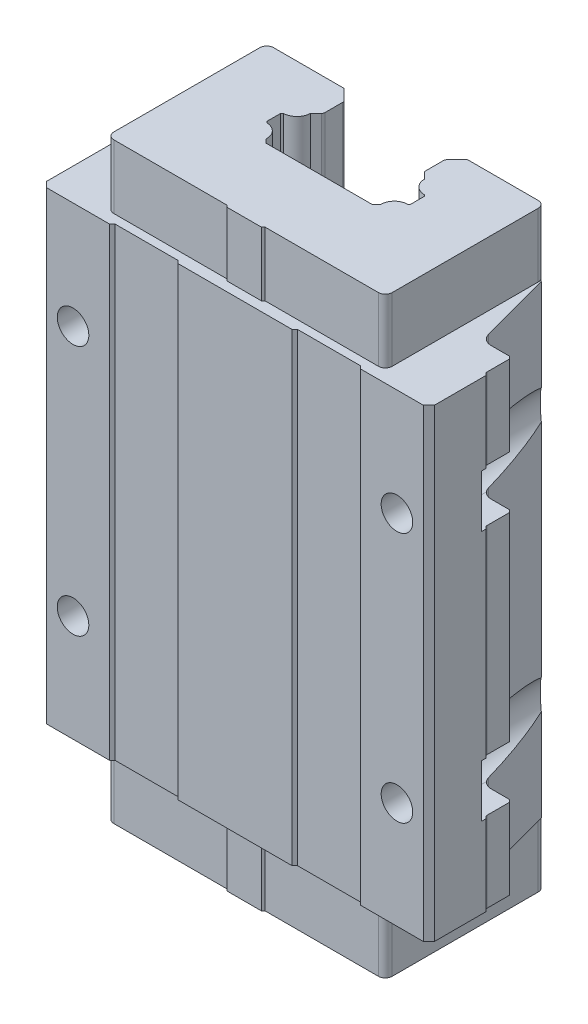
ISO-10303-21;
HEADER;
FILE_DESCRIPTION(('STEP AP214'),'2;1');
FILE_NAME('part.step','',(''),(''),'','','');
FILE_SCHEMA(('AUTOMOTIVE_DESIGN { 1 0 10303 214 1 1 1 1 }'));
ENDSEC;
DATA;
#1=APPLICATION_CONTEXT('core data for automotive mechanical design processes');
#2=APPLICATION_PROTOCOL_DEFINITION('international standard','automotive_design',2000,#1);
#3=PRODUCT_CONTEXT('',#1,'mechanical');
#4=PRODUCT('Part','Part','',(#3));
#5=PRODUCT_RELATED_PRODUCT_CATEGORY('part','',(#4));
#6=PRODUCT_DEFINITION_FORMATION('','',#4);
#7=PRODUCT_DEFINITION_CONTEXT('part definition',#1,'design');
#8=PRODUCT_DEFINITION('design','',#6,#7);
#9=PRODUCT_DEFINITION_SHAPE('','',#8);
#10=(LENGTH_UNIT() NAMED_UNIT(*) SI_UNIT(.MILLI.,.METRE.));
#11=(NAMED_UNIT(*) PLANE_ANGLE_UNIT() SI_UNIT($,.RADIAN.));
#12=(NAMED_UNIT(*) SI_UNIT($,.STERADIAN.) SOLID_ANGLE_UNIT());
#13=UNCERTAINTY_MEASURE_WITH_UNIT(LENGTH_MEASURE(1.E-05),#10,'distance_accuracy_value','');
#14=(GEOMETRIC_REPRESENTATION_CONTEXT(3) GLOBAL_UNCERTAINTY_ASSIGNED_CONTEXT((#13)) GLOBAL_UNIT_ASSIGNED_CONTEXT((#10,
#11,#12)) REPRESENTATION_CONTEXT('',''));
#15=CARTESIAN_POINT('',(0.,0.,0.));
#16=DIRECTION('',(0.,0.,1.));
#17=DIRECTION('',(1.,0.,0.));
#18=AXIS2_PLACEMENT_3D('',#15,#16,#17);
#19=CARTESIAN_POINT('',(-84.0021650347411,-302.411904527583,-37.5));
#20=DIRECTION('',(0.,0.,1.));
#21=DIRECTION('',(1.,0.,0.));
#22=AXIS2_PLACEMENT_3D('',#19,#20,#21);
#23=PLANE('',#22);
#24=DIRECTION('',(1.,0.,0.));
#25=VECTOR('',#24,1.);
#26=CARTESIAN_POINT('',(-84.0021650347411,66.5,-37.5));
#27=LINE('',#26,#25);
#28=CARTESIAN_POINT('',(-84.0021650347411,66.5,-37.5));
#29=VERTEX_POINT('',#28);
#30=CARTESIAN_POINT('',(-74.8250979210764,66.5,-37.5));
#31=VERTEX_POINT('',#30);
#32=EDGE_CURVE('E40',#29,#31,#27,.T.);
#33=ORIENTED_EDGE('',*,*,#32,.F.);
#34=DIRECTION('',(0.,1.,0.));
#35=VECTOR('',#34,1.);
#36=CARTESIAN_POINT('',(-84.0021650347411,-302.411904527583,-37.5));
#37=LINE('',#36,#35);
#38=CARTESIAN_POINT('',(-84.0021650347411,101.8,-37.5));
#39=VERTEX_POINT('',#38);
#40=EDGE_CURVE('E10',#29,#39,#37,.T.);
#41=ORIENTED_EDGE('',*,*,#40,.T.);
#42=DIRECTION('',(-1.,0.,0.));
#43=VECTOR('',#42,1.);
#44=CARTESIAN_POINT('',(0.,101.8,-37.5));
#45=LINE('',#44,#43);
#46=CARTESIAN_POINT('',(-74.8250979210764,101.8,-37.5));
#47=VERTEX_POINT('',#46);
#48=EDGE_CURVE('E1793',#47,#39,#45,.T.);
#49=ORIENTED_EDGE('',*,*,#48,.F.);
#50=DIRECTION('',(0.,1.,0.));
#51=VECTOR('',#50,1.);
#52=CARTESIAN_POINT('',(-74.8250979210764,-302.411904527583,-37.5));
#53=LINE('',#52,#51);
#54=EDGE_CURVE('E1803',#31,#47,#53,.T.);
#55=ORIENTED_EDGE('',*,*,#54,.F.);
#56=EDGE_LOOP('',(#33,#41,#49,#55));
#57=FACE_BOUND('',#56,.T.);
#58=ADVANCED_FACE('F16',(#57),#23,.F.);
#59=CARTESIAN_POINT('',(-84.0021650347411,-302.411904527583,-37.5));
#60=DIRECTION('',(0.,0.,1.));
#61=DIRECTION('',(1.,0.,0.));
#62=AXIS2_PLACEMENT_3D('',#59,#60,#61);
#63=PLANE('',#62);
#64=DIRECTION('',(-1.,0.,0.));
#65=VECTOR('',#64,1.);
#66=CARTESIAN_POINT('',(-84.0021650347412,43.4999999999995,-37.5));
#67=LINE('',#66,#65);
#68=CARTESIAN_POINT('',(-74.8250979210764,43.4999999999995,-37.5));
#69=VERTEX_POINT('',#68);
#70=CARTESIAN_POINT('',(-84.0021650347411,43.4999999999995,-37.5));
#71=VERTEX_POINT('',#70);
#72=EDGE_CURVE('E1625',#69,#71,#67,.T.);
#73=ORIENTED_EDGE('',*,*,#72,.F.);
#74=DIRECTION('',(0.,1.,0.));
#75=VECTOR('',#74,1.);
#76=CARTESIAN_POINT('',(-74.8250979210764,-302.411904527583,-37.5));
#77=LINE('',#76,#75);
#78=CARTESIAN_POINT('',(-74.8250979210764,-43.4999999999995,-37.5));
#79=VERTEX_POINT('',#78);
#80=EDGE_CURVE('E1425',#79,#69,#77,.T.);
#81=ORIENTED_EDGE('',*,*,#80,.F.);
#82=DIRECTION('',(-1.,0.,0.));
#83=VECTOR('',#82,1.);
#84=CARTESIAN_POINT('',(-84.002165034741,-43.4999999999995,-37.5));
#85=LINE('',#84,#83);
#86=CARTESIAN_POINT('',(-84.0021650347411,-43.4999999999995,-37.5));
#87=VERTEX_POINT('',#86);
#88=EDGE_CURVE('E27',#79,#87,#85,.T.);
#89=ORIENTED_EDGE('',*,*,#88,.T.);
#90=DIRECTION('',(0.,1.,0.));
#91=VECTOR('',#90,1.);
#92=CARTESIAN_POINT('',(-84.0021650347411,-302.411904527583,-37.5));
#93=LINE('',#92,#91);
#94=EDGE_CURVE('E1469',#87,#71,#93,.T.);
#95=ORIENTED_EDGE('',*,*,#94,.T.);
#96=EDGE_LOOP('',(#73,#81,#89,#95));
#97=FACE_BOUND('',#96,.T.);
#98=ADVANCED_FACE('F2605',(#97),#63,.F.);
#99=CARTESIAN_POINT('',(-85.0021650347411,-302.411904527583,-36.5));
#100=DIRECTION('',(0.707106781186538,0.,0.707106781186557));
#101=DIRECTION('',(0.,-1.,0.));
#102=AXIS2_PLACEMENT_3D('',#99,#100,#101);
#103=PLANE('',#102);
#104=DIRECTION('',(0.707106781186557,0.,-0.707106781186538));
#105=VECTOR('',#104,1.);
#106=CARTESIAN_POINT('',(-85.0021650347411,66.5,-36.5));
#107=LINE('',#106,#105);
#108=CARTESIAN_POINT('',(-85.0021650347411,66.5,-36.5));
#109=VERTEX_POINT('',#108);
#110=EDGE_CURVE('E1447',#109,#29,#107,.T.);
#111=ORIENTED_EDGE('',*,*,#110,.F.);
#112=DIRECTION('',(0.,1.,0.));
#113=VECTOR('',#112,1.);
#114=CARTESIAN_POINT('',(-85.0021650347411,-302.411904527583,-36.5));
#115=LINE('',#114,#113);
#116=CARTESIAN_POINT('',(-85.0021650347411,101.8,-36.5));
#117=VERTEX_POINT('',#116);
#118=EDGE_CURVE('E1846',#109,#117,#115,.T.);
#119=ORIENTED_EDGE('',*,*,#118,.T.);
#120=DIRECTION('',(-0.707106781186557,0.,0.707106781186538));
#121=VECTOR('',#120,1.);
#122=CARTESIAN_POINT('',(-60.7510825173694,101.8,-60.751082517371));
#123=LINE('',#122,#121);
#124=EDGE_CURVE('E1817',#39,#117,#123,.T.);
#125=ORIENTED_EDGE('',*,*,#124,.F.);
#126=ORIENTED_EDGE('',*,*,#40,.F.);
#127=EDGE_LOOP('',(#111,#119,#125,#126));
#128=FACE_BOUND('',#127,.T.);
#129=ADVANCED_FACE('F2836',(#128),#103,.F.);
#130=CARTESIAN_POINT('',(-85.0021650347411,-302.411904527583,-36.5));
#131=DIRECTION('',(0.707106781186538,0.,0.707106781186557));
#132=DIRECTION('',(0.,-1.,0.));
#133=AXIS2_PLACEMENT_3D('',#130,#131,#132);
#134=PLANE('',#133);
#135=DIRECTION('',(-0.707106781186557,0.,0.707106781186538));
#136=VECTOR('',#135,1.);
#137=CARTESIAN_POINT('',(-85.0021650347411,43.4999999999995,-36.5));
#138=LINE('',#137,#136);
#139=CARTESIAN_POINT('',(-85.0021650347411,43.4999999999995,-36.5));
#140=VERTEX_POINT('',#139);
#141=EDGE_CURVE('E1453',#71,#140,#138,.T.);
#142=ORIENTED_EDGE('',*,*,#141,.F.);
#143=ORIENTED_EDGE('',*,*,#94,.F.);
#144=DIRECTION('',(-0.707106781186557,0.,0.707106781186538));
#145=VECTOR('',#144,1.);
#146=CARTESIAN_POINT('',(-85.0021650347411,-43.4999999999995,-36.5));
#147=LINE('',#146,#145);
#148=CARTESIAN_POINT('',(-85.0021650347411,-43.4999999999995,-36.5));
#149=VERTEX_POINT('',#148);
#150=EDGE_CURVE('E1850',#87,#149,#147,.T.);
#151=ORIENTED_EDGE('',*,*,#150,.T.);
#152=DIRECTION('',(0.,1.,0.));
#153=VECTOR('',#152,1.);
#154=CARTESIAN_POINT('',(-85.0021650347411,-302.411904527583,-36.5));
#155=LINE('',#154,#153);
#156=EDGE_CURVE('E1807',#149,#140,#155,.T.);
#157=ORIENTED_EDGE('',*,*,#156,.T.);
#158=EDGE_LOOP('',(#142,#143,#151,#157));
#159=FACE_BOUND('',#158,.T.);
#160=ADVANCED_FACE('F2562',(#159),#134,.F.);
#161=CARTESIAN_POINT('',(-74.8250979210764,-302.411904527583,-42.5));
#162=DIRECTION('',(0.,1.,0.));
#163=DIRECTION('',(0.,0.,1.));
#164=AXIS2_PLACEMENT_3D('',#161,#162,#163);
#165=CYLINDRICAL_SURFACE('',#164,5.);
#166=CARTESIAN_POINT('',(-74.8250979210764,66.5,-42.5));
#167=DIRECTION('',(0.,1.,0.));
#168=DIRECTION('',(0.,0.,-1.));
#169=AXIS2_PLACEMENT_3D('',#166,#167,#168);
#170=CIRCLE('',#169,5.);
#171=CARTESIAN_POINT('',(-71.,66.5,-39.2799649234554));
#172=VERTEX_POINT('',#171);
#173=EDGE_CURVE('E1660',#31,#172,#170,.T.);
#174=ORIENTED_EDGE('',*,*,#173,.F.);
#175=ORIENTED_EDGE('',*,*,#54,.T.);
#176=CARTESIAN_POINT('',(-74.8250979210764,101.8,-42.5));
#177=DIRECTION('',(0.,-1.,0.));
#178=DIRECTION('',(0.,0.,1.));
#179=AXIS2_PLACEMENT_3D('',#176,#177,#178);
#180=CIRCLE('',#179,5.);
#181=CARTESIAN_POINT('',(-69.995468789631,101.8,-41.2059047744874));
#182=VERTEX_POINT('',#181);
#183=EDGE_CURVE('E1788',#182,#47,#180,.T.);
#184=ORIENTED_EDGE('',*,*,#183,.F.);
#185=DIRECTION('',(0.,1.,0.));
#186=VECTOR('',#185,1.);
#187=CARTESIAN_POINT('',(-69.995468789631,-302.411904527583,-41.2059047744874));
#188=LINE('',#187,#186);
#189=CARTESIAN_POINT('',(-69.995468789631,66.456042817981,-41.2059047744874));
#190=VERTEX_POINT('',#189);
#191=EDGE_CURVE('E1430',#190,#182,#188,.T.);
#192=ORIENTED_EDGE('',*,*,#191,.F.);
#193=CARTESIAN_POINT('',(-71.,66.5000000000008,-39.2799649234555));
#194=CARTESIAN_POINT('',(-70.9410050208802,66.4999999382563,-39.350028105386));
#195=CARTESIAN_POINT('',(-70.8839063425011,66.4995459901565,-39.421690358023));
#196=CARTESIAN_POINT('',(-70.7739580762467,66.4979091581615,-39.5676992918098));
#197=CARTESIAN_POINT('',(-70.7210908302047,66.4967295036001,-39.642032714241));
#198=CARTESIAN_POINT('',(-70.6196104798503,66.4938191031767,-39.793383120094));
#199=CARTESIAN_POINT('',(-70.5709913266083,66.4920891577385,-39.8703960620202));
#200=CARTESIAN_POINT('',(-70.4779947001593,66.4882409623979,-40.0270934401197));
#201=CARTESIAN_POINT('',(-70.4336239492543,66.486122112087,-40.1067818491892));
#202=CARTESIAN_POINT('',(-70.3492974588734,66.4816535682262,-40.268467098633));
#203=CARTESIAN_POINT('',(-70.3093422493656,66.4793038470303,-40.3504642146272));
#204=CARTESIAN_POINT('',(-70.2340713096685,66.4745271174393,-40.5163981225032));
#205=CARTESIAN_POINT('',(-70.198748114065,66.472100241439,-40.600331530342));
#206=CARTESIAN_POINT('',(-70.1327255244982,66.4672986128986,-40.7701309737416));
#207=CARTESIAN_POINT('',(-70.1020325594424,66.4649239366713,-40.8559995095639));
#208=CARTESIAN_POINT('',(-70.0452374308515,66.4603326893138,-41.0296619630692));
#209=CARTESIAN_POINT('',(-70.0191559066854,66.4581168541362,-41.1174626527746));
#210=CARTESIAN_POINT('',(-69.995468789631,66.456042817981,-41.2059047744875));
#211=B_SPLINE_CURVE_WITH_KNOTS('',3,(#193,#194,#195,#196,#197,#198,#199,#200,#201,#202,#203,
#204,#205,#206,#207,#208,#209,#210),.UNSPECIFIED.,.F.,.F.,(4,2,2,2,2,2,2,2,4),(0.,
0.274746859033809,0.54827987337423,0.821416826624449,1.0949790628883,1.36857409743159,
1.64172261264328,1.91524696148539,2.18996612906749),.UNSPECIFIED.);
#212=EDGE_CURVE('E1448',#172,#190,#211,.T.);
#213=ORIENTED_EDGE('',*,*,#212,.F.);
#214=EDGE_LOOP('',(#174,#175,#184,#192,#213));
#215=FACE_BOUND('',#214,.T.);
#216=ADVANCED_FACE('F1595',(#215),#165,.F.);
#217=CARTESIAN_POINT('',(-74.8250979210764,-302.411904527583,-42.5));
#218=DIRECTION('',(0.,1.,0.));
#219=DIRECTION('',(0.,0.,1.));
#220=AXIS2_PLACEMENT_3D('',#217,#218,#219);
#221=CYLINDRICAL_SURFACE('',#220,5.);
#222=CARTESIAN_POINT('',(-69.995468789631,43.543957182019,-41.2059047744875));
#223=CARTESIAN_POINT('',(-70.0191533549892,43.5418833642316,-41.1174723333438));
#224=CARTESIAN_POINT('',(-70.0452327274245,43.5396677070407,-41.0296814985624));
#225=CARTESIAN_POINT('',(-70.1020257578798,43.5350765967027,-40.8560308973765));
#226=CARTESIAN_POINT('',(-70.1327191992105,43.5327018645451,-40.7701644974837));
#227=CARTESIAN_POINT('',(-70.198745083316,43.5278999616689,-40.6003615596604));
#228=CARTESIAN_POINT('',(-70.2340715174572,43.5254728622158,-40.5164226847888));
#229=CARTESIAN_POINT('',(-70.3093505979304,43.5206956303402,-40.3504696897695));
#230=CARTESIAN_POINT('',(-70.3493111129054,43.5183456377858,-40.2684591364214));
#231=CARTESIAN_POINT('',(-70.4336393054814,43.5138771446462,-40.106765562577));
#232=CARTESIAN_POINT('',(-70.4780054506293,43.5117585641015,-40.0270817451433));
#233=CARTESIAN_POINT('',(-70.5709950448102,43.5079107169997,-39.8703917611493));
#234=CARTESIAN_POINT('',(-70.6196118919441,43.5061808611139,-39.7933816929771));
#235=CARTESIAN_POINT('',(-70.7210891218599,43.5032705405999,-39.6420348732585));
#236=CARTESIAN_POINT('',(-70.7739556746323,43.5020908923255,-39.567702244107));
#237=CARTESIAN_POINT('',(-70.8839041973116,43.5004540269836,-39.4216927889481));
#238=CARTESIAN_POINT('',(-70.9410039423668,43.500000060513,-39.3500293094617));
#239=CARTESIAN_POINT('',(-71.,43.4999999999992,-39.2799649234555));
#240=B_SPLINE_CURVE_WITH_KNOTS('',3,(#222,#223,#224,#225,#226,#227,#228,#229,#230,#231,#232,
#233,#234,#235,#236,#237,#238,#239),.UNSPECIFIED.,.F.,.F.,(4,2,2,2,2,2,2,2,4),(0.,
0.274689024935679,0.548207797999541,0.821375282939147,1.09501359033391,1.36855704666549,
1.64168295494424,1.91521282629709,2.18996453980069),.UNSPECIFIED.);
#241=CARTESIAN_POINT('',(-69.995468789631,43.5439571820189,-41.2059047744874));
#242=VERTEX_POINT('',#241);
#243=CARTESIAN_POINT('',(-71.,43.4999999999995,-39.2799649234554));
#244=VERTEX_POINT('',#243);
#245=EDGE_CURVE('E1617',#242,#244,#240,.T.);
#246=ORIENTED_EDGE('',*,*,#245,.F.);
#247=DIRECTION('',(0.,1.,0.));
#248=VECTOR('',#247,1.);
#249=CARTESIAN_POINT('',(-69.995468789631,-302.411904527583,-41.2059047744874));
#250=LINE('',#249,#248);
#251=CARTESIAN_POINT('',(-69.995468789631,-43.543957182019,-41.2059047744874));
#252=VERTEX_POINT('',#251);
#253=EDGE_CURVE('E2541',#252,#242,#250,.T.);
#254=ORIENTED_EDGE('',*,*,#253,.F.);
#255=CARTESIAN_POINT('',(-69.995468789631,-43.543957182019,-41.2059047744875));
#256=CARTESIAN_POINT('',(-70.0190782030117,-43.5418957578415,-41.1177830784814));
#257=CARTESIAN_POINT('',(-70.0451038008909,-43.5397502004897,-41.0303111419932));
#258=CARTESIAN_POINT('',(-70.1018990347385,-43.5353177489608,-40.8569211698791));
#259=CARTESIAN_POINT('',(-70.1326688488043,-43.5330308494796,-40.771003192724));
#260=CARTESIAN_POINT('',(-70.1988637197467,-43.5283427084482,-40.6009787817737));
#261=CARTESIAN_POINT('',(-70.234288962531,-43.5259414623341,-40.516872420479));
#262=CARTESIAN_POINT('',(-70.3096859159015,-43.5208896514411,-40.3507263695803));
#263=CARTESIAN_POINT('',(-70.3496578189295,-43.5182390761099,-40.2686867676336));
#264=CARTESIAN_POINT('',(-70.4338437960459,-43.5132130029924,-40.1072745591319));
#265=CARTESIAN_POINT('',(-70.478037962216,-43.5108363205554,-40.0278916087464));
#266=CARTESIAN_POINT('',(-70.570828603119,-43.5068433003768,-39.8714089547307));
#267=CARTESIAN_POINT('',(-70.6194375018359,-43.505229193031,-39.7943165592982));
#268=CARTESIAN_POINT('',(-70.7209501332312,-43.5026271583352,-39.6426727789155));
#269=CARTESIAN_POINT('',(-70.7738661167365,-43.5016410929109,-39.5681295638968));
#270=CARTESIAN_POINT('',(-70.8838690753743,-43.5003219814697,-39.4218310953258));
#271=CARTESIAN_POINT('',(-70.9409680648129,-43.4999908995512,-39.3500848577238));
#272=CARTESIAN_POINT('',(-71.,-43.499999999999,-39.2799649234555));
#273=B_SPLINE_CURVE_WITH_KNOTS('',3,(#255,#256,#257,#258,#259,#260,#261,#262,#263,#264,#265,
#266,#267,#268,#269,#270,#271,#272),.UNSPECIFIED.,.F.,.F.,(4,2,2,2,2,2,2,2,4),(0.,
0.273723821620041,0.547457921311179,0.821202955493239,1.09495958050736,1.36748378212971,
1.64080020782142,1.91492319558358,2.18986695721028),.UNSPECIFIED.);
#274=CARTESIAN_POINT('',(-71.,-43.4999999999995,-39.2799649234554));
#275=VERTEX_POINT('',#274);
#276=EDGE_CURVE('E1577',#252,#275,#273,.T.);
#277=ORIENTED_EDGE('',*,*,#276,.T.);
#278=CARTESIAN_POINT('',(-74.8250979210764,-43.4999999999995,-42.5));
#279=DIRECTION('',(0.,-1.,0.));
#280=DIRECTION('',(-1.,0.,0.));
#281=AXIS2_PLACEMENT_3D('',#278,#279,#280);
#282=CIRCLE('',#281,5.);
#283=EDGE_CURVE('E1429',#275,#79,#282,.T.);
#284=ORIENTED_EDGE('',*,*,#283,.T.);
#285=ORIENTED_EDGE('',*,*,#80,.T.);
#286=CARTESIAN_POINT('',(-74.8250979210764,43.4999999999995,-42.5));
#287=DIRECTION('',(0.,-1.,0.));
#288=DIRECTION('',(-1.,0.,0.));
#289=AXIS2_PLACEMENT_3D('',#286,#287,#288);
#290=CIRCLE('',#289,5.);
#291=EDGE_CURVE('E1620',#244,#69,#290,.T.);
#292=ORIENTED_EDGE('',*,*,#291,.F.);
#293=EDGE_LOOP('',(#246,#254,#277,#284,#285,#292));
#294=FACE_BOUND('',#293,.T.);
#295=ADVANCED_FACE('F1584',(#294),#221,.F.);
#296=CARTESIAN_POINT('',(-69.995468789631,-302.411904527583,-41.2059047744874));
#297=DIRECTION('',(0.965925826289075,0.,0.258819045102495));
#298=DIRECTION('',(0.,-1.,0.));
#299=AXIS2_PLACEMENT_3D('',#296,#297,#298);
#300=PLANE('',#299);
#301=CARTESIAN_POINT('',(-71.,55.,-37.4569432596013));
#302=DIRECTION('',(-0.965925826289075,0.,-0.258819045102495));
#303=DIRECTION('',(-0.258819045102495,0.,0.965925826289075));
#304=AXIS2_PLACEMENT_3D('',#301,#302,#303);
#305=ELLIPSE('',#304,44.4325880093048,11.5000000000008);
#306=CARTESIAN_POINT('',(-61.5356253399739,61.532657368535,-72.77847035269));
#307=VERTEX_POINT('',#306);
#308=EDGE_CURVE('E1682',#190,#307,#305,.T.);
#309=ORIENTED_EDGE('',*,*,#308,.F.);
#310=ORIENTED_EDGE('',*,*,#191,.T.);
#311=DIRECTION('',(-0.258819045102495,0.,0.965925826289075));
#312=VECTOR('',#311,1.);
#313=CARTESIAN_POINT('',(-75.608137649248,101.8,-20.259139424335));
#314=LINE('',#313,#312);
#315=CARTESIAN_POINT('',(-61.5356253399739,101.8,-72.77847035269));
#316=VERTEX_POINT('',#315);
#317=EDGE_CURVE('E1792',#316,#182,#314,.T.);
#318=ORIENTED_EDGE('',*,*,#317,.F.);
#319=DIRECTION('',(0.,1.,0.));
#320=VECTOR('',#319,1.);
#321=CARTESIAN_POINT('',(-61.5356253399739,-302.411904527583,-72.77847035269));
#322=LINE('',#321,#320);
#323=EDGE_CURVE('E2008',#307,#316,#322,.T.);
#324=ORIENTED_EDGE('',*,*,#323,.F.);
#325=EDGE_LOOP('',(#309,#310,#318,#324));
#326=FACE_BOUND('',#325,.T.);
#327=ADVANCED_FACE('F1594',(#326),#300,.F.);
#328=CARTESIAN_POINT('',(-85.0021650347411,-302.411904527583,-36.5));
#329=DIRECTION('',(1.,0.,0.));
#330=DIRECTION('',(0.,1.,0.));
#331=AXIS2_PLACEMENT_3D('',#328,#329,#330);
#332=PLANE('',#331);
#333=DIRECTION('',(0.,0.,-1.));
#334=VECTOR('',#333,1.);
#335=CARTESIAN_POINT('',(-85.0021650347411,66.5,-36.5));
#336=LINE('',#335,#334);
#337=CARTESIAN_POINT('',(-85.0021650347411,66.5,-23.));
#338=VERTEX_POINT('',#337);
#339=EDGE_CURVE('E1661',#338,#109,#336,.T.);
#340=ORIENTED_EDGE('',*,*,#339,.F.);
#341=DIRECTION('',(0.,1.,0.));
#342=VECTOR('',#341,1.);
#343=CARTESIAN_POINT('',(-85.0021650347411,-302.411904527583,-23.));
#344=LINE('',#343,#342);
#345=CARTESIAN_POINT('',(-85.0021650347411,43.5,-23.));
#346=VERTEX_POINT('',#345);
#347=EDGE_CURVE('E1454',#346,#338,#344,.T.);
#348=ORIENTED_EDGE('',*,*,#347,.F.);
#349=DIRECTION('',(0.,0.,1.));
#350=VECTOR('',#349,1.);
#351=CARTESIAN_POINT('',(-85.0021650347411,43.4999999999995,-36.5));
#352=LINE('',#351,#350);
#353=EDGE_CURVE('E1449',#140,#346,#352,.T.);
#354=ORIENTED_EDGE('',*,*,#353,.F.);
#355=ORIENTED_EDGE('',*,*,#156,.F.);
#356=DIRECTION('',(0.,0.,1.));
#357=VECTOR('',#356,1.);
#358=CARTESIAN_POINT('',(-85.0021650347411,-43.4999999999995,-36.5));
#359=LINE('',#358,#357);
#360=CARTESIAN_POINT('',(-85.0021650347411,-43.5,-23.));
#361=VERTEX_POINT('',#360);
#362=EDGE_CURVE('E1487',#149,#361,#359,.T.);
#363=ORIENTED_EDGE('',*,*,#362,.T.);
#364=DIRECTION('',(0.,-1.,0.));
#365=VECTOR('',#364,1.);
#366=CARTESIAN_POINT('',(-85.0021650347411,-302.411904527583,-23.));
#367=LINE('',#366,#365);
#368=CARTESIAN_POINT('',(-85.0021650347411,-66.5,-23.));
#369=VERTEX_POINT('',#368);
#370=EDGE_CURVE('E1491',#361,#369,#367,.T.);
#371=ORIENTED_EDGE('',*,*,#370,.T.);
#372=DIRECTION('',(0.,0.,-1.));
#373=VECTOR('',#372,1.);
#374=CARTESIAN_POINT('',(-85.0021650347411,-66.5,-36.5));
#375=LINE('',#374,#373);
#376=CARTESIAN_POINT('',(-85.0021650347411,-66.5,-36.5));
#377=VERTEX_POINT('',#376);
#378=EDGE_CURVE('E2138',#369,#377,#375,.T.);
#379=ORIENTED_EDGE('',*,*,#378,.T.);
#380=DIRECTION('',(0.,1.,0.));
#381=VECTOR('',#380,1.);
#382=CARTESIAN_POINT('',(-85.0021650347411,-302.411904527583,-36.5));
#383=LINE('',#382,#381);
#384=CARTESIAN_POINT('',(-85.0021650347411,-101.8,-36.5));
#385=VERTEX_POINT('',#384);
#386=EDGE_CURVE('E1102',#385,#377,#383,.T.);
#387=ORIENTED_EDGE('',*,*,#386,.F.);
#388=DIRECTION('',(0.,0.,-1.));
#389=VECTOR('',#388,1.);
#390=CARTESIAN_POINT('',(-85.0021650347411,-101.8,0.));
#391=LINE('',#390,#389);
#392=CARTESIAN_POINT('',(-85.0021650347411,-101.8,-2.4500235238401));
#393=VERTEX_POINT('',#392);
#394=EDGE_CURVE('E1238',#393,#385,#391,.T.);
#395=ORIENTED_EDGE('',*,*,#394,.F.);
#396=DIRECTION('',(0.,1.,0.));
#397=VECTOR('',#396,1.);
#398=CARTESIAN_POINT('',(-85.0021650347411,-302.411904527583,-2.4500235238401));
#399=LINE('',#398,#397);
#400=CARTESIAN_POINT('',(-85.0021650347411,101.8,-2.4500235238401));
#401=VERTEX_POINT('',#400);
#402=EDGE_CURVE('E2146',#393,#401,#399,.T.);
#403=ORIENTED_EDGE('',*,*,#402,.T.);
#404=DIRECTION('',(0.,0.,1.));
#405=VECTOR('',#404,1.);
#406=CARTESIAN_POINT('',(-85.0021650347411,101.8,0.));
#407=LINE('',#406,#405);
#408=EDGE_CURVE('E1276',#117,#401,#407,.T.);
#409=ORIENTED_EDGE('',*,*,#408,.F.);
#410=ORIENTED_EDGE('',*,*,#118,.F.);
#411=EDGE_LOOP('',(#340,#348,#354,#355,#363,#371,#379,#387,#395,#403,#409,#410));
#412=FACE_BOUND('',#411,.T.);
#413=ADVANCED_FACE('F2792',(#412),#332,.F.);
#414=CARTESIAN_POINT('',(-71.,55.,0.));
#415=DIRECTION('',(0.,0.,-1.));
#416=DIRECTION('',(0.,-1.,0.));
#417=AXIS2_PLACEMENT_3D('',#414,#415,#416);
#418=CYLINDRICAL_SURFACE('',#417,6.9175);
#419=CARTESIAN_POINT('',(-71.,55.,0.));
#420=DIRECTION('',(0.,0.,-1.));
#421=DIRECTION('',(0.,-1.,0.));
#422=AXIS2_PLACEMENT_3D('',#419,#420,#421);
#423=CIRCLE('',#422,6.9175);
#424=CARTESIAN_POINT('',(-71.,48.0825,0.));
#425=VERTEX_POINT('',#424);
#426=EDGE_CURVE('E1111',#425,#425,#423,.T.);
#427=ORIENTED_EDGE('',*,*,#426,.F.);
#428=EDGE_LOOP('',(#427));
#429=FACE_BOUND('',#428,.T.);
#430=CARTESIAN_POINT('',(-71.,55.,-23.));
#431=DIRECTION('',(0.,0.,1.));
#432=DIRECTION('',(-1.,0.,0.));
#433=AXIS2_PLACEMENT_3D('',#430,#431,#432);
#434=CIRCLE('',#433,6.9175);
#435=CARTESIAN_POINT('',(-77.9175,55.,-23.));
#436=VERTEX_POINT('',#435);
#437=EDGE_CURVE('E1369',#436,#436,#434,.T.);
#438=ORIENTED_EDGE('',*,*,#437,.F.);
#439=EDGE_LOOP('',(#438));
#440=FACE_BOUND('',#439,.T.);
#441=ADVANCED_FACE('F2795',(#429,#440),#418,.F.);
#442=CARTESIAN_POINT('',(-69.995468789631,-302.411904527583,-41.2059047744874));
#443=DIRECTION('',(0.965925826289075,0.,0.258819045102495));
#444=DIRECTION('',(0.,-1.,0.));
#445=AXIS2_PLACEMENT_3D('',#442,#443,#444);
#446=PLANE('',#445);
#447=DIRECTION('',(0.,1.,0.));
#448=VECTOR('',#447,1.);
#449=CARTESIAN_POINT('',(-69.995468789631,-302.411904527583,-41.2059047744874));
#450=LINE('',#449,#448);
#451=CARTESIAN_POINT('',(-69.995468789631,-101.8,-41.2059047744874));
#452=VERTEX_POINT('',#451);
#453=CARTESIAN_POINT('',(-69.995468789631,-66.456042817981,-41.2059047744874));
#454=VERTEX_POINT('',#453);
#455=EDGE_CURVE('E2204',#452,#454,#450,.T.);
#456=ORIENTED_EDGE('',*,*,#455,.T.);
#457=CARTESIAN_POINT('',(-71.,-55.,-37.4569432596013));
#458=DIRECTION('',(0.965925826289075,0.,0.258819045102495));
#459=DIRECTION('',(-0.258819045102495,0.,0.965925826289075));
#460=AXIS2_PLACEMENT_3D('',#457,#458,#459);
#461=ELLIPSE('',#460,44.4325880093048,11.5000000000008);
#462=CARTESIAN_POINT('',(-61.5356253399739,-61.5326573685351,-72.77847035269));
#463=VERTEX_POINT('',#462);
#464=EDGE_CURVE('E2523',#454,#463,#461,.T.);
#465=ORIENTED_EDGE('',*,*,#464,.T.);
#466=DIRECTION('',(0.,1.,0.));
#467=VECTOR('',#466,1.);
#468=CARTESIAN_POINT('',(-61.5356253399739,-302.411904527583,-72.77847035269));
#469=LINE('',#468,#467);
#470=CARTESIAN_POINT('',(-61.5356253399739,-101.8,-72.77847035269));
#471=VERTEX_POINT('',#470);
#472=EDGE_CURVE('E1459',#471,#463,#469,.T.);
#473=ORIENTED_EDGE('',*,*,#472,.F.);
#474=DIRECTION('',(0.258819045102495,0.,-0.965925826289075));
#475=VECTOR('',#474,1.);
#476=CARTESIAN_POINT('',(-75.608137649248,-101.8,-20.259139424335));
#477=LINE('',#476,#475);
#478=EDGE_CURVE('E1110',#452,#471,#477,.T.);
#479=ORIENTED_EDGE('',*,*,#478,.F.);
#480=EDGE_LOOP('',(#456,#465,#473,#479));
#481=FACE_BOUND('',#480,.T.);
#482=ADVANCED_FACE('F2447',(#481),#446,.F.);
#483=CARTESIAN_POINT('',(74.8007678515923,-302.411904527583,-42.5));
#484=DIRECTION('',(0.,1.,0.));
#485=DIRECTION('',(0.,0.,1.));
#486=AXIS2_PLACEMENT_3D('',#483,#484,#485);
#487=CYLINDRICAL_SURFACE('',#486,5.);
#488=CARTESIAN_POINT('',(69.9711387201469,-43.5461166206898,-41.2059047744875));
#489=CARTESIAN_POINT('',(69.9952261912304,-43.5439561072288,-41.1159657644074));
#490=CARTESIAN_POINT('',(70.0217919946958,-43.5416433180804,-41.0266909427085));
#491=CARTESIAN_POINT('',(70.0797196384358,-43.536844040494,-40.8501353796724));
#492=CARTESIAN_POINT('',(70.1110606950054,-43.534358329,-40.7628477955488));
#493=CARTESIAN_POINT('',(70.1785439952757,-43.5293266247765,-40.5902654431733));
#494=CARTESIAN_POINT('',(70.2146806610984,-43.5267807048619,-40.5049684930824));
#495=CARTESIAN_POINT('',(70.2917416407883,-43.5217656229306,-40.3363618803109));
#496=CARTESIAN_POINT('',(70.3326751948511,-43.5192966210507,-40.2530564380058));
#497=CARTESIAN_POINT('',(70.4190900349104,-43.5145998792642,-40.0888703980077));
#498=CARTESIAN_POINT('',(70.4645696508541,-43.5123720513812,-40.0079889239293));
#499=CARTESIAN_POINT('',(70.5599124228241,-43.5083249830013,-39.8490330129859));
#500=CARTESIAN_POINT('',(70.6097677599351,-43.5065050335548,-39.770953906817));
#501=CARTESIAN_POINT('',(70.7138472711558,-43.5034426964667,-39.6175981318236));
#502=CARTESIAN_POINT('',(70.7680772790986,-43.5022010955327,-39.54232540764));
#503=CARTESIAN_POINT('',(70.8808760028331,-43.5004780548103,-39.3945635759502));
#504=CARTESIAN_POINT('',(70.9394629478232,-43.5000000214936,-39.3220883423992));
#505=CARTESIAN_POINT('',(71.,-43.4999999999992,-39.2512827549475));
#506=B_SPLINE_CURVE_WITH_KNOTS('',3,(#488,#489,#490,#491,#492,#493,#494,#495,#496,#497,#498,
#499,#500,#501,#502,#503,#504,#505),.UNSPECIFIED.,.F.,.F.,(4,2,2,2,2,2,2,2,4),(0.,
0.279370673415,0.557558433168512,0.835425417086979,1.11383673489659,1.39214614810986,
1.6699680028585,1.94816667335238,2.2276030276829),.UNSPECIFIED.);
#507=CARTESIAN_POINT('',(69.9711387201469,-43.5461166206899,-41.2059047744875));
#508=VERTEX_POINT('',#507);
#509=CARTESIAN_POINT('',(71.,-43.4999999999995,-39.2512827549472));
#510=VERTEX_POINT('',#509);
#511=EDGE_CURVE('E2058',#508,#510,#506,.T.);
#512=ORIENTED_EDGE('',*,*,#511,.F.);
#513=DIRECTION('',(0.,1.,0.));
#514=VECTOR('',#513,1.);
#515=CARTESIAN_POINT('',(69.9711387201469,-302.411904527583,-41.2059047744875));
#516=LINE('',#515,#514);
#517=CARTESIAN_POINT('',(69.9711387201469,43.5461166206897,-41.2059047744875));
#518=VERTEX_POINT('',#517);
#519=EDGE_CURVE('E2529',#508,#518,#516,.T.);
#520=ORIENTED_EDGE('',*,*,#519,.T.);
#521=CARTESIAN_POINT('',(69.9711387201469,43.54611662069,-41.2059047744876));
#522=CARTESIAN_POINT('',(69.9951535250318,43.5439687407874,-41.1162694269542));
#523=CARTESIAN_POINT('',(70.0216683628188,43.5417297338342,-41.0273065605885));
#524=CARTESIAN_POINT('',(70.0796048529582,43.5370979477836,-40.8509931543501));
#525=CARTESIAN_POINT('',(70.1110267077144,43.5347051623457,-40.7636426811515));
#526=CARTESIAN_POINT('',(70.178683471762,43.529794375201,-40.5908250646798));
#527=CARTESIAN_POINT('',(70.2149185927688,43.5272763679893,-40.5053580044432));
#528=CARTESIAN_POINT('',(70.2920866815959,43.5219723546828,-40.3365755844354));
#529=CARTESIAN_POINT('',(70.3330198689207,43.5191863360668,-40.2532603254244));
#530=CARTESIAN_POINT('',(70.4192720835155,43.5139007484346,-40.0893922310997));
#531=CARTESIAN_POINT('',(70.4645709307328,43.5113999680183,-40.0088288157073));
#532=CARTESIAN_POINT('',(70.5597081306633,43.5071989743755,-39.8500945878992));
#533=CARTESIAN_POINT('',(70.609559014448,43.5055010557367,-39.7719312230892));
#534=CARTESIAN_POINT('',(70.7136842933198,43.5027638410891,-39.6182670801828));
#535=CARTESIAN_POINT('',(70.7679710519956,43.5017264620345,-39.5427746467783));
#536=CARTESIAN_POINT('',(70.8808347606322,43.5003387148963,-39.3947104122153));
#537=CARTESIAN_POINT('',(70.9394238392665,43.499990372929,-39.3221478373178));
#538=CARTESIAN_POINT('',(71.,43.499999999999,-39.2512827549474));
#539=B_SPLINE_CURVE_WITH_KNOTS('',3,(#521,#522,#523,#524,#525,#526,#527,#528,#529,#530,#531,
#532,#533,#534,#535,#536,#537,#538),.UNSPECIFIED.,.F.,.F.,(4,2,2,2,2,2,2,2,4),(0.,
0.278427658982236,0.556866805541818,0.835318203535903,1.11378261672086,1.39101651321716,
1.66903802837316,1.9478627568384,2.22750615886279),.UNSPECIFIED.);
#540=CARTESIAN_POINT('',(71.,43.4999999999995,-39.2512827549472));
#541=VERTEX_POINT('',#540);
#542=EDGE_CURVE('E2429',#518,#541,#539,.T.);
#543=ORIENTED_EDGE('',*,*,#542,.T.);
#544=CARTESIAN_POINT('',(74.8007678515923,43.4999999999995,-42.5));
#545=DIRECTION('',(0.,1.,0.));
#546=DIRECTION('',(1.,0.,0.));
#547=AXIS2_PLACEMENT_3D('',#544,#545,#546);
#548=CIRCLE('',#547,5.);
#549=CARTESIAN_POINT('',(74.8007678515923,43.4999999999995,-37.5));
#550=VERTEX_POINT('',#549);
#551=EDGE_CURVE('E2106',#541,#550,#548,.T.);
#552=ORIENTED_EDGE('',*,*,#551,.T.);
#553=DIRECTION('',(0.,1.,0.));
#554=VECTOR('',#553,1.);
#555=CARTESIAN_POINT('',(74.8007678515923,-302.411904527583,-37.5));
#556=LINE('',#555,#554);
#557=CARTESIAN_POINT('',(74.8007678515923,-43.4999999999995,-37.5));
#558=VERTEX_POINT('',#557);
#559=EDGE_CURVE('E2116',#558,#550,#556,.T.);
#560=ORIENTED_EDGE('',*,*,#559,.F.);
#561=CARTESIAN_POINT('',(74.8007678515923,-43.4999999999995,-42.5));
#562=DIRECTION('',(0.,1.,0.));
#563=DIRECTION('',(1.,0.,0.));
#564=AXIS2_PLACEMENT_3D('',#561,#562,#563);
#565=CIRCLE('',#564,5.);
#566=EDGE_CURVE('E1736',#510,#558,#565,.T.);
#567=ORIENTED_EDGE('',*,*,#566,.F.);
#568=EDGE_LOOP('',(#512,#520,#543,#552,#560,#567));
#569=FACE_BOUND('',#568,.T.);
#570=ADVANCED_FACE('F2436',(#569),#487,.F.);
#571=CARTESIAN_POINT('',(84.9978349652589,-302.411904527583,-2.44999999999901));
#572=DIRECTION('',(-1.,0.,0.));
#573=DIRECTION('',(0.,0.,1.));
#574=AXIS2_PLACEMENT_3D('',#571,#572,#573);
#575=PLANE('',#574);
#576=DIRECTION('',(0.,0.,1.));
#577=VECTOR('',#576,1.);
#578=CARTESIAN_POINT('',(84.9978349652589,-43.4999999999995,-2.44999999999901));
#579=LINE('',#578,#577);
#580=CARTESIAN_POINT('',(84.9978349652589,-43.4999999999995,-25.));
#581=VERTEX_POINT('',#580);
#582=CARTESIAN_POINT('',(84.9978349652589,-43.4999999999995,-23.));
#583=VERTEX_POINT('',#582);
#584=EDGE_CURVE('E1719',#581,#583,#579,.T.);
#585=ORIENTED_EDGE('',*,*,#584,.F.);
#586=DIRECTION('',(0.,1.,0.));
#587=VECTOR('',#586,1.);
#588=CARTESIAN_POINT('',(84.9978349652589,-302.411904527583,-25.));
#589=LINE('',#588,#587);
#590=CARTESIAN_POINT('',(84.9978349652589,43.4999999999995,-25.));
#591=VERTEX_POINT('',#590);
#592=EDGE_CURVE('E1121',#581,#591,#589,.T.);
#593=ORIENTED_EDGE('',*,*,#592,.T.);
#594=DIRECTION('',(0.,0.,1.));
#595=VECTOR('',#594,1.);
#596=CARTESIAN_POINT('',(84.9978349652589,43.4999999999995,-2.44999999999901));
#597=LINE('',#596,#595);
#598=CARTESIAN_POINT('',(84.9978349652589,43.4999999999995,-23.));
#599=VERTEX_POINT('',#598);
#600=EDGE_CURVE('E1117',#591,#599,#597,.T.);
#601=ORIENTED_EDGE('',*,*,#600,.T.);
#602=DIRECTION('',(0.,1.,0.));
#603=VECTOR('',#602,1.);
#604=CARTESIAN_POINT('',(84.9978349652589,-302.411904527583,-23.));
#605=LINE('',#604,#603);
#606=CARTESIAN_POINT('',(84.9978349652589,66.5,-23.));
#607=VERTEX_POINT('',#606);
#608=EDGE_CURVE('E1080',#599,#607,#605,.T.);
#609=ORIENTED_EDGE('',*,*,#608,.T.);
#610=DIRECTION('',(0.,0.,-1.));
#611=VECTOR('',#610,1.);
#612=CARTESIAN_POINT('',(84.9978349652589,66.5,-2.44999999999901));
#613=LINE('',#612,#611);
#614=CARTESIAN_POINT('',(84.9978349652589,66.5,-25.));
#615=VERTEX_POINT('',#614);
#616=EDGE_CURVE('E1076',#607,#615,#613,.T.);
#617=ORIENTED_EDGE('',*,*,#616,.T.);
#618=DIRECTION('',(0.,1.,0.));
#619=VECTOR('',#618,1.);
#620=CARTESIAN_POINT('',(84.9978349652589,-302.411904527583,-25.));
#621=LINE('',#620,#619);
#622=CARTESIAN_POINT('',(84.9978349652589,101.8,-25.));
#623=VERTEX_POINT('',#622);
#624=EDGE_CURVE('E1081',#615,#623,#621,.T.);
#625=ORIENTED_EDGE('',*,*,#624,.T.);
#626=DIRECTION('',(0.,0.,-1.));
#627=VECTOR('',#626,1.);
#628=CARTESIAN_POINT('',(84.9978349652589,101.8,0.));
#629=LINE('',#628,#627);
#630=CARTESIAN_POINT('',(84.9978349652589,101.8,-2.44999999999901));
#631=VERTEX_POINT('',#630);
#632=EDGE_CURVE('E1089',#631,#623,#629,.T.);
#633=ORIENTED_EDGE('',*,*,#632,.F.);
#634=DIRECTION('',(0.,1.,0.));
#635=VECTOR('',#634,1.);
#636=CARTESIAN_POINT('',(84.9978349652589,-302.411904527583,-2.44999999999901));
#637=LINE('',#636,#635);
#638=CARTESIAN_POINT('',(84.9978349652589,-101.8,-2.44999999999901));
#639=VERTEX_POINT('',#638);
#640=EDGE_CURVE('E1174',#639,#631,#637,.T.);
#641=ORIENTED_EDGE('',*,*,#640,.F.);
#642=DIRECTION('',(0.,0.,1.));
#643=VECTOR('',#642,1.);
#644=CARTESIAN_POINT('',(84.9978349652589,-101.8,0.));
#645=LINE('',#644,#643);
#646=CARTESIAN_POINT('',(84.9978349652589,-101.8,-25.));
#647=VERTEX_POINT('',#646);
#648=EDGE_CURVE('E1958',#647,#639,#645,.T.);
#649=ORIENTED_EDGE('',*,*,#648,.F.);
#650=DIRECTION('',(0.,1.,0.));
#651=VECTOR('',#650,1.);
#652=CARTESIAN_POINT('',(84.9978349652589,-302.411904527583,-25.));
#653=LINE('',#652,#651);
#654=CARTESIAN_POINT('',(84.9978349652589,-66.5,-25.));
#655=VERTEX_POINT('',#654);
#656=EDGE_CURVE('E1082',#647,#655,#653,.T.);
#657=ORIENTED_EDGE('',*,*,#656,.T.);
#658=DIRECTION('',(0.,0.,-1.));
#659=VECTOR('',#658,1.);
#660=CARTESIAN_POINT('',(84.9978349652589,-66.5,-2.44999999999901));
#661=LINE('',#660,#659);
#662=CARTESIAN_POINT('',(84.9978349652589,-66.5,-23.));
#663=VERTEX_POINT('',#662);
#664=EDGE_CURVE('E2050',#663,#655,#661,.T.);
#665=ORIENTED_EDGE('',*,*,#664,.F.);
#666=DIRECTION('',(0.,-1.,0.));
#667=VECTOR('',#666,1.);
#668=CARTESIAN_POINT('',(84.9978349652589,-302.411904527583,-23.));
#669=LINE('',#668,#667);
#670=EDGE_CURVE('E2121',#583,#663,#669,.T.);
#671=ORIENTED_EDGE('',*,*,#670,.F.);
#672=EDGE_LOOP('',(#585,#593,#601,#609,#617,#625,#633,#641,#649,#657,#665,#671));
#673=FACE_BOUND('',#672,.T.);
#674=ADVANCED_FACE('F2446',(#673),#575,.F.);
#675=CARTESIAN_POINT('',(84.9978349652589,-302.411904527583,-25.));
#676=DIRECTION('',(-0.707106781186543,0.,0.707106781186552));
#677=DIRECTION('',(0.,1.,0.));
#678=AXIS2_PLACEMENT_3D('',#675,#676,#677);
#679=PLANE('',#678);
#680=DIRECTION('',(0.707106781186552,0.,0.707106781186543));
#681=VECTOR('',#680,1.);
#682=CARTESIAN_POINT('',(84.9978349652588,-43.4999999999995,-25.));
#683=LINE('',#682,#681);
#684=CARTESIAN_POINT('',(84.1907281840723,-43.4999999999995,-25.8071067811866));
#685=VERTEX_POINT('',#684);
#686=EDGE_CURVE('E1714',#685,#581,#683,.T.);
#687=ORIENTED_EDGE('',*,*,#686,.F.);
#688=DIRECTION('',(0.,1.,0.));
#689=VECTOR('',#688,1.);
#690=CARTESIAN_POINT('',(84.1907281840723,-302.411904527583,-25.8071067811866));
#691=LINE('',#690,#689);
#692=CARTESIAN_POINT('',(84.1907281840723,43.4999999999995,-25.8071067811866));
#693=VERTEX_POINT('',#692);
#694=EDGE_CURVE('E1074',#685,#693,#691,.T.);
#695=ORIENTED_EDGE('',*,*,#694,.T.);
#696=DIRECTION('',(0.707106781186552,0.,0.707106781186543));
#697=VECTOR('',#696,1.);
#698=CARTESIAN_POINT('',(84.997834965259,43.4999999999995,-25.));
#699=LINE('',#698,#697);
#700=EDGE_CURVE('E1071',#693,#591,#699,.T.);
#701=ORIENTED_EDGE('',*,*,#700,.T.);
#702=ORIENTED_EDGE('',*,*,#592,.F.);
#703=EDGE_LOOP('',(#687,#695,#701,#702));
#704=FACE_BOUND('',#703,.T.);
#705=ADVANCED_FACE('F3012',(#704),#679,.F.);
#706=CARTESIAN_POINT('',(84.9978349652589,-302.411904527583,-25.));
#707=DIRECTION('',(-0.707106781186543,0.,0.707106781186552));
#708=DIRECTION('',(0.,1.,0.));
#709=AXIS2_PLACEMENT_3D('',#706,#707,#708);
#710=PLANE('',#709);
#711=DIRECTION('',(-0.707106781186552,0.,-0.707106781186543));
#712=VECTOR('',#711,1.);
#713=CARTESIAN_POINT('',(84.9978349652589,-66.5,-25.));
#714=LINE('',#713,#712);
#715=CARTESIAN_POINT('',(84.1907281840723,-66.5,-25.8071067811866));
#716=VERTEX_POINT('',#715);
#717=EDGE_CURVE('E2210',#655,#716,#714,.T.);
#718=ORIENTED_EDGE('',*,*,#717,.F.);
#719=ORIENTED_EDGE('',*,*,#656,.F.);
#720=DIRECTION('',(0.707106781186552,0.,0.707106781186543));
#721=VECTOR('',#720,1.);
#722=CARTESIAN_POINT('',(54.9989174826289,-101.8,-54.9989174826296));
#723=LINE('',#722,#721);
#724=CARTESIAN_POINT('',(84.1907281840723,-101.8,-25.8071067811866));
#725=VERTEX_POINT('',#724);
#726=EDGE_CURVE('E1127',#725,#647,#723,.T.);
#727=ORIENTED_EDGE('',*,*,#726,.F.);
#728=DIRECTION('',(0.,1.,0.));
#729=VECTOR('',#728,1.);
#730=CARTESIAN_POINT('',(84.1907281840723,-302.411904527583,-25.8071067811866));
#731=LINE('',#730,#729);
#732=EDGE_CURVE('E1075',#725,#716,#731,.T.);
#733=ORIENTED_EDGE('',*,*,#732,.T.);
#734=EDGE_LOOP('',(#718,#719,#727,#733));
#735=FACE_BOUND('',#734,.T.);
#736=ADVANCED_FACE('F2649',(#735),#710,.F.);
#737=CARTESIAN_POINT('',(84.8978349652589,-302.411904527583,-26.5142135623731));
#738=DIRECTION('',(0.,1.,0.));
#739=DIRECTION('',(0.,0.,1.));
#740=AXIS2_PLACEMENT_3D('',#737,#738,#739);
#741=CYLINDRICAL_SURFACE('',#740,1.);
#742=CARTESIAN_POINT('',(84.8978349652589,-43.4999999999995,-26.5142135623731));
#743=DIRECTION('',(0.,1.,0.));
#744=DIRECTION('',(1.,0.,0.));
#745=AXIS2_PLACEMENT_3D('',#742,#743,#744);
#746=CIRCLE('',#745,1.);
#747=CARTESIAN_POINT('',(83.8978349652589,-43.4999999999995,-26.5142135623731));
#748=VERTEX_POINT('',#747);
#749=EDGE_CURVE('E1718',#748,#685,#746,.T.);
#750=ORIENTED_EDGE('',*,*,#749,.F.);
#751=DIRECTION('',(0.,1.,0.));
#752=VECTOR('',#751,1.);
#753=CARTESIAN_POINT('',(83.8978349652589,-302.411904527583,-26.5142135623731));
#754=LINE('',#753,#752);
#755=CARTESIAN_POINT('',(83.8978349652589,43.4999999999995,-26.5142135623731));
#756=VERTEX_POINT('',#755);
#757=EDGE_CURVE('E1374',#748,#756,#754,.T.);
#758=ORIENTED_EDGE('',*,*,#757,.T.);
#759=CARTESIAN_POINT('',(84.8978349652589,43.4999999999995,-26.5142135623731));
#760=DIRECTION('',(0.,1.,0.));
#761=DIRECTION('',(1.,0.,0.));
#762=AXIS2_PLACEMENT_3D('',#759,#760,#761);
#763=CIRCLE('',#762,1.);
#764=EDGE_CURVE('E1370',#756,#693,#763,.T.);
#765=ORIENTED_EDGE('',*,*,#764,.T.);
#766=ORIENTED_EDGE('',*,*,#694,.F.);
#767=EDGE_LOOP('',(#750,#758,#765,#766));
#768=FACE_BOUND('',#767,.T.);
#769=ADVANCED_FACE('F3015',(#768),#741,.F.);
#770=CARTESIAN_POINT('',(84.8978349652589,-302.411904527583,-26.5142135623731));
#771=DIRECTION('',(0.,1.,0.));
#772=DIRECTION('',(0.,0.,1.));
#773=AXIS2_PLACEMENT_3D('',#770,#771,#772);
#774=CYLINDRICAL_SURFACE('',#773,1.);
#775=CARTESIAN_POINT('',(84.8978349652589,-66.5,-26.5142135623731));
#776=DIRECTION('',(0.,-1.,0.));
#777=DIRECTION('',(0.,0.,1.));
#778=AXIS2_PLACEMENT_3D('',#775,#776,#777);
#779=CIRCLE('',#778,1.);
#780=CARTESIAN_POINT('',(83.8978349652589,-66.5,-26.5142135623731));
#781=VERTEX_POINT('',#780);
#782=EDGE_CURVE('E2238',#716,#781,#779,.T.);
#783=ORIENTED_EDGE('',*,*,#782,.F.);
#784=ORIENTED_EDGE('',*,*,#732,.F.);
#785=CARTESIAN_POINT('',(84.8978349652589,-101.8,-26.5142135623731));
#786=DIRECTION('',(0.,1.,0.));
#787=DIRECTION('',(0.,0.,1.));
#788=AXIS2_PLACEMENT_3D('',#785,#786,#787);
#789=CIRCLE('',#788,1.);
#790=CARTESIAN_POINT('',(83.8978349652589,-101.8,-26.5142135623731));
#791=VERTEX_POINT('',#790);
#792=EDGE_CURVE('E1122',#791,#725,#789,.T.);
#793=ORIENTED_EDGE('',*,*,#792,.F.);
#794=DIRECTION('',(0.,1.,0.));
#795=VECTOR('',#794,1.);
#796=CARTESIAN_POINT('',(83.8978349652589,-302.411904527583,-26.5142135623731));
#797=LINE('',#796,#795);
#798=EDGE_CURVE('E1375',#791,#781,#797,.T.);
#799=ORIENTED_EDGE('',*,*,#798,.T.);
#800=EDGE_LOOP('',(#783,#784,#793,#799));
#801=FACE_BOUND('',#800,.T.);
#802=ADVANCED_FACE('F2628',(#801),#774,.F.);
#803=CARTESIAN_POINT('',(83.8978349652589,-302.411904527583,-26.5142135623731));
#804=DIRECTION('',(-1.,0.,0.));
#805=DIRECTION('',(0.,0.,1.));
#806=AXIS2_PLACEMENT_3D('',#803,#804,#805);
#807=PLANE('',#806);
#808=DIRECTION('',(0.,0.,1.));
#809=VECTOR('',#808,1.);
#810=CARTESIAN_POINT('',(83.8978349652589,-43.4999999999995,-26.5142135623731));
#811=LINE('',#810,#809);
#812=CARTESIAN_POINT('',(83.8978349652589,-43.4999999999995,-36.5));
#813=VERTEX_POINT('',#812);
#814=EDGE_CURVE('E2084',#813,#748,#811,.T.);
#815=ORIENTED_EDGE('',*,*,#814,.F.);
#816=DIRECTION('',(0.,1.,0.));
#817=VECTOR('',#816,1.);
#818=CARTESIAN_POINT('',(83.8978349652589,-302.411904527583,-36.5));
#819=LINE('',#818,#817);
#820=CARTESIAN_POINT('',(83.8978349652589,43.4999999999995,-36.5));
#821=VERTEX_POINT('',#820);
#822=EDGE_CURVE('E1210',#813,#821,#819,.T.);
#823=ORIENTED_EDGE('',*,*,#822,.T.);
#824=DIRECTION('',(0.,0.,1.));
#825=VECTOR('',#824,1.);
#826=CARTESIAN_POINT('',(83.8978349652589,43.4999999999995,-26.5142135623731));
#827=LINE('',#826,#825);
#828=EDGE_CURVE('E1206',#821,#756,#827,.T.);
#829=ORIENTED_EDGE('',*,*,#828,.T.);
#830=ORIENTED_EDGE('',*,*,#757,.F.);
#831=EDGE_LOOP('',(#815,#823,#829,#830));
#832=FACE_BOUND('',#831,.T.);
#833=ADVANCED_FACE('F2844',(#832),#807,.F.);
#834=CARTESIAN_POINT('',(83.8978349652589,-302.411904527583,-26.5142135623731));
#835=DIRECTION('',(-1.,0.,0.));
#836=DIRECTION('',(0.,0.,1.));
#837=AXIS2_PLACEMENT_3D('',#834,#835,#836);
#838=PLANE('',#837);
#839=DIRECTION('',(0.,0.,-1.));
#840=VECTOR('',#839,1.);
#841=CARTESIAN_POINT('',(83.8978349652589,-66.5,-26.5142135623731));
#842=LINE('',#841,#840);
#843=CARTESIAN_POINT('',(83.8978349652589,-66.5,-36.5));
#844=VERTEX_POINT('',#843);
#845=EDGE_CURVE('E1464',#781,#844,#842,.T.);
#846=ORIENTED_EDGE('',*,*,#845,.F.);
#847=ORIENTED_EDGE('',*,*,#798,.F.);
#848=DIRECTION('',(0.,0.,1.));
#849=VECTOR('',#848,1.);
#850=CARTESIAN_POINT('',(83.8978349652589,-101.8,0.));
#851=LINE('',#850,#849);
#852=CARTESIAN_POINT('',(83.8978349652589,-101.8,-36.5));
#853=VERTEX_POINT('',#852);
#854=EDGE_CURVE('E1126',#853,#791,#851,.T.);
#855=ORIENTED_EDGE('',*,*,#854,.F.);
#856=DIRECTION('',(0.,1.,0.));
#857=VECTOR('',#856,1.);
#858=CARTESIAN_POINT('',(83.8978349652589,-302.411904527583,-36.5));
#859=LINE('',#858,#857);
#860=EDGE_CURVE('E1211',#853,#844,#859,.T.);
#861=ORIENTED_EDGE('',*,*,#860,.T.);
#862=EDGE_LOOP('',(#846,#847,#855,#861));
#863=FACE_BOUND('',#862,.T.);
#864=ADVANCED_FACE('F2631',(#863),#838,.F.);
#865=CARTESIAN_POINT('',(82.8978349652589,-302.411904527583,-37.5));
#866=DIRECTION('',(-0.707106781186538,0.,0.707106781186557));
#867=DIRECTION('',(0.,1.,0.));
#868=AXIS2_PLACEMENT_3D('',#865,#866,#867);
#869=PLANE('',#868);
#870=DIRECTION('',(0.707106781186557,0.,0.707106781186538));
#871=VECTOR('',#870,1.);
#872=CARTESIAN_POINT('',(82.8978349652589,-43.4999999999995,-37.5));
#873=LINE('',#872,#871);
#874=CARTESIAN_POINT('',(82.8978349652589,-43.4999999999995,-37.5));
#875=VERTEX_POINT('',#874);
#876=EDGE_CURVE('E1737',#875,#813,#873,.T.);
#877=ORIENTED_EDGE('',*,*,#876,.F.);
#878=DIRECTION('',(0.,1.,0.));
#879=VECTOR('',#878,1.);
#880=CARTESIAN_POINT('',(82.8978349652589,-302.411904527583,-37.5));
#881=LINE('',#880,#879);
#882=CARTESIAN_POINT('',(82.8978349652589,43.4999999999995,-37.5));
#883=VERTEX_POINT('',#882);
#884=EDGE_CURVE('E1761',#875,#883,#881,.T.);
#885=ORIENTED_EDGE('',*,*,#884,.T.);
#886=DIRECTION('',(0.707106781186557,0.,0.707106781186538));
#887=VECTOR('',#886,1.);
#888=CARTESIAN_POINT('',(82.897834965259,43.4999999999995,-37.5));
#889=LINE('',#888,#887);
#890=EDGE_CURVE('E1764',#883,#821,#889,.T.);
#891=ORIENTED_EDGE('',*,*,#890,.T.);
#892=ORIENTED_EDGE('',*,*,#822,.F.);
#893=EDGE_LOOP('',(#877,#885,#891,#892));
#894=FACE_BOUND('',#893,.T.);
#895=ADVANCED_FACE('F2843',(#894),#869,.F.);
#896=CARTESIAN_POINT('',(82.8978349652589,-302.411904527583,-37.5));
#897=DIRECTION('',(-0.707106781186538,0.,0.707106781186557));
#898=DIRECTION('',(0.,1.,0.));
#899=AXIS2_PLACEMENT_3D('',#896,#897,#898);
#900=PLANE('',#899);
#901=DIRECTION('',(-0.707106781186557,0.,-0.707106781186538));
#902=VECTOR('',#901,1.);
#903=CARTESIAN_POINT('',(82.8978349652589,-66.5,-37.5));
#904=LINE('',#903,#902);
#905=CARTESIAN_POINT('',(82.8978349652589,-66.5,-37.5));
#906=VERTEX_POINT('',#905);
#907=EDGE_CURVE('E1461',#844,#906,#904,.T.);
#908=ORIENTED_EDGE('',*,*,#907,.F.);
#909=ORIENTED_EDGE('',*,*,#860,.F.);
#910=DIRECTION('',(0.707106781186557,0.,0.707106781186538));
#911=VECTOR('',#910,1.);
#912=CARTESIAN_POINT('',(60.1989174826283,-101.8,-60.1989174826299));
#913=LINE('',#912,#911);
#914=CARTESIAN_POINT('',(82.8978349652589,-101.8,-37.5));
#915=VERTEX_POINT('',#914);
#916=EDGE_CURVE('E1271',#915,#853,#913,.T.);
#917=ORIENTED_EDGE('',*,*,#916,.F.);
#918=DIRECTION('',(0.,1.,0.));
#919=VECTOR('',#918,1.);
#920=CARTESIAN_POINT('',(82.8978349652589,-302.411904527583,-37.5));
#921=LINE('',#920,#919);
#922=EDGE_CURVE('E2164',#915,#906,#921,.T.);
#923=ORIENTED_EDGE('',*,*,#922,.T.);
#924=EDGE_LOOP('',(#908,#909,#917,#923));
#925=FACE_BOUND('',#924,.T.);
#926=ADVANCED_FACE('F2636',(#925),#900,.F.);
#927=CARTESIAN_POINT('',(74.8007678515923,-302.411904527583,-37.5));
#928=DIRECTION('',(0.,0.,1.));
#929=DIRECTION('',(1.,0.,0.));
#930=AXIS2_PLACEMENT_3D('',#927,#928,#929);
#931=PLANE('',#930);
#932=DIRECTION('',(1.,0.,0.));
#933=VECTOR('',#932,1.);
#934=CARTESIAN_POINT('',(74.8007678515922,-43.4999999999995,-37.5));
#935=LINE('',#934,#933);
#936=EDGE_CURVE('E1732',#558,#875,#935,.T.);
#937=ORIENTED_EDGE('',*,*,#936,.F.);
#938=ORIENTED_EDGE('',*,*,#559,.T.);
#939=DIRECTION('',(1.,0.,0.));
#940=VECTOR('',#939,1.);
#941=CARTESIAN_POINT('',(74.8007678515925,43.4999999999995,-37.5));
#942=LINE('',#941,#940);
#943=EDGE_CURVE('E1855',#550,#883,#942,.T.);
#944=ORIENTED_EDGE('',*,*,#943,.T.);
#945=ORIENTED_EDGE('',*,*,#884,.F.);
#946=EDGE_LOOP('',(#937,#938,#944,#945));
#947=FACE_BOUND('',#946,.T.);
#948=ADVANCED_FACE('F2988',(#947),#931,.F.);
#949=CARTESIAN_POINT('',(74.8007678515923,-302.411904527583,-37.5));
#950=DIRECTION('',(0.,0.,1.));
#951=DIRECTION('',(1.,0.,0.));
#952=AXIS2_PLACEMENT_3D('',#949,#950,#951);
#953=PLANE('',#952);
#954=DIRECTION('',(-1.,0.,0.));
#955=VECTOR('',#954,1.);
#956=CARTESIAN_POINT('',(74.8007678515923,-66.5,-37.5));
#957=LINE('',#956,#955);
#958=CARTESIAN_POINT('',(74.8007678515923,-66.5,-37.5));
#959=VERTEX_POINT('',#958);
#960=EDGE_CURVE('E1465',#906,#959,#957,.T.);
#961=ORIENTED_EDGE('',*,*,#960,.F.);
#962=ORIENTED_EDGE('',*,*,#922,.F.);
#963=DIRECTION('',(1.,0.,0.));
#964=VECTOR('',#963,1.);
#965=CARTESIAN_POINT('',(0.,-101.8,-37.5));
#966=LINE('',#965,#964);
#967=CARTESIAN_POINT('',(74.8007678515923,-101.8,-37.5));
#968=VERTEX_POINT('',#967);
#969=EDGE_CURVE('E1267',#968,#915,#966,.T.);
#970=ORIENTED_EDGE('',*,*,#969,.F.);
#971=DIRECTION('',(0.,1.,0.));
#972=VECTOR('',#971,1.);
#973=CARTESIAN_POINT('',(74.8007678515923,-302.411904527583,-37.5));
#974=LINE('',#973,#972);
#975=EDGE_CURVE('E1851',#968,#959,#974,.T.);
#976=ORIENTED_EDGE('',*,*,#975,.T.);
#977=EDGE_LOOP('',(#961,#962,#970,#976));
#978=FACE_BOUND('',#977,.T.);
#979=ADVANCED_FACE('F2639',(#978),#953,.F.);
#980=CARTESIAN_POINT('',(74.8007678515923,-302.411904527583,-42.5));
#981=DIRECTION('',(0.,1.,0.));
#982=DIRECTION('',(0.,0.,1.));
#983=AXIS2_PLACEMENT_3D('',#980,#981,#982);
#984=CYLINDRICAL_SURFACE('',#983,5.);
#985=CARTESIAN_POINT('',(71.,-66.5000000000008,-39.2512827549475));
#986=CARTESIAN_POINT('',(70.9394635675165,-66.4999999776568,-39.3220876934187));
#987=CARTESIAN_POINT('',(70.8808772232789,-66.4995219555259,-39.394562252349));
#988=CARTESIAN_POINT('',(70.7680780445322,-66.49779892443,-39.5423244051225));
#989=CARTESIAN_POINT('',(70.7138470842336,-66.4965573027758,-39.6175982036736));
#990=CARTESIAN_POINT('',(70.6097641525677,-66.4934948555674,-39.770957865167));
#991=CARTESIAN_POINT('',(70.5599064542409,-66.4916748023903,-39.8490398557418));
#992=CARTESIAN_POINT('',(70.4645567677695,-66.4876273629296,-40.008002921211));
#993=CARTESIAN_POINT('',(70.4190727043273,-66.485399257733,-40.0888887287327));
#994=CARTESIAN_POINT('',(70.3326599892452,-66.4807024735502,-40.2530660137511));
#995=CARTESIAN_POINT('',(70.2917319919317,-66.4782337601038,-40.3363578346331));
#996=CARTESIAN_POINT('',(70.2146795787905,-66.4732192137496,-40.5049450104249));
#997=CARTESIAN_POINT('',(70.1785463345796,-66.47067353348,-40.5902363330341));
#998=CARTESIAN_POINT('',(70.1110666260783,-66.4656421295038,-40.7628148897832));
#999=CARTESIAN_POINT('',(70.0797261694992,-66.4631564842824,-40.8501044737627));
#1000=CARTESIAN_POINT('',(70.0217966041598,-66.4583570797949,-41.0266716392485));
#1001=CARTESIAN_POINT('',(69.9952287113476,-66.4560441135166,-41.1159562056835));
#1002=CARTESIAN_POINT('',(69.9711387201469,-66.4538833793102,-41.2059047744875));
#1003=B_SPLINE_CURVE_WITH_KNOTS('',3,(#985,#986,#987,#988,#989,#990,#991,#992,#993,#994,#995,
#996,#997,#998,#999,#1000,#1001,#1002),.UNSPECIFIED.,.F.,.F.,(4,2,2,2,2,2,2,2,4),(0.,
0.279433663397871,0.557636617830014,0.835469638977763,1.11379694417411,1.39216417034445,
1.67001151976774,1.94820434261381,2.22760478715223),.UNSPECIFIED.);
#1004=CARTESIAN_POINT('',(71.,-66.5,-39.2512827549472));
#1005=VERTEX_POINT('',#1004);
#1006=CARTESIAN_POINT('',(69.9711387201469,-66.4538833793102,-41.2059047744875));
#1007=VERTEX_POINT('',#1006);
#1008=EDGE_CURVE('E2477',#1005,#1007,#1003,.T.);
#1009=ORIENTED_EDGE('',*,*,#1008,.F.);
#1010=CARTESIAN_POINT('',(74.8007678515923,-66.5,-42.5));
#1011=DIRECTION('',(0.,-1.,0.));
#1012=DIRECTION('',(0.,0.,1.));
#1013=AXIS2_PLACEMENT_3D('',#1010,#1011,#1012);
#1014=CIRCLE('',#1013,5.);
#1015=EDGE_CURVE('E1477',#959,#1005,#1014,.T.);
#1016=ORIENTED_EDGE('',*,*,#1015,.F.);
#1017=ORIENTED_EDGE('',*,*,#975,.F.);
#1018=CARTESIAN_POINT('',(74.8007678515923,-101.8,-42.5));
#1019=DIRECTION('',(0.,1.,0.));
#1020=DIRECTION('',(0.,0.,1.));
#1021=AXIS2_PLACEMENT_3D('',#1018,#1019,#1020);
#1022=CIRCLE('',#1021,5.);
#1023=CARTESIAN_POINT('',(69.9711387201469,-101.8,-41.2059047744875));
#1024=VERTEX_POINT('',#1023);
#1025=EDGE_CURVE('E1148',#1024,#968,#1022,.T.);
#1026=ORIENTED_EDGE('',*,*,#1025,.F.);
#1027=DIRECTION('',(0.,1.,0.));
#1028=VECTOR('',#1027,1.);
#1029=CARTESIAN_POINT('',(69.9711387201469,-302.411904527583,-41.2059047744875));
#1030=LINE('',#1029,#1028);
#1031=EDGE_CURVE('E1434',#1024,#1007,#1030,.T.);
#1032=ORIENTED_EDGE('',*,*,#1031,.T.);
#1033=EDGE_LOOP('',(#1009,#1016,#1017,#1026,#1032));
#1034=FACE_BOUND('',#1033,.T.);
#1035=ADVANCED_FACE('F2807',(#1034),#984,.F.);
#1036=CARTESIAN_POINT('',(61.5113486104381,-302.411904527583,-72.778271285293));
#1037=DIRECTION('',(-0.965925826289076,0.,0.258819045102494));
#1038=DIRECTION('',(0.,1.,0.));
#1039=AXIS2_PLACEMENT_3D('',#1036,#1037,#1038);
#1040=PLANE('',#1039);
#1041=CARTESIAN_POINT('',(71.,-55.,-37.366142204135));
#1042=DIRECTION('',(0.965925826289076,0.,-0.258819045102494));
#1043=DIRECTION('',(0.258819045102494,0.,0.965925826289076));
#1044=AXIS2_PLACEMENT_3D('',#1041,#1042,#1043);
#1045=ELLIPSE('',#1044,44.432588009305,11.5000000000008);
#1046=CARTESIAN_POINT('',(61.5113486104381,-61.4973452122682,-72.778271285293));
#1047=VERTEX_POINT('',#1046);
#1048=EDGE_CURVE('E2396',#1007,#1047,#1045,.T.);
#1049=ORIENTED_EDGE('',*,*,#1048,.F.);
#1050=ORIENTED_EDGE('',*,*,#1031,.F.);
#1051=DIRECTION('',(0.258819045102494,0.,0.965925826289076));
#1052=VECTOR('',#1051,1.);
#1053=CARTESIAN_POINT('',(75.5854373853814,-101.8,-20.2530569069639));
#1054=LINE('',#1053,#1052);
#1055=CARTESIAN_POINT('',(61.5113486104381,-101.8,-72.778271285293));
#1056=VERTEX_POINT('',#1055);
#1057=EDGE_CURVE('E1143',#1056,#1024,#1054,.T.);
#1058=ORIENTED_EDGE('',*,*,#1057,.F.);
#1059=DIRECTION('',(0.,1.,0.));
#1060=VECTOR('',#1059,1.);
#1061=CARTESIAN_POINT('',(61.5113486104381,-302.411904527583,-72.778271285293));
#1062=LINE('',#1061,#1060);
#1063=EDGE_CURVE('E1296',#1056,#1047,#1062,.T.);
#1064=ORIENTED_EDGE('',*,*,#1063,.T.);
#1065=EDGE_LOOP('',(#1049,#1050,#1058,#1064));
#1066=FACE_BOUND('',#1065,.T.);
#1067=ADVANCED_FACE('F2803',(#1066),#1040,.F.);
#1068=CARTESIAN_POINT('',(71.,-55.,0.));
#1069=DIRECTION('',(0.,0.,-1.));
#1070=DIRECTION('',(0.,-1.,0.));
#1071=AXIS2_PLACEMENT_3D('',#1068,#1069,#1070);
#1072=CYLINDRICAL_SURFACE('',#1071,6.9175);
#1073=CARTESIAN_POINT('',(71.,-55.,0.));
#1074=DIRECTION('',(0.,0.,-1.));
#1075=DIRECTION('',(0.,-1.,0.));
#1076=AXIS2_PLACEMENT_3D('',#1073,#1074,#1075);
#1077=CIRCLE('',#1076,6.9175);
#1078=CARTESIAN_POINT('',(71.,-61.9175,0.));
#1079=VERTEX_POINT('',#1078);
#1080=EDGE_CURVE('E1133',#1079,#1079,#1077,.T.);
#1081=ORIENTED_EDGE('',*,*,#1080,.F.);
#1082=EDGE_LOOP('',(#1081));
#1083=FACE_BOUND('',#1082,.T.);
#1084=CARTESIAN_POINT('',(71.,-55.,-23.));
#1085=DIRECTION('',(0.,0.,1.));
#1086=DIRECTION('',(-1.,0.,0.));
#1087=AXIS2_PLACEMENT_3D('',#1084,#1085,#1086);
#1088=CIRCLE('',#1087,6.9175);
#1089=CARTESIAN_POINT('',(64.0825,-55.,-23.));
#1090=VERTEX_POINT('',#1089);
#1091=EDGE_CURVE('E1321',#1090,#1090,#1088,.T.);
#1092=ORIENTED_EDGE('',*,*,#1091,.F.);
#1093=EDGE_LOOP('',(#1092));
#1094=FACE_BOUND('',#1093,.T.);
#1095=ADVANCED_FACE('F2806',(#1083,#1094),#1072,.F.);
#1096=CARTESIAN_POINT('',(84.9978349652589,-302.411904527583,-25.));
#1097=DIRECTION('',(-0.707106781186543,0.,0.707106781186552));
#1098=DIRECTION('',(0.,1.,0.));
#1099=AXIS2_PLACEMENT_3D('',#1096,#1097,#1098);
#1100=PLANE('',#1099);
#1101=ORIENTED_EDGE('',*,*,#624,.F.);
#1102=DIRECTION('',(-0.707106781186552,0.,-0.707106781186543));
#1103=VECTOR('',#1102,1.);
#1104=CARTESIAN_POINT('',(84.9978349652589,66.5,-25.));
#1105=LINE('',#1104,#1103);
#1106=CARTESIAN_POINT('',(84.1907281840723,66.5,-25.8071067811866));
#1107=VERTEX_POINT('',#1106);
#1108=EDGE_CURVE('E1180',#615,#1107,#1105,.T.);
#1109=ORIENTED_EDGE('',*,*,#1108,.T.);
#1110=DIRECTION('',(0.,1.,0.));
#1111=VECTOR('',#1110,1.);
#1112=CARTESIAN_POINT('',(84.1907281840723,-302.411904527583,-25.8071067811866));
#1113=LINE('',#1112,#1111);
#1114=CARTESIAN_POINT('',(84.1907281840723,101.8,-25.8071067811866));
#1115=VERTEX_POINT('',#1114);
#1116=EDGE_CURVE('E1176',#1107,#1115,#1113,.T.);
#1117=ORIENTED_EDGE('',*,*,#1116,.T.);
#1118=DIRECTION('',(-0.707106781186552,0.,-0.707106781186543));
#1119=VECTOR('',#1118,1.);
#1120=CARTESIAN_POINT('',(54.9989174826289,101.8,-54.9989174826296));
#1121=LINE('',#1120,#1119);
#1122=EDGE_CURVE('E1086',#623,#1115,#1121,.T.);
#1123=ORIENTED_EDGE('',*,*,#1122,.F.);
#1124=EDGE_LOOP('',(#1101,#1109,#1117,#1123));
#1125=FACE_BOUND('',#1124,.T.);
#1126=ADVANCED_FACE('F3494',(#1125),#1100,.F.);
#1127=CARTESIAN_POINT('',(84.8978349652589,-302.411904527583,-26.5142135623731));
#1128=DIRECTION('',(0.,1.,0.));
#1129=DIRECTION('',(0.,0.,1.));
#1130=AXIS2_PLACEMENT_3D('',#1127,#1128,#1129);
#1131=CYLINDRICAL_SURFACE('',#1130,1.);
#1132=ORIENTED_EDGE('',*,*,#1116,.F.);
#1133=CARTESIAN_POINT('',(84.8978349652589,66.5,-26.5142135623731));
#1134=DIRECTION('',(0.,-1.,0.));
#1135=DIRECTION('',(0.,0.,1.));
#1136=AXIS2_PLACEMENT_3D('',#1133,#1134,#1135);
#1137=CIRCLE('',#1136,1.);
#1138=CARTESIAN_POINT('',(83.8978349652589,66.5,-26.5142135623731));
#1139=VERTEX_POINT('',#1138);
#1140=EDGE_CURVE('E1181',#1107,#1139,#1137,.T.);
#1141=ORIENTED_EDGE('',*,*,#1140,.T.);
#1142=DIRECTION('',(0.,1.,0.));
#1143=VECTOR('',#1142,1.);
#1144=CARTESIAN_POINT('',(83.8978349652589,-302.411904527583,-26.5142135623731));
#1145=LINE('',#1144,#1143);
#1146=CARTESIAN_POINT('',(83.8978349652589,101.8,-26.5142135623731));
#1147=VERTEX_POINT('',#1146);
#1148=EDGE_CURVE('E1492',#1139,#1147,#1145,.T.);
#1149=ORIENTED_EDGE('',*,*,#1148,.T.);
#1150=CARTESIAN_POINT('',(84.8978349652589,101.8,-26.5142135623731));
#1151=DIRECTION('',(0.,-1.,0.));
#1152=DIRECTION('',(0.,0.,1.));
#1153=AXIS2_PLACEMENT_3D('',#1150,#1151,#1152);
#1154=CIRCLE('',#1153,1.);
#1155=EDGE_CURVE('E1090',#1115,#1147,#1154,.T.);
#1156=ORIENTED_EDGE('',*,*,#1155,.F.);
#1157=EDGE_LOOP('',(#1132,#1141,#1149,#1156));
#1158=FACE_BOUND('',#1157,.T.);
#1159=ADVANCED_FACE('F3503',(#1158),#1131,.F.);
#1160=CARTESIAN_POINT('',(83.8978349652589,-302.411904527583,-26.5142135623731));
#1161=DIRECTION('',(-1.,0.,0.));
#1162=DIRECTION('',(0.,0.,1.));
#1163=AXIS2_PLACEMENT_3D('',#1160,#1161,#1162);
#1164=PLANE('',#1163);
#1165=ORIENTED_EDGE('',*,*,#1148,.F.);
#1166=DIRECTION('',(0.,0.,-1.));
#1167=VECTOR('',#1166,1.);
#1168=CARTESIAN_POINT('',(83.8978349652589,66.5,-26.5142135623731));
#1169=LINE('',#1168,#1167);
#1170=CARTESIAN_POINT('',(83.8978349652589,66.5,-36.5));
#1171=VERTEX_POINT('',#1170);
#1172=EDGE_CURVE('E1496',#1139,#1171,#1169,.T.);
#1173=ORIENTED_EDGE('',*,*,#1172,.T.);
#1174=DIRECTION('',(0.,1.,0.));
#1175=VECTOR('',#1174,1.);
#1176=CARTESIAN_POINT('',(83.8978349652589,-302.411904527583,-36.5));
#1177=LINE('',#1176,#1175);
#1178=CARTESIAN_POINT('',(83.8978349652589,101.8,-36.5));
#1179=VERTEX_POINT('',#1178);
#1180=EDGE_CURVE('E1571',#1171,#1179,#1177,.T.);
#1181=ORIENTED_EDGE('',*,*,#1180,.T.);
#1182=DIRECTION('',(0.,0.,-1.));
#1183=VECTOR('',#1182,1.);
#1184=CARTESIAN_POINT('',(83.8978349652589,101.8,0.));
#1185=LINE('',#1184,#1183);
#1186=EDGE_CURVE('E1499',#1147,#1179,#1185,.T.);
#1187=ORIENTED_EDGE('',*,*,#1186,.F.);
#1188=EDGE_LOOP('',(#1165,#1173,#1181,#1187));
#1189=FACE_BOUND('',#1188,.T.);
#1190=ADVANCED_FACE('F3481',(#1189),#1164,.F.);
#1191=CARTESIAN_POINT('',(82.8978349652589,-302.411904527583,-37.5));
#1192=DIRECTION('',(-0.707106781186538,0.,0.707106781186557));
#1193=DIRECTION('',(0.,1.,0.));
#1194=AXIS2_PLACEMENT_3D('',#1191,#1192,#1193);
#1195=PLANE('',#1194);
#1196=ORIENTED_EDGE('',*,*,#1180,.F.);
#1197=DIRECTION('',(-0.707106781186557,0.,-0.707106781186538));
#1198=VECTOR('',#1197,1.);
#1199=CARTESIAN_POINT('',(82.8978349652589,66.5,-37.5));
#1200=LINE('',#1199,#1198);
#1201=CARTESIAN_POINT('',(82.8978349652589,66.5,-37.5));
#1202=VERTEX_POINT('',#1201);
#1203=EDGE_CURVE('E1567',#1171,#1202,#1200,.T.);
#1204=ORIENTED_EDGE('',*,*,#1203,.T.);
#1205=DIRECTION('',(0.,1.,0.));
#1206=VECTOR('',#1205,1.);
#1207=CARTESIAN_POINT('',(82.8978349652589,-302.411904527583,-37.5));
#1208=LINE('',#1207,#1206);
#1209=CARTESIAN_POINT('',(82.8978349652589,101.8,-37.5));
#1210=VERTEX_POINT('',#1209);
#1211=EDGE_CURVE('E1438',#1202,#1210,#1208,.T.);
#1212=ORIENTED_EDGE('',*,*,#1211,.T.);
#1213=DIRECTION('',(-0.707106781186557,0.,-0.707106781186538));
#1214=VECTOR('',#1213,1.);
#1215=CARTESIAN_POINT('',(60.1989174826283,101.8,-60.1989174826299));
#1216=LINE('',#1215,#1214);
#1217=EDGE_CURVE('E1866',#1179,#1210,#1216,.T.);
#1218=ORIENTED_EDGE('',*,*,#1217,.F.);
#1219=EDGE_LOOP('',(#1196,#1204,#1212,#1218));
#1220=FACE_BOUND('',#1219,.T.);
#1221=ADVANCED_FACE('F3475',(#1220),#1195,.F.);
#1222=CARTESIAN_POINT('',(74.8007678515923,-302.411904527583,-37.5));
#1223=DIRECTION('',(0.,0.,1.));
#1224=DIRECTION('',(1.,0.,0.));
#1225=AXIS2_PLACEMENT_3D('',#1222,#1223,#1224);
#1226=PLANE('',#1225);
#1227=ORIENTED_EDGE('',*,*,#1211,.F.);
#1228=DIRECTION('',(-1.,0.,0.));
#1229=VECTOR('',#1228,1.);
#1230=CARTESIAN_POINT('',(74.8007678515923,66.5,-37.5));
#1231=LINE('',#1230,#1229);
#1232=CARTESIAN_POINT('',(74.8007678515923,66.5,-37.5));
#1233=VERTEX_POINT('',#1232);
#1234=EDGE_CURVE('E1392',#1202,#1233,#1231,.T.);
#1235=ORIENTED_EDGE('',*,*,#1234,.T.);
#1236=DIRECTION('',(0.,1.,0.));
#1237=VECTOR('',#1236,1.);
#1238=CARTESIAN_POINT('',(74.8007678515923,-302.411904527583,-37.5));
#1239=LINE('',#1238,#1237);
#1240=CARTESIAN_POINT('',(74.8007678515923,101.8,-37.5));
#1241=VERTEX_POINT('',#1240);
#1242=EDGE_CURVE('E1388',#1233,#1241,#1239,.T.);
#1243=ORIENTED_EDGE('',*,*,#1242,.T.);
#1244=DIRECTION('',(-1.,0.,0.));
#1245=VECTOR('',#1244,1.);
#1246=CARTESIAN_POINT('',(0.,101.8,-37.5));
#1247=LINE('',#1246,#1245);
#1248=EDGE_CURVE('E1226',#1210,#1241,#1247,.T.);
#1249=ORIENTED_EDGE('',*,*,#1248,.F.);
#1250=EDGE_LOOP('',(#1227,#1235,#1243,#1249));
#1251=FACE_BOUND('',#1250,.T.);
#1252=ADVANCED_FACE('F3480',(#1251),#1226,.F.);
#1253=CARTESIAN_POINT('',(61.5113486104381,-302.411904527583,-72.778271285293));
#1254=DIRECTION('',(-0.965925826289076,0.,0.258819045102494));
#1255=DIRECTION('',(0.,1.,0.));
#1256=AXIS2_PLACEMENT_3D('',#1253,#1254,#1255);
#1257=PLANE('',#1256);
#1258=DIRECTION('',(0.,1.,0.));
#1259=VECTOR('',#1258,1.);
#1260=CARTESIAN_POINT('',(69.9711387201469,-302.411904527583,-41.2059047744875));
#1261=LINE('',#1260,#1259);
#1262=CARTESIAN_POINT('',(69.9711387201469,66.4538833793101,-41.2059047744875));
#1263=VERTEX_POINT('',#1262);
#1264=CARTESIAN_POINT('',(69.9711387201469,101.8,-41.2059047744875));
#1265=VERTEX_POINT('',#1264);
#1266=EDGE_CURVE('E1380',#1263,#1265,#1261,.T.);
#1267=ORIENTED_EDGE('',*,*,#1266,.F.);
#1268=CARTESIAN_POINT('',(71.,55.,-37.366142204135));
#1269=DIRECTION('',(-0.965925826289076,0.,0.258819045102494));
#1270=DIRECTION('',(0.258819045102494,0.,0.965925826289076));
#1271=AXIS2_PLACEMENT_3D('',#1268,#1269,#1270);
#1272=ELLIPSE('',#1271,44.432588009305,11.5000000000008);
#1273=CARTESIAN_POINT('',(61.5113486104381,61.4973452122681,-72.778271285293));
#1274=VERTEX_POINT('',#1273);
#1275=EDGE_CURVE('E1346',#1263,#1274,#1272,.T.);
#1276=ORIENTED_EDGE('',*,*,#1275,.T.);
#1277=DIRECTION('',(0.,1.,0.));
#1278=VECTOR('',#1277,1.);
#1279=CARTESIAN_POINT('',(61.5113486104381,-302.411904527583,-72.778271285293));
#1280=LINE('',#1279,#1278);
#1281=CARTESIAN_POINT('',(61.5113486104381,101.8,-72.778271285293));
#1282=VERTEX_POINT('',#1281);
#1283=EDGE_CURVE('E1342',#1274,#1282,#1280,.T.);
#1284=ORIENTED_EDGE('',*,*,#1283,.T.);
#1285=DIRECTION('',(-0.258819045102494,0.,-0.965925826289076));
#1286=VECTOR('',#1285,1.);
#1287=CARTESIAN_POINT('',(75.5854373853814,101.8,-20.2530569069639));
#1288=LINE('',#1287,#1286);
#1289=EDGE_CURVE('E1227',#1265,#1282,#1288,.T.);
#1290=ORIENTED_EDGE('',*,*,#1289,.F.);
#1291=EDGE_LOOP('',(#1267,#1276,#1284,#1290));
#1292=FACE_BOUND('',#1291,.T.);
#1293=ADVANCED_FACE('F2756',(#1292),#1257,.F.);
#1294=CARTESIAN_POINT('',(74.8007678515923,-302.411904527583,-42.5));
#1295=DIRECTION('',(0.,1.,0.));
#1296=DIRECTION('',(0.,0.,1.));
#1297=AXIS2_PLACEMENT_3D('',#1294,#1295,#1296);
#1298=CYLINDRICAL_SURFACE('',#1297,5.);
#1299=ORIENTED_EDGE('',*,*,#1242,.F.);
#1300=CARTESIAN_POINT('',(74.8007678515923,66.5,-42.5));
#1301=DIRECTION('',(0.,-1.,0.));
#1302=DIRECTION('',(0.,0.,1.));
#1303=AXIS2_PLACEMENT_3D('',#1300,#1301,#1302);
#1304=CIRCLE('',#1303,5.);
#1305=CARTESIAN_POINT('',(71.,66.5,-39.2512827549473));
#1306=VERTEX_POINT('',#1305);
#1307=EDGE_CURVE('E1347',#1233,#1306,#1304,.T.);
#1308=ORIENTED_EDGE('',*,*,#1307,.T.);
#1309=CARTESIAN_POINT('',(71.,66.500000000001,-39.2512827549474));
#1310=CARTESIAN_POINT('',(70.9475593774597,66.4999862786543,-39.3126306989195));
#1311=CARTESIAN_POINT('',(70.8966034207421,66.4996191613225,-39.3752564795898));
#1312=CARTESIAN_POINT('',(70.7928422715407,66.4982483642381,-39.5092798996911));
#1313=CARTESIAN_POINT('',(70.7403616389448,66.4971847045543,-39.5809285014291));
#1314=CARTESIAN_POINT('',(70.6628419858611,66.4951609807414,-39.6928983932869));
#1315=CARTESIAN_POINT('',(70.6364083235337,66.4943834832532,-39.7322647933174));
#1316=CARTESIAN_POINT('',(70.5835702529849,66.4926605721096,-39.8134246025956));
#1317=CARTESIAN_POINT('',(70.5572150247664,66.4917094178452,-39.8552499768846));
#1318=CARTESIAN_POINT('',(70.5047066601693,66.4896444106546,-39.9413860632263));
#1319=CARTESIAN_POINT('',(70.4786057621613,66.4885254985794,-39.9857285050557));
#1320=CARTESIAN_POINT('',(70.4267894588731,66.4861046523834,-40.0769498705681));
#1321=CARTESIAN_POINT('',(70.4011294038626,66.4847972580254,-40.1238600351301));
#1322=CARTESIAN_POINT('',(70.3330099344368,66.481145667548,-40.2532808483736));
#1323=CARTESIAN_POINT('',(70.2920756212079,66.4787461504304,-40.3365991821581));
#1324=CARTESIAN_POINT('',(70.2149083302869,66.4739169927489,-40.505381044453));
#1325=CARTESIAN_POINT('',(70.178675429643,66.4714873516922,-40.5908446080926));
#1326=CARTESIAN_POINT('',(70.1110216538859,66.4665622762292,-40.7636565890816));
#1327=CARTESIAN_POINT('',(70.0796008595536,66.4640668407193,-40.8510050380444));
#1328=CARTESIAN_POINT('',(70.0216659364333,66.4590173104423,-41.0273142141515));
#1329=CARTESIAN_POINT('',(69.9951518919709,66.4564632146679,-41.1162749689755));
#1330=CARTESIAN_POINT('',(69.9711387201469,66.45388337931,-41.2059047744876));
#1331=B_SPLINE_CURVE_WITH_KNOTS('',3,(#1309,#1310,#1311,#1312,#1313,#1314,#1315,#1316,#1317,
#1318,#1319,#1320,#1321,#1322,#1323,#1324,#1325,#1326,#1327,#1328,#1329,#1330),.UNSPECIFIED.,
.F.,.F.,(4,2,2,2,2,2,2,2,2,2,4),(0.,0.242111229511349,0.508431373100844,0.650687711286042,
0.799001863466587,0.953374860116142,1.11380760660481,1.39223833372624,1.67067362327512,
1.9491135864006,2.22755833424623),.UNSPECIFIED.);
#1332=EDGE_CURVE('E2358',#1306,#1263,#1331,.T.);
#1333=ORIENTED_EDGE('',*,*,#1332,.T.);
#1334=ORIENTED_EDGE('',*,*,#1266,.T.);
#1335=CARTESIAN_POINT('',(74.8007678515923,101.8,-42.5));
#1336=DIRECTION('',(0.,-1.,0.));
#1337=DIRECTION('',(0.,0.,1.));
#1338=AXIS2_PLACEMENT_3D('',#1335,#1336,#1337);
#1339=CIRCLE('',#1338,5.);
#1340=EDGE_CURVE('E1222',#1241,#1265,#1339,.T.);
#1341=ORIENTED_EDGE('',*,*,#1340,.F.);
#1342=EDGE_LOOP('',(#1299,#1308,#1333,#1334,#1341));
#1343=FACE_BOUND('',#1342,.T.);
#1344=ADVANCED_FACE('F2746',(#1343),#1298,.F.);
#1345=CARTESIAN_POINT('',(0.,101.8,0.));
#1346=DIRECTION('',(0.,1.,0.));
#1347=DIRECTION('',(1.,0.,0.));
#1348=AXIS2_PLACEMENT_3D('',#1345,#1346,#1347);
#1349=PLANE('',#1348);
#1350=CARTESIAN_POINT('',(-58.0181858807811,101.8,-71.91938982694));
#1351=DIRECTION('',(0.,1.,0.));
#1352=DIRECTION('',(1.,0.,0.));
#1353=AXIS2_PLACEMENT_3D('',#1350,#1351,#1352);
#1354=CIRCLE('',#1353,3.);
#1355=CARTESIAN_POINT('',(-58.0180114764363,101.8,-74.9193898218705));
#1356=VERTEX_POINT('',#1355);
#1357=CARTESIAN_POINT('',(-58.9306728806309,101.8,-74.777250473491));
#1358=VERTEX_POINT('',#1357);
#1359=EDGE_CURVE('E1412',#1356,#1358,#1354,.T.);
#1360=ORIENTED_EDGE('',*,*,#1359,.F.);
#1361=DIRECTION('',(-0.999999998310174,0.,-5.81347815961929E-05));
#1362=VECTOR('',#1361,1.);
#1363=CARTESIAN_POINT('',(-27.0611765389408,101.8,-74.9175901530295));
#1364=LINE('',#1363,#1362);
#1365=CARTESIAN_POINT('',(-27.0611765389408,101.8,-74.9175901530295));
#1366=VERTEX_POINT('',#1365);
#1367=EDGE_CURVE('E1411',#1366,#1356,#1364,.T.);
#1368=ORIENTED_EDGE('',*,*,#1367,.F.);
#1369=DIRECTION('',(-0.707106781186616,0.,-0.70710678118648));
#1370=VECTOR('',#1369,1.);
#1371=CARTESIAN_POINT('',(23.928206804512,101.8,-23.9282068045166));
#1372=LINE('',#1371,#1370);
#1373=CARTESIAN_POINT('',(-27.1435863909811,101.8,-75.));
#1374=VERTEX_POINT('',#1373);
#1375=EDGE_CURVE('E1376',#1366,#1374,#1372,.T.);
#1376=ORIENTED_EDGE('',*,*,#1375,.T.);
#1377=DIRECTION('',(-1.,0.,0.));
#1378=VECTOR('',#1377,1.);
#1379=CARTESIAN_POINT('',(-2.87497818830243E-12,101.8,-75.));
#1380=LINE('',#1379,#1378);
#1381=CARTESIAN_POINT('',(-58.64036984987,101.8,-74.9999999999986));
#1382=VERTEX_POINT('',#1381);
#1383=EDGE_CURVE('E1381',#1374,#1382,#1380,.T.);
#1384=ORIENTED_EDGE('',*,*,#1383,.T.);
#1385=DIRECTION('',(-0.793363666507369,0.,0.608747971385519));
#1386=VECTOR('',#1385,1.);
#1387=CARTESIAN_POINT('',(-57.952491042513,101.8,-75.5278094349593));
#1388=LINE('',#1387,#1386);
#1389=EDGE_CURVE('E1420',#1382,#1358,#1388,.T.);
#1390=ORIENTED_EDGE('',*,*,#1389,.T.);
#1391=EDGE_LOOP('',(#1360,#1368,#1376,#1384,#1390));
#1392=FACE_BOUND('',#1391,.T.);
#1393=ADVANCED_FACE('F2755',(#1392),#1349,.T.);
#1394=CARTESIAN_POINT('',(0.,101.8,0.));
#1395=DIRECTION('',(0.,1.,0.));
#1396=DIRECTION('',(1.,0.,0.));
#1397=AXIS2_PLACEMENT_3D('',#1394,#1395,#1396);
#1398=PLANE('',#1397);
#1399=DIRECTION('',(-0.99999999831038,0.,5.81312382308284E-05));
#1400=VECTOR('',#1399,1.);
#1401=CARTESIAN_POINT('',(57.9816397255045,101.8,-74.9193898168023));
#1402=LINE('',#1401,#1400);
#1403=CARTESIAN_POINT('',(57.9816397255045,101.8,-74.9193898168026));
#1404=VERTEX_POINT('',#1403);
#1405=CARTESIAN_POINT('',(27.0568484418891,101.8,-74.9175921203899));
#1406=VERTEX_POINT('',#1405);
#1407=EDGE_CURVE('E1393',#1404,#1406,#1402,.T.);
#1408=ORIENTED_EDGE('',*,*,#1407,.F.);
#1409=CARTESIAN_POINT('',(57.9818141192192,101.8,-71.9193898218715));
#1410=DIRECTION('',(0.,1.,0.));
#1411=DIRECTION('',(1.,0.,0.));
#1412=AXIS2_PLACEMENT_3D('',#1409,#1410,#1411);
#1413=CIRCLE('',#1412,3.);
#1414=CARTESIAN_POINT('',(58.9150708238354,101.8,-74.7705355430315));
#1415=VERTEX_POINT('',#1414);
#1416=EDGE_CURVE('E1260',#1415,#1404,#1413,.T.);
#1417=ORIENTED_EDGE('',*,*,#1416,.F.);
#1418=DIRECTION('',(-0.793342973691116,0.,-0.608774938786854));
#1419=VECTOR('',#1418,1.);
#1420=CARTESIAN_POINT('',(57.9460584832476,101.8,-75.514111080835));
#1421=LINE('',#1420,#1419);
#1422=CARTESIAN_POINT('',(58.6160374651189,101.8,-75.));
#1423=VERTEX_POINT('',#1422);
#1424=EDGE_CURVE('E1869',#1415,#1423,#1421,.T.);
#1425=ORIENTED_EDGE('',*,*,#1424,.T.);
#1426=DIRECTION('',(-1.,0.,0.));
#1427=VECTOR('',#1426,1.);
#1428=CARTESIAN_POINT('',(0.,101.8,-75.));
#1429=LINE('',#1428,#1427);
#1430=CARTESIAN_POINT('',(27.1392563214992,101.8,-75.));
#1431=VERTEX_POINT('',#1430);
#1432=EDGE_CURVE('E1265',#1423,#1431,#1429,.T.);
#1433=ORIENTED_EDGE('',*,*,#1432,.T.);
#1434=DIRECTION('',(-0.707106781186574,0.,0.707106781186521));
#1435=VECTOR('',#1434,1.);
#1436=CARTESIAN_POINT('',(-23.9303718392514,101.8,-23.9303718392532));
#1437=LINE('',#1436,#1435);
#1438=EDGE_CURVE('E1261',#1431,#1406,#1437,.T.);
#1439=ORIENTED_EDGE('',*,*,#1438,.T.);
#1440=EDGE_LOOP('',(#1408,#1417,#1425,#1433,#1439));
#1441=FACE_BOUND('',#1440,.T.);
#1442=ADVANCED_FACE('F2846',(#1441),#1398,.T.);
#1443=CARTESIAN_POINT('',(0.,101.8,0.));
#1444=DIRECTION('',(0.,1.,0.));
#1445=DIRECTION('',(1.,0.,0.));
#1446=AXIS2_PLACEMENT_3D('',#1443,#1444,#1445);
#1447=PLANE('',#1446);
#1448=CARTESIAN_POINT('',(-58.0181858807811,101.8,-71.91938982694));
#1449=DIRECTION('',(0.,1.,0.));
#1450=DIRECTION('',(1.,0.,0.));
#1451=AXIS2_PLACEMENT_3D('',#1448,#1449,#1450);
#1452=CIRCLE('',#1451,3.);
#1453=CARTESIAN_POINT('',(-60.5424432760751,101.8,-73.5405389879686));
#1454=VERTEX_POINT('',#1453);
#1455=CARTESIAN_POINT('',(-61.0181858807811,101.8,-71.91938982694));
#1456=VERTEX_POINT('',#1455);
#1457=EDGE_CURVE('E1862',#1454,#1456,#1452,.T.);
#1458=ORIENTED_EDGE('',*,*,#1457,.F.);
#1459=DIRECTION('',(-0.793363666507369,0.,0.608747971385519));
#1460=VECTOR('',#1459,1.);
#1461=CARTESIAN_POINT('',(-57.952491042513,101.8,-75.5278094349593));
#1462=LINE('',#1461,#1460);
#1463=EDGE_CURVE('E1266',#1454,#316,#1462,.T.);
#1464=ORIENTED_EDGE('',*,*,#1463,.T.);
#1465=ORIENTED_EDGE('',*,*,#317,.T.);
#1466=ORIENTED_EDGE('',*,*,#183,.T.);
#1467=ORIENTED_EDGE('',*,*,#48,.T.);
#1468=ORIENTED_EDGE('',*,*,#124,.T.);
#1469=ORIENTED_EDGE('',*,*,#408,.T.);
#1470=DIRECTION('',(0.70710543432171,0.,0.707108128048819));
#1471=VECTOR('',#1470,1.);
#1472=CARTESIAN_POINT('',(-41.2762326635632,101.8,41.276075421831));
#1473=LINE('',#1472,#1471);
#1474=CARTESIAN_POINT('',(-82.5521508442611,101.8,0.));
#1475=VERTEX_POINT('',#1474);
#1476=EDGE_CURVE('E1272',#401,#1475,#1473,.T.);
#1477=ORIENTED_EDGE('',*,*,#1476,.T.);
#1478=DIRECTION('',(1.,0.,0.));
#1479=VECTOR('',#1478,1.);
#1480=CARTESIAN_POINT('',(-100.,101.8,0.));
#1481=LINE('',#1480,#1479);
#1482=CARTESIAN_POINT('',(-55.0000213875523,101.8,0.));
#1483=VERTEX_POINT('',#1482);
#1484=EDGE_CURVE('E1277',#1475,#1483,#1481,.T.);
#1485=ORIENTED_EDGE('',*,*,#1484,.T.);
#1486=DIRECTION('',(0.707107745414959,0.,-0.707105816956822));
#1487=VECTOR('',#1486,1.);
#1488=CARTESIAN_POINT('',(-27.4999356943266,101.8,-27.5000106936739));
#1489=LINE('',#1488,#1487);
#1490=CARTESIAN_POINT('',(-53.8000121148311,101.8,-1.20000599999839));
#1491=VERTEX_POINT('',#1490);
#1492=EDGE_CURVE('E1903',#1483,#1491,#1489,.T.);
#1493=ORIENTED_EDGE('',*,*,#1492,.T.);
#1494=DIRECTION('',(1.,0.,0.));
#1495=VECTOR('',#1494,1.);
#1496=CARTESIAN_POINT('',(0.,101.8,-1.20000599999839));
#1497=LINE('',#1496,#1495);
#1498=CARTESIAN_POINT('',(-26.2000070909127,101.8,-1.20000599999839));
#1499=VERTEX_POINT('',#1498);
#1500=EDGE_CURVE('E1899',#1491,#1499,#1497,.T.);
#1501=ORIENTED_EDGE('',*,*,#1500,.T.);
#1502=DIRECTION('',(0.707107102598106,0.,0.707106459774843));
#1503=VECTOR('',#1502,1.);
#1504=CARTESIAN_POINT('',(-12.4999886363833,101.8,12.4999999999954));
#1505=LINE('',#1504,#1503);
#1506=CARTESIAN_POINT('',(-25.0000000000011,101.8,0.));
#1507=VERTEX_POINT('',#1506);
#1508=EDGE_CURVE('E1904',#1499,#1507,#1505,.T.);
#1509=ORIENTED_EDGE('',*,*,#1508,.T.);
#1510=DIRECTION('',(1.,0.,0.));
#1511=VECTOR('',#1510,1.);
#1512=CARTESIAN_POINT('',(-100.,101.8,0.));
#1513=LINE('',#1512,#1511);
#1514=CARTESIAN_POINT('',(25.0000000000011,101.8,0.));
#1515=VERTEX_POINT('',#1514);
#1516=EDGE_CURVE('E2001',#1507,#1515,#1513,.T.);
#1517=ORIENTED_EDGE('',*,*,#1516,.T.);
#1518=DIRECTION('',(0.707107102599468,0.,-0.707106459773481));
#1519=VECTOR('',#1518,1.);
#1520=CARTESIAN_POINT('',(12.4999886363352,101.8,12.4999999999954));
#1521=LINE('',#1520,#1519);
#1522=CARTESIAN_POINT('',(26.2000070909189,101.8,-1.20000599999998));
#1523=VERTEX_POINT('',#1522);
#1524=EDGE_CURVE('E2005',#1515,#1523,#1521,.T.);
#1525=ORIENTED_EDGE('',*,*,#1524,.T.);
#1526=DIRECTION('',(1.,0.,0.));
#1527=VECTOR('',#1526,1.);
#1528=CARTESIAN_POINT('',(0.,101.8,-1.20000599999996));
#1529=LINE('',#1528,#1527);
#1530=CARTESIAN_POINT('',(53.7999819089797,101.8,-1.200006));
#1531=VERTEX_POINT('',#1530);
#1532=EDGE_CURVE('E2000',#1523,#1531,#1529,.T.);
#1533=ORIENTED_EDGE('',*,*,#1532,.T.);
#1534=DIRECTION('',(0.707107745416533,0.,0.707105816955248));
#1535=VECTOR('',#1534,1.);
#1536=CARTESIAN_POINT('',(27.4999205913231,101.8,-27.4999955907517));
#1537=LINE('',#1536,#1535);
#1538=CARTESIAN_POINT('',(54.9999911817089,101.8,1.0547118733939E-12));
#1539=VERTEX_POINT('',#1538);
#1540=EDGE_CURVE('E1726',#1531,#1539,#1537,.T.);
#1541=ORIENTED_EDGE('',*,*,#1540,.T.);
#1542=DIRECTION('',(1.,0.,0.));
#1543=VECTOR('',#1542,1.);
#1544=CARTESIAN_POINT('',(-100.,101.8,0.));
#1545=LINE('',#1544,#1543);
#1546=CARTESIAN_POINT('',(82.5478349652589,101.8,0.));
#1547=VERTEX_POINT('',#1546);
#1548=EDGE_CURVE('E1723',#1539,#1547,#1545,.T.);
#1549=ORIENTED_EDGE('',*,*,#1548,.T.);
#1550=DIRECTION('',(0.707106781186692,0.,-0.707106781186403));
#1551=VECTOR('',#1550,1.);
#1552=CARTESIAN_POINT('',(41.2739174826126,101.8,41.2739174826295));
#1553=LINE('',#1552,#1551);
#1554=EDGE_CURVE('E1727',#1547,#631,#1553,.T.);
#1555=ORIENTED_EDGE('',*,*,#1554,.T.);
#1556=ORIENTED_EDGE('',*,*,#632,.T.);
#1557=ORIENTED_EDGE('',*,*,#1122,.T.);
#1558=ORIENTED_EDGE('',*,*,#1155,.T.);
#1559=ORIENTED_EDGE('',*,*,#1186,.T.);
#1560=ORIENTED_EDGE('',*,*,#1217,.T.);
#1561=ORIENTED_EDGE('',*,*,#1248,.T.);
#1562=ORIENTED_EDGE('',*,*,#1340,.T.);
#1563=ORIENTED_EDGE('',*,*,#1289,.T.);
#1564=DIRECTION('',(-0.793342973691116,0.,-0.608774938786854));
#1565=VECTOR('',#1564,1.);
#1566=CARTESIAN_POINT('',(57.9460584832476,101.8,-75.514111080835));
#1567=LINE('',#1566,#1565);
#1568=CARTESIAN_POINT('',(60.4943206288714,101.8,-73.5586918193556));
#1569=VERTEX_POINT('',#1568);
#1570=EDGE_CURVE('E1353',#1282,#1569,#1567,.T.);
#1571=ORIENTED_EDGE('',*,*,#1570,.T.);
#1572=CARTESIAN_POINT('',(57.9818141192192,101.8,-71.9193898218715));
#1573=DIRECTION('',(0.,1.,0.));
#1574=DIRECTION('',(1.,0.,0.));
#1575=AXIS2_PLACEMENT_3D('',#1572,#1573,#1574);
#1576=CIRCLE('',#1575,3.);
#1577=CARTESIAN_POINT('',(60.9818141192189,101.8,-71.91938982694));
#1578=VERTEX_POINT('',#1577);
#1579=EDGE_CURVE('E1259',#1578,#1569,#1576,.T.);
#1580=ORIENTED_EDGE('',*,*,#1579,.F.);
#1581=DIRECTION('',(0.,0.,-1.));
#1582=VECTOR('',#1581,1.);
#1583=CARTESIAN_POINT('',(60.9818141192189,101.8,-7.91938982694));
#1584=LINE('',#1583,#1582);
#1585=CARTESIAN_POINT('',(60.9818141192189,101.8,-7.91938982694));
#1586=VERTEX_POINT('',#1585);
#1587=EDGE_CURVE('E1478',#1586,#1578,#1584,.T.);
#1588=ORIENTED_EDGE('',*,*,#1587,.F.);
#1589=CARTESIAN_POINT('',(57.9818141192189,101.8,-7.91938982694));
#1590=DIRECTION('',(0.,1.,0.));
#1591=DIRECTION('',(-1.,0.,0.));
#1592=AXIS2_PLACEMENT_3D('',#1589,#1590,#1591);
#1593=CIRCLE('',#1592,3.);
#1594=CARTESIAN_POINT('',(57.9818141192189,101.8,-4.91938982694));
#1595=VERTEX_POINT('',#1594);
#1596=EDGE_CURVE('E1787',#1595,#1586,#1593,.T.);
#1597=ORIENTED_EDGE('',*,*,#1596,.F.);
#1598=DIRECTION('',(1.,0.,0.));
#1599=VECTOR('',#1598,1.);
#1600=CARTESIAN_POINT('',(8.28176541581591,101.8,-4.91938982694));
#1601=LINE('',#1600,#1599);
#1602=CARTESIAN_POINT('',(8.2817654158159,101.8,-4.91938982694));
#1603=VERTEX_POINT('',#1602);
#1604=EDGE_CURVE('E1925',#1603,#1595,#1601,.T.);
#1605=ORIENTED_EDGE('',*,*,#1604,.F.);
#1606=DIRECTION('',(0.707106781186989,0.,-0.707106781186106));
#1607=VECTOR('',#1606,1.);
#1608=CARTESIAN_POINT('',(7.4817654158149,101.8,-4.11938982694));
#1609=LINE('',#1608,#1607);
#1610=CARTESIAN_POINT('',(7.4817654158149,101.8,-4.11938982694));
#1611=VERTEX_POINT('',#1610);
#1612=EDGE_CURVE('E2143',#1611,#1603,#1609,.T.);
#1613=ORIENTED_EDGE('',*,*,#1612,.F.);
#1614=DIRECTION('',(1.,0.,0.));
#1615=VECTOR('',#1614,1.);
#1616=CARTESIAN_POINT('',(-7.5182345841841,101.8,-4.11938982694));
#1617=LINE('',#1616,#1615);
#1618=CARTESIAN_POINT('',(-7.5182345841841,101.8,-4.11938982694));
#1619=VERTEX_POINT('',#1618);
#1620=EDGE_CURVE('E1834',#1619,#1611,#1617,.T.);
#1621=ORIENTED_EDGE('',*,*,#1620,.F.);
#1622=DIRECTION('',(0.707106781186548,0.,0.707106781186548));
#1623=VECTOR('',#1622,1.);
#1624=CARTESIAN_POINT('',(-8.3182345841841,101.8,-4.91938982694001));
#1625=LINE('',#1624,#1623);
#1626=CARTESIAN_POINT('',(-8.3182345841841,101.8,-4.91938982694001));
#1627=VERTEX_POINT('',#1626);
#1628=EDGE_CURVE('E1833',#1627,#1619,#1625,.T.);
#1629=ORIENTED_EDGE('',*,*,#1628,.F.);
#1630=DIRECTION('',(1.,0.,0.));
#1631=VECTOR('',#1630,1.);
#1632=CARTESIAN_POINT('',(-58.0181858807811,101.8,-4.91938982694));
#1633=LINE('',#1632,#1631);
#1634=CARTESIAN_POINT('',(-58.0181858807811,101.8,-4.91938982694));
#1635=VERTEX_POINT('',#1634);
#1636=EDGE_CURVE('E1962',#1635,#1627,#1633,.T.);
#1637=ORIENTED_EDGE('',*,*,#1636,.F.);
#1638=CARTESIAN_POINT('',(-58.0181858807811,101.8,-7.91938982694));
#1639=DIRECTION('',(0.,1.,0.));
#1640=DIRECTION('',(1.,0.,0.));
#1641=AXIS2_PLACEMENT_3D('',#1638,#1639,#1640);
#1642=CIRCLE('',#1641,3.);
#1643=CARTESIAN_POINT('',(-61.0181858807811,101.8,-7.91938982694));
#1644=VERTEX_POINT('',#1643);
#1645=EDGE_CURVE('E1134',#1644,#1635,#1642,.T.);
#1646=ORIENTED_EDGE('',*,*,#1645,.F.);
#1647=DIRECTION('',(0.,0.,1.));
#1648=VECTOR('',#1647,1.);
#1649=CARTESIAN_POINT('',(-61.0181858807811,101.8,-71.91938982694));
#1650=LINE('',#1649,#1648);
#1651=EDGE_CURVE('E1424',#1456,#1644,#1650,.T.);
#1652=ORIENTED_EDGE('',*,*,#1651,.F.);
#1653=EDGE_LOOP('',(#1458,#1464,#1465,#1466,#1467,#1468,#1469,#1477,#1485,#1493,#1501,#1509,
#1517,#1525,#1533,#1541,#1549,#1555,#1556,#1557,#1558,#1559,#1560,#1561,#1562,#1563,#1571,#1580,
#1588,#1597,#1605,#1613,#1621,#1629,#1637,#1646,#1652));
#1654=FACE_BOUND('',#1653,.T.);
#1655=ADVANCED_FACE('F2777',(#1654),#1447,.T.);
#1656=CARTESIAN_POINT('',(0.,-101.8,0.));
#1657=DIRECTION('',(0.,1.,0.));
#1658=DIRECTION('',(1.,0.,0.));
#1659=AXIS2_PLACEMENT_3D('',#1656,#1657,#1658);
#1660=PLANE('',#1659);
#1661=CARTESIAN_POINT('',(57.9818141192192,-101.8,-71.9193898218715));
#1662=DIRECTION('',(0.,-1.,0.));
#1663=DIRECTION('',(-1.,0.,0.));
#1664=AXIS2_PLACEMENT_3D('',#1661,#1662,#1663);
#1665=CIRCLE('',#1664,3.);
#1666=CARTESIAN_POINT('',(57.9816397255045,-101.8,-74.9193898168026));
#1667=VERTEX_POINT('',#1666);
#1668=CARTESIAN_POINT('',(58.9150708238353,-101.8,-74.7705355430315));
#1669=VERTEX_POINT('',#1668);
#1670=EDGE_CURVE('E1547',#1667,#1669,#1665,.T.);
#1671=ORIENTED_EDGE('',*,*,#1670,.F.);
#1672=DIRECTION('',(0.99999999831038,0.,-5.81312382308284E-05));
#1673=VECTOR('',#1672,1.);
#1674=CARTESIAN_POINT('',(27.0568484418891,-101.8,-74.9175921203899));
#1675=LINE('',#1674,#1673);
#1676=CARTESIAN_POINT('',(27.0568484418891,-101.8,-74.9175921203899));
#1677=VERTEX_POINT('',#1676);
#1678=EDGE_CURVE('E1546',#1677,#1667,#1675,.T.);
#1679=ORIENTED_EDGE('',*,*,#1678,.F.);
#1680=DIRECTION('',(0.707106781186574,0.,-0.707106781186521));
#1681=VECTOR('',#1680,1.);
#1682=CARTESIAN_POINT('',(-23.9303718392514,-101.8,-23.9303718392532));
#1683=LINE('',#1682,#1681);
#1684=CARTESIAN_POINT('',(27.1392563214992,-101.8,-75.));
#1685=VERTEX_POINT('',#1684);
#1686=EDGE_CURVE('E1536',#1677,#1685,#1683,.T.);
#1687=ORIENTED_EDGE('',*,*,#1686,.T.);
#1688=DIRECTION('',(1.,0.,0.));
#1689=VECTOR('',#1688,1.);
#1690=CARTESIAN_POINT('',(0.,-101.8,-75.));
#1691=LINE('',#1690,#1689);
#1692=CARTESIAN_POINT('',(58.6160374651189,-101.8,-75.));
#1693=VERTEX_POINT('',#1692);
#1694=EDGE_CURVE('E1890',#1685,#1693,#1691,.T.);
#1695=ORIENTED_EDGE('',*,*,#1694,.T.);
#1696=DIRECTION('',(0.793342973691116,0.,0.608774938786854));
#1697=VECTOR('',#1696,1.);
#1698=CARTESIAN_POINT('',(57.9460584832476,-101.8,-75.514111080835));
#1699=LINE('',#1698,#1697);
#1700=EDGE_CURVE('E1886',#1693,#1669,#1699,.T.);
#1701=ORIENTED_EDGE('',*,*,#1700,.T.);
#1702=EDGE_LOOP('',(#1671,#1679,#1687,#1695,#1701));
#1703=FACE_BOUND('',#1702,.T.);
#1704=ADVANCED_FACE('F2773',(#1703),#1660,.F.);
#1705=CARTESIAN_POINT('',(0.,-101.8,0.));
#1706=DIRECTION('',(0.,1.,0.));
#1707=DIRECTION('',(1.,0.,0.));
#1708=AXIS2_PLACEMENT_3D('',#1705,#1706,#1707);
#1709=PLANE('',#1708);
#1710=DIRECTION('',(0.999999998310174,0.,5.81347815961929E-05));
#1711=VECTOR('',#1710,1.);
#1712=CARTESIAN_POINT('',(-58.0180114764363,-101.8,-74.9193898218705));
#1713=LINE('',#1712,#1711);
#1714=CARTESIAN_POINT('',(-58.0180114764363,-101.8,-74.9193898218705));
#1715=VERTEX_POINT('',#1714);
#1716=CARTESIAN_POINT('',(-27.0611765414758,-101.8,-74.9175901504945));
#1717=VERTEX_POINT('',#1716);
#1718=EDGE_CURVE('E1056',#1715,#1717,#1713,.T.);
#1719=ORIENTED_EDGE('',*,*,#1718,.F.);
#1720=CARTESIAN_POINT('',(-58.0181858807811,-101.8,-71.91938982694));
#1721=DIRECTION('',(0.,-1.,0.));
#1722=DIRECTION('',(1.,0.,0.));
#1723=AXIS2_PLACEMENT_3D('',#1720,#1721,#1722);
#1724=CIRCLE('',#1723,3.);
#1725=CARTESIAN_POINT('',(-58.9306728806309,-101.8,-74.777250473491));
#1726=VERTEX_POINT('',#1725);
#1727=EDGE_CURVE('E1055',#1726,#1715,#1724,.T.);
#1728=ORIENTED_EDGE('',*,*,#1727,.F.);
#1729=DIRECTION('',(0.793363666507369,0.,-0.608747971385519));
#1730=VECTOR('',#1729,1.);
#1731=CARTESIAN_POINT('',(-57.952491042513,-101.8,-75.5278094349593));
#1732=LINE('',#1731,#1730);
#1733=CARTESIAN_POINT('',(-58.64036984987,-101.8,-74.9999999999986));
#1734=VERTEX_POINT('',#1733);
#1735=EDGE_CURVE('E1891',#1726,#1734,#1732,.T.);
#1736=ORIENTED_EDGE('',*,*,#1735,.T.);
#1737=DIRECTION('',(1.,0.,0.));
#1738=VECTOR('',#1737,1.);
#1739=CARTESIAN_POINT('',(-2.87497818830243E-12,-101.8,-75.));
#1740=LINE('',#1739,#1738);
#1741=CARTESIAN_POINT('',(-27.1435863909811,-101.8,-75.));
#1742=VERTEX_POINT('',#1741);
#1743=EDGE_CURVE('E1698',#1734,#1742,#1740,.T.);
#1744=ORIENTED_EDGE('',*,*,#1743,.T.);
#1745=DIRECTION('',(0.707106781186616,0.,0.70710678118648));
#1746=VECTOR('',#1745,1.);
#1747=CARTESIAN_POINT('',(23.928206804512,-101.8,-23.9282068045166));
#1748=LINE('',#1747,#1746);
#1749=EDGE_CURVE('E2041',#1742,#1717,#1748,.T.);
#1750=ORIENTED_EDGE('',*,*,#1749,.T.);
#1751=EDGE_LOOP('',(#1719,#1728,#1736,#1744,#1750));
#1752=FACE_BOUND('',#1751,.T.);
#1753=ADVANCED_FACE('F2776',(#1752),#1709,.F.);
#1754=CARTESIAN_POINT('',(0.,-101.8,0.));
#1755=DIRECTION('',(0.,1.,0.));
#1756=DIRECTION('',(1.,0.,0.));
#1757=AXIS2_PLACEMENT_3D('',#1754,#1755,#1756);
#1758=PLANE('',#1757);
#1759=CARTESIAN_POINT('',(57.9818141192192,-101.8,-71.9193898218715));
#1760=DIRECTION('',(0.,-1.,0.));
#1761=DIRECTION('',(-1.,0.,0.));
#1762=AXIS2_PLACEMENT_3D('',#1759,#1760,#1761);
#1763=CIRCLE('',#1762,3.);
#1764=CARTESIAN_POINT('',(60.4943206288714,-101.8,-73.5586918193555));
#1765=VERTEX_POINT('',#1764);
#1766=CARTESIAN_POINT('',(60.9818141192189,-101.8,-71.9193898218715));
#1767=VERTEX_POINT('',#1766);
#1768=EDGE_CURVE('E1311',#1765,#1767,#1763,.T.);
#1769=ORIENTED_EDGE('',*,*,#1768,.F.);
#1770=DIRECTION('',(0.793342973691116,0.,0.608774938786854));
#1771=VECTOR('',#1770,1.);
#1772=CARTESIAN_POINT('',(57.9460584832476,-101.8,-75.514111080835));
#1773=LINE('',#1772,#1771);
#1774=EDGE_CURVE('E1147',#1765,#1056,#1773,.T.);
#1775=ORIENTED_EDGE('',*,*,#1774,.T.);
#1776=ORIENTED_EDGE('',*,*,#1057,.T.);
#1777=ORIENTED_EDGE('',*,*,#1025,.T.);
#1778=ORIENTED_EDGE('',*,*,#969,.T.);
#1779=ORIENTED_EDGE('',*,*,#916,.T.);
#1780=ORIENTED_EDGE('',*,*,#854,.T.);
#1781=ORIENTED_EDGE('',*,*,#792,.T.);
#1782=ORIENTED_EDGE('',*,*,#726,.T.);
#1783=ORIENTED_EDGE('',*,*,#648,.T.);
#1784=DIRECTION('',(-0.707106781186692,0.,0.707106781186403));
#1785=VECTOR('',#1784,1.);
#1786=CARTESIAN_POINT('',(41.2739174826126,-101.8,41.2739174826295));
#1787=LINE('',#1786,#1785);
#1788=CARTESIAN_POINT('',(82.5478349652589,-101.8,0.));
#1789=VERTEX_POINT('',#1788);
#1790=EDGE_CURVE('E1326',#639,#1789,#1787,.T.);
#1791=ORIENTED_EDGE('',*,*,#1790,.T.);
#1792=DIRECTION('',(1.,0.,0.));
#1793=VECTOR('',#1792,1.);
#1794=CARTESIAN_POINT('',(-100.,-101.8,0.));
#1795=LINE('',#1794,#1793);
#1796=CARTESIAN_POINT('',(54.9999911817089,-101.8,1.0547118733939E-12));
#1797=VERTEX_POINT('',#1796);
#1798=EDGE_CURVE('E1288',#1797,#1789,#1795,.T.);
#1799=ORIENTED_EDGE('',*,*,#1798,.F.);
#1800=DIRECTION('',(-0.707107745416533,0.,-0.707105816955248));
#1801=VECTOR('',#1800,1.);
#1802=CARTESIAN_POINT('',(27.4999205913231,-101.8,-27.4999955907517));
#1803=LINE('',#1802,#1801);
#1804=CARTESIAN_POINT('',(53.7999819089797,-101.8,-1.200006));
#1805=VERTEX_POINT('',#1804);
#1806=EDGE_CURVE('E1322',#1797,#1805,#1803,.T.);
#1807=ORIENTED_EDGE('',*,*,#1806,.T.);
#1808=DIRECTION('',(-1.,0.,0.));
#1809=VECTOR('',#1808,1.);
#1810=CARTESIAN_POINT('',(0.,-101.8,-1.20000599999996));
#1811=LINE('',#1810,#1809);
#1812=CARTESIAN_POINT('',(26.2000070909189,-101.8,-1.20000599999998));
#1813=VERTEX_POINT('',#1812);
#1814=EDGE_CURVE('E1327',#1805,#1813,#1811,.T.);
#1815=ORIENTED_EDGE('',*,*,#1814,.T.);
#1816=DIRECTION('',(-0.707107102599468,0.,0.707106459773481));
#1817=VECTOR('',#1816,1.);
#1818=CARTESIAN_POINT('',(12.4999886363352,-101.8,12.4999999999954));
#1819=LINE('',#1818,#1817);
#1820=CARTESIAN_POINT('',(25.0000000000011,-101.8,0.));
#1821=VERTEX_POINT('',#1820);
#1822=EDGE_CURVE('E1775',#1813,#1821,#1819,.T.);
#1823=ORIENTED_EDGE('',*,*,#1822,.T.);
#1824=DIRECTION('',(1.,0.,0.));
#1825=VECTOR('',#1824,1.);
#1826=CARTESIAN_POINT('',(-100.,-101.8,0.));
#1827=LINE('',#1826,#1825);
#1828=CARTESIAN_POINT('',(-25.0000000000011,-101.8,0.));
#1829=VERTEX_POINT('',#1828);
#1830=EDGE_CURVE('E1132',#1829,#1821,#1827,.T.);
#1831=ORIENTED_EDGE('',*,*,#1830,.F.);
#1832=DIRECTION('',(-0.707107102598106,0.,-0.707106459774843));
#1833=VECTOR('',#1832,1.);
#1834=CARTESIAN_POINT('',(-12.4999886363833,-101.8,12.4999999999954));
#1835=LINE('',#1834,#1833);
#1836=CARTESIAN_POINT('',(-26.2000070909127,-101.8,-1.20000599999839));
#1837=VERTEX_POINT('',#1836);
#1838=EDGE_CURVE('E1156',#1829,#1837,#1835,.T.);
#1839=ORIENTED_EDGE('',*,*,#1838,.T.);
#1840=DIRECTION('',(-1.,0.,0.));
#1841=VECTOR('',#1840,1.);
#1842=CARTESIAN_POINT('',(0.,-101.8,-1.20000599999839));
#1843=LINE('',#1842,#1841);
#1844=CARTESIAN_POINT('',(-53.8000121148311,-101.8,-1.20000599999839));
#1845=VERTEX_POINT('',#1844);
#1846=EDGE_CURVE('E1152',#1837,#1845,#1843,.T.);
#1847=ORIENTED_EDGE('',*,*,#1846,.T.);
#1848=DIRECTION('',(-0.707107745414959,0.,0.707105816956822));
#1849=VECTOR('',#1848,1.);
#1850=CARTESIAN_POINT('',(-27.4999356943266,-101.8,-27.5000106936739));
#1851=LINE('',#1850,#1849);
#1852=CARTESIAN_POINT('',(-55.0000213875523,-101.8,0.));
#1853=VERTEX_POINT('',#1852);
#1854=EDGE_CURVE('E1157',#1845,#1853,#1851,.T.);
#1855=ORIENTED_EDGE('',*,*,#1854,.T.);
#1856=DIRECTION('',(1.,0.,0.));
#1857=VECTOR('',#1856,1.);
#1858=CARTESIAN_POINT('',(-100.,-101.8,0.));
#1859=LINE('',#1858,#1857);
#1860=CARTESIAN_POINT('',(-82.5521508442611,-101.8,0.));
#1861=VERTEX_POINT('',#1860);
#1862=EDGE_CURVE('E1708',#1861,#1853,#1859,.T.);
#1863=ORIENTED_EDGE('',*,*,#1862,.F.);
#1864=DIRECTION('',(-0.70710543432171,0.,-0.707108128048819));
#1865=VECTOR('',#1864,1.);
#1866=CARTESIAN_POINT('',(-41.2762326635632,-101.8,41.276075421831));
#1867=LINE('',#1866,#1865);
#1868=EDGE_CURVE('E1234',#1861,#393,#1867,.T.);
#1869=ORIENTED_EDGE('',*,*,#1868,.T.);
#1870=ORIENTED_EDGE('',*,*,#394,.T.);
#1871=DIRECTION('',(0.707106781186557,0.,-0.707106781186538));
#1872=VECTOR('',#1871,1.);
#1873=CARTESIAN_POINT('',(-60.7510825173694,-101.8,-60.751082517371));
#1874=LINE('',#1873,#1872);
#1875=CARTESIAN_POINT('',(-84.0021650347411,-101.8,-37.5));
#1876=VERTEX_POINT('',#1875);
#1877=EDGE_CURVE('E1416',#385,#1876,#1874,.T.);
#1878=ORIENTED_EDGE('',*,*,#1877,.T.);
#1879=DIRECTION('',(1.,0.,0.));
#1880=VECTOR('',#1879,1.);
#1881=CARTESIAN_POINT('',(0.,-101.8,-37.5));
#1882=LINE('',#1881,#1880);
#1883=CARTESIAN_POINT('',(-74.8250979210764,-101.8,-37.5));
#1884=VERTEX_POINT('',#1883);
#1885=EDGE_CURVE('E1338',#1876,#1884,#1882,.T.);
#1886=ORIENTED_EDGE('',*,*,#1885,.T.);
#1887=CARTESIAN_POINT('',(-74.8250979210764,-101.8,-42.5));
#1888=DIRECTION('',(0.,1.,0.));
#1889=DIRECTION('',(0.,0.,1.));
#1890=AXIS2_PLACEMENT_3D('',#1887,#1888,#1889);
#1891=CIRCLE('',#1890,5.);
#1892=EDGE_CURVE('E1334',#1884,#452,#1891,.T.);
#1893=ORIENTED_EDGE('',*,*,#1892,.T.);
#1894=ORIENTED_EDGE('',*,*,#478,.T.);
#1895=DIRECTION('',(0.793363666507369,0.,-0.608747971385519));
#1896=VECTOR('',#1895,1.);
#1897=CARTESIAN_POINT('',(-57.952491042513,-101.8,-75.5278094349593));
#1898=LINE('',#1897,#1896);
#1899=CARTESIAN_POINT('',(-60.5424432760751,-101.8,-73.5405389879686));
#1900=VERTEX_POINT('',#1899);
#1901=EDGE_CURVE('E1031',#471,#1900,#1898,.T.);
#1902=ORIENTED_EDGE('',*,*,#1901,.T.);
#1903=CARTESIAN_POINT('',(-58.0181858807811,-101.8,-71.91938982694));
#1904=DIRECTION('',(0.,-1.,0.));
#1905=DIRECTION('',(1.,0.,0.));
#1906=AXIS2_PLACEMENT_3D('',#1903,#1904,#1905);
#1907=CIRCLE('',#1906,3.);
#1908=CARTESIAN_POINT('',(-61.0181858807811,-101.8,-71.91938982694));
#1909=VERTEX_POINT('',#1908);
#1910=EDGE_CURVE('E1023',#1909,#1900,#1907,.T.);
#1911=ORIENTED_EDGE('',*,*,#1910,.F.);
#1912=DIRECTION('',(0.,0.,-1.));
#1913=VECTOR('',#1912,1.);
#1914=CARTESIAN_POINT('',(-61.0181858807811,-101.8,-7.91938982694));
#1915=LINE('',#1914,#1913);
#1916=CARTESIAN_POINT('',(-61.0181858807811,-101.8,-7.91938982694));
#1917=VERTEX_POINT('',#1916);
#1918=EDGE_CURVE('E1027',#1917,#1909,#1915,.T.);
#1919=ORIENTED_EDGE('',*,*,#1918,.F.);
#1920=CARTESIAN_POINT('',(-58.0181858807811,-101.8,-7.91938982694));
#1921=DIRECTION('',(0.,-1.,0.));
#1922=DIRECTION('',(1.,0.,0.));
#1923=AXIS2_PLACEMENT_3D('',#1920,#1921,#1922);
#1924=CIRCLE('',#1923,3.);
#1925=CARTESIAN_POINT('',(-58.0181858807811,-101.8,-4.91938982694));
#1926=VERTEX_POINT('',#1925);
#1927=EDGE_CURVE('E1824',#1926,#1917,#1924,.T.);
#1928=ORIENTED_EDGE('',*,*,#1927,.F.);
#1929=DIRECTION('',(-1.,0.,0.));
#1930=VECTOR('',#1929,1.);
#1931=CARTESIAN_POINT('',(-8.3182345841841,-101.8,-4.91938982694));
#1932=LINE('',#1931,#1930);
#1933=CARTESIAN_POINT('',(-8.31823458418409,-101.8,-4.91938982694));
#1934=VERTEX_POINT('',#1933);
#1935=EDGE_CURVE('E1527',#1934,#1926,#1932,.T.);
#1936=ORIENTED_EDGE('',*,*,#1935,.F.);
#1937=DIRECTION('',(-0.707106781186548,0.,-0.707106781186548));
#1938=VECTOR('',#1937,1.);
#1939=CARTESIAN_POINT('',(-7.5182345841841,-101.8,-4.11938982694));
#1940=LINE('',#1939,#1938);
#1941=CARTESIAN_POINT('',(-7.5182345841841,-101.8,-4.11938982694));
#1942=VERTEX_POINT('',#1941);
#1943=EDGE_CURVE('E1562',#1942,#1934,#1940,.T.);
#1944=ORIENTED_EDGE('',*,*,#1943,.F.);
#1945=DIRECTION('',(-1.,0.,0.));
#1946=VECTOR('',#1945,1.);
#1947=CARTESIAN_POINT('',(7.4817654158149,-101.8,-4.11938982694));
#1948=LINE('',#1947,#1946);
#1949=CARTESIAN_POINT('',(7.4817654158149,-101.8,-4.11938982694));
#1950=VERTEX_POINT('',#1949);
#1951=EDGE_CURVE('E1537',#1950,#1942,#1948,.T.);
#1952=ORIENTED_EDGE('',*,*,#1951,.F.);
#1953=DIRECTION('',(-0.707106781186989,0.,0.707106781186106));
#1954=VECTOR('',#1953,1.);
#1955=CARTESIAN_POINT('',(8.2817654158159,-101.8,-4.91938982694));
#1956=LINE('',#1955,#1954);
#1957=CARTESIAN_POINT('',(8.2817654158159,-101.8,-4.91938982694));
#1958=VERTEX_POINT('',#1957);
#1959=EDGE_CURVE('E1509',#1958,#1950,#1956,.T.);
#1960=ORIENTED_EDGE('',*,*,#1959,.F.);
#1961=DIRECTION('',(-1.,0.,0.));
#1962=VECTOR('',#1961,1.);
#1963=CARTESIAN_POINT('',(57.9818141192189,-101.8,-4.91938982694));
#1964=LINE('',#1963,#1962);
#1965=CARTESIAN_POINT('',(57.9818141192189,-101.8,-4.91938982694));
#1966=VERTEX_POINT('',#1965);
#1967=EDGE_CURVE('E1358',#1966,#1958,#1964,.T.);
#1968=ORIENTED_EDGE('',*,*,#1967,.F.);
#1969=CARTESIAN_POINT('',(57.9818141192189,-101.8,-7.91938982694));
#1970=DIRECTION('',(0.,-1.,0.));
#1971=DIRECTION('',(1.,0.,0.));
#1972=AXIS2_PLACEMENT_3D('',#1969,#1970,#1971);
#1973=CIRCLE('',#1972,3.);
#1974=CARTESIAN_POINT('',(60.9818141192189,-101.8,-7.91938982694));
#1975=VERTEX_POINT('',#1974);
#1976=EDGE_CURVE('E1470',#1975,#1966,#1973,.T.);
#1977=ORIENTED_EDGE('',*,*,#1976,.F.);
#1978=DIRECTION('',(0.,0.,1.));
#1979=VECTOR('',#1978,1.);
#1980=CARTESIAN_POINT('',(60.9818141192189,-101.8,-71.91938982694));
#1981=LINE('',#1980,#1979);
#1982=EDGE_CURVE('E1312',#1767,#1975,#1981,.T.);
#1983=ORIENTED_EDGE('',*,*,#1982,.F.);
#1984=EDGE_LOOP('',(#1769,#1775,#1776,#1777,#1778,#1779,#1780,#1781,#1782,#1783,#1791,#1799,
#1807,#1815,#1823,#1831,#1839,#1847,#1855,#1863,#1869,#1870,#1878,#1886,#1893,#1894,#1902,#1911,
#1919,#1928,#1936,#1944,#1952,#1960,#1968,#1977,#1983));
#1985=FACE_BOUND('',#1984,.T.);
#1986=ADVANCED_FACE('F1025',(#1985),#1758,.F.);
#1987=CARTESIAN_POINT('',(-100.,-101.8,0.));
#1988=DIRECTION('',(0.,0.,1.));
#1989=DIRECTION('',(1.,0.,0.));
#1990=AXIS2_PLACEMENT_3D('',#1987,#1988,#1989);
#1991=PLANE('',#1990);
#1992=ORIENTED_EDGE('',*,*,#426,.T.);
#1993=EDGE_LOOP('',(#1992));
#1994=FACE_BOUND('',#1993,.T.);
#1995=CARTESIAN_POINT('',(-71.,-55.,0.));
#1996=DIRECTION('',(0.,0.,-1.));
#1997=DIRECTION('',(0.,-1.,0.));
#1998=AXIS2_PLACEMENT_3D('',#1995,#1996,#1997);
#1999=CIRCLE('',#1998,6.9175);
#2000=CARTESIAN_POINT('',(-71.,-61.9175,0.));
#2001=VERTEX_POINT('',#2000);
#2002=EDGE_CURVE('E1193',#2001,#2001,#1999,.T.);
#2003=ORIENTED_EDGE('',*,*,#2002,.T.);
#2004=EDGE_LOOP('',(#2003));
#2005=FACE_BOUND('',#2004,.T.);
#2006=DIRECTION('',(0.,1.,0.));
#2007=VECTOR('',#2006,1.);
#2008=CARTESIAN_POINT('',(-55.0000213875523,-302.411904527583,0.));
#2009=LINE('',#2008,#2007);
#2010=EDGE_CURVE('E1197',#1853,#1483,#2009,.T.);
#2011=ORIENTED_EDGE('',*,*,#2010,.T.);
#2012=ORIENTED_EDGE('',*,*,#1484,.F.);
#2013=DIRECTION('',(0.,1.,0.));
#2014=VECTOR('',#2013,1.);
#2015=CARTESIAN_POINT('',(-82.5521508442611,-302.411904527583,0.));
#2016=LINE('',#2015,#2014);
#2017=EDGE_CURVE('E1284',#1861,#1475,#2016,.T.);
#2018=ORIENTED_EDGE('',*,*,#2017,.F.);
#2019=ORIENTED_EDGE('',*,*,#1862,.T.);
#2020=EDGE_LOOP('',(#2011,#2012,#2018,#2019));
#2021=FACE_BOUND('',#2020,.T.);
#2022=ADVANCED_FACE('F4141',(#1994,#2005,#2021),#1991,.T.);
#2023=CARTESIAN_POINT('',(-100.,-101.8,0.));
#2024=DIRECTION('',(0.,0.,1.));
#2025=DIRECTION('',(1.,0.,0.));
#2026=AXIS2_PLACEMENT_3D('',#2023,#2024,#2025);
#2027=PLANE('',#2026);
#2028=DIRECTION('',(0.,1.,0.));
#2029=VECTOR('',#2028,1.);
#2030=CARTESIAN_POINT('',(25.0000000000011,-302.411904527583,0.));
#2031=LINE('',#2030,#2029);
#2032=EDGE_CURVE('E1516',#1821,#1515,#2031,.T.);
#2033=ORIENTED_EDGE('',*,*,#2032,.T.);
#2034=ORIENTED_EDGE('',*,*,#1516,.F.);
#2035=DIRECTION('',(0.,1.,0.));
#2036=VECTOR('',#2035,1.);
#2037=CARTESIAN_POINT('',(-25.0000000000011,-302.411904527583,0.));
#2038=LINE('',#2037,#2036);
#2039=EDGE_CURVE('E1783',#1829,#1507,#2038,.T.);
#2040=ORIENTED_EDGE('',*,*,#2039,.F.);
#2041=ORIENTED_EDGE('',*,*,#1830,.T.);
#2042=EDGE_LOOP('',(#2033,#2034,#2040,#2041));
#2043=FACE_BOUND('',#2042,.T.);
#2044=ADVANCED_FACE('F3037',(#2043),#2027,.T.);
#2045=CARTESIAN_POINT('',(-100.,-101.8,0.));
#2046=DIRECTION('',(0.,0.,1.));
#2047=DIRECTION('',(1.,0.,0.));
#2048=AXIS2_PLACEMENT_3D('',#2045,#2046,#2047);
#2049=PLANE('',#2048);
#2050=CARTESIAN_POINT('',(71.,55.,0.));
#2051=DIRECTION('',(0.,0.,-1.));
#2052=DIRECTION('',(0.,-1.,0.));
#2053=AXIS2_PLACEMENT_3D('',#2050,#2051,#2052);
#2054=CIRCLE('',#2053,6.9175);
#2055=CARTESIAN_POINT('',(71.,48.0825,0.));
#2056=VERTEX_POINT('',#2055);
#2057=EDGE_CURVE('E1128',#2056,#2056,#2054,.T.);
#2058=ORIENTED_EDGE('',*,*,#2057,.T.);
#2059=EDGE_LOOP('',(#2058));
#2060=FACE_BOUND('',#2059,.T.);
#2061=ORIENTED_EDGE('',*,*,#1080,.T.);
#2062=EDGE_LOOP('',(#2061));
#2063=FACE_BOUND('',#2062,.T.);
#2064=DIRECTION('',(0.,1.,0.));
#2065=VECTOR('',#2064,1.);
#2066=CARTESIAN_POINT('',(82.5478349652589,-302.411904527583,0.));
#2067=LINE('',#2066,#2065);
#2068=EDGE_CURVE('E1948',#1789,#1547,#2067,.T.);
#2069=ORIENTED_EDGE('',*,*,#2068,.T.);
#2070=ORIENTED_EDGE('',*,*,#1548,.F.);
#2071=DIRECTION('',(0.,1.,0.));
#2072=VECTOR('',#2071,1.);
#2073=CARTESIAN_POINT('',(54.9999911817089,-302.411904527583,1.0547118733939E-12));
#2074=LINE('',#2073,#2072);
#2075=EDGE_CURVE('E1742',#1797,#1539,#2074,.T.);
#2076=ORIENTED_EDGE('',*,*,#2075,.F.);
#2077=ORIENTED_EDGE('',*,*,#1798,.T.);
#2078=EDGE_LOOP('',(#2069,#2070,#2076,#2077));
#2079=FACE_BOUND('',#2078,.T.);
#2080=ADVANCED_FACE('F3033',(#2060,#2063,#2079),#2049,.T.);
#2081=CARTESIAN_POINT('',(-82.5521508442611,-302.411904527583,0.));
#2082=DIRECTION('',(0.707108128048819,0.,-0.70710543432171));
#2083=DIRECTION('',(0.,-1.,0.));
#2084=AXIS2_PLACEMENT_3D('',#2081,#2082,#2083);
#2085=PLANE('',#2084);
#2086=ORIENTED_EDGE('',*,*,#2017,.T.);
#2087=ORIENTED_EDGE('',*,*,#1476,.F.);
#2088=ORIENTED_EDGE('',*,*,#402,.F.);
#2089=ORIENTED_EDGE('',*,*,#1868,.F.);
#2090=EDGE_LOOP('',(#2086,#2087,#2088,#2089));
#2091=FACE_BOUND('',#2090,.T.);
#2092=ADVANCED_FACE('F3036',(#2091),#2085,.F.);
#2093=CARTESIAN_POINT('',(84.9978349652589,-302.411904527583,-2.44999999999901));
#2094=DIRECTION('',(-0.707106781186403,0.,-0.707106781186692));
#2095=DIRECTION('',(-0.707106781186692,0.,0.707106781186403));
#2096=AXIS2_PLACEMENT_3D('',#2093,#2094,#2095);
#2097=PLANE('',#2096);
#2098=ORIENTED_EDGE('',*,*,#640,.T.);
#2099=ORIENTED_EDGE('',*,*,#1554,.F.);
#2100=ORIENTED_EDGE('',*,*,#2068,.F.);
#2101=ORIENTED_EDGE('',*,*,#1790,.F.);
#2102=EDGE_LOOP('',(#2098,#2099,#2100,#2101));
#2103=FACE_BOUND('',#2102,.T.);
#2104=ADVANCED_FACE('F2656',(#2103),#2097,.F.);
#2105=CARTESIAN_POINT('',(23.5978349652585,-302.411904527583,-69.3372583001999));
#2106=DIRECTION('',(0.,1.,0.));
#2107=DIRECTION('',(0.,0.,1.));
#2108=AXIS2_PLACEMENT_3D('',#2105,#2106,#2107);
#2109=CYLINDRICAL_SURFACE('',#2108,1.5);
#2110=DIRECTION('',(0.,1.,0.));
#2111=VECTOR('',#2110,1.);
#2112=CARTESIAN_POINT('',(22.0978349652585,-302.411904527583,-69.3372583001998));
#2113=LINE('',#2112,#2111);
#2114=CARTESIAN_POINT('',(22.0978349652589,-129.8,-69.3372583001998));
#2115=VERTEX_POINT('',#2114);
#2116=CARTESIAN_POINT('',(22.0978349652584,129.8,-69.3372583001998));
#2117=VERTEX_POINT('',#2116);
#2118=EDGE_CURVE('E1170',#2115,#2117,#2113,.T.);
#2119=ORIENTED_EDGE('',*,*,#2118,.T.);
#2120=CARTESIAN_POINT('',(23.5978349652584,129.8,-69.3372583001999));
#2121=DIRECTION('',(0.,1.,0.));
#2122=DIRECTION('',(1.,0.,0.));
#2123=AXIS2_PLACEMENT_3D('',#2120,#2121,#2122);
#2124=CIRCLE('',#2123,1.5);
#2125=CARTESIAN_POINT('',(22.5371747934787,129.8,-70.3979184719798));
#2126=VERTEX_POINT('',#2125);
#2127=EDGE_CURVE('E1212',#2126,#2117,#2124,.T.);
#2128=ORIENTED_EDGE('',*,*,#2127,.F.);
#2129=DIRECTION('',(0.,1.,0.));
#2130=VECTOR('',#2129,1.);
#2131=CARTESIAN_POINT('',(22.5371747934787,-302.411904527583,-70.3979184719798));
#2132=LINE('',#2131,#2130);
#2133=CARTESIAN_POINT('',(22.5371747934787,-129.8,-70.3979184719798));
#2134=VERTEX_POINT('',#2133);
#2135=EDGE_CURVE('E1333',#2134,#2126,#2132,.T.);
#2136=ORIENTED_EDGE('',*,*,#2135,.F.);
#2137=CARTESIAN_POINT('',(23.5978349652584,-129.8,-69.3372583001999));
#2138=DIRECTION('',(0.,-1.,0.));
#2139=DIRECTION('',(1.,0.,0.));
#2140=AXIS2_PLACEMENT_3D('',#2137,#2138,#2139);
#2141=CIRCLE('',#2140,1.5);
#2142=EDGE_CURVE('E1139',#2115,#2134,#2141,.T.);
#2143=ORIENTED_EDGE('',*,*,#2142,.F.);
#2144=EDGE_LOOP('',(#2119,#2128,#2136,#2143));
#2145=FACE_BOUND('',#2144,.T.);
#2146=ADVANCED_FACE('F2812',(#2145),#2109,.T.);
#2147=CARTESIAN_POINT('',(22.0978349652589,-302.411904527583,-61.521322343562));
#2148=DIRECTION('',(1.,0.,0.));
#2149=DIRECTION('',(0.,0.,-1.));
#2150=AXIS2_PLACEMENT_3D('',#2147,#2148,#2149);
#2151=PLANE('',#2150);
#2152=DIRECTION('',(0.,1.,0.));
#2153=VECTOR('',#2152,1.);
#2154=CARTESIAN_POINT('',(22.0978349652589,-302.411904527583,-61.521322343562));
#2155=LINE('',#2154,#2153);
#2156=CARTESIAN_POINT('',(22.0978349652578,-129.8,-61.521322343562));
#2157=VERTEX_POINT('',#2156);
#2158=CARTESIAN_POINT('',(22.0978349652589,129.8,-61.521322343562));
#2159=VERTEX_POINT('',#2158);
#2160=EDGE_CURVE('E1175',#2157,#2159,#2155,.T.);
#2161=ORIENTED_EDGE('',*,*,#2160,.T.);
#2162=DIRECTION('',(0.,0.,1.));
#2163=VECTOR('',#2162,1.);
#2164=CARTESIAN_POINT('',(22.0978349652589,129.8,-69.3372583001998));
#2165=LINE('',#2164,#2163);
#2166=EDGE_CURVE('E1216',#2117,#2159,#2165,.T.);
#2167=ORIENTED_EDGE('',*,*,#2166,.F.);
#2168=ORIENTED_EDGE('',*,*,#2118,.F.);
#2169=DIRECTION('',(0.,0.,-1.));
#2170=VECTOR('',#2169,1.);
#2171=CARTESIAN_POINT('',(22.0978349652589,-129.8,-61.521322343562));
#2172=LINE('',#2171,#2170);
#2173=EDGE_CURVE('E1142',#2157,#2115,#2172,.T.);
#2174=ORIENTED_EDGE('',*,*,#2173,.F.);
#2175=EDGE_LOOP('',(#2161,#2167,#2168,#2174));
#2176=FACE_BOUND('',#2175,.T.);
#2177=ADVANCED_FACE('F2809',(#2176),#2151,.F.);
#2178=CARTESIAN_POINT('',(23.5978349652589,-302.411904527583,-61.521322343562));
#2179=DIRECTION('',(0.,1.,0.));
#2180=DIRECTION('',(0.,0.,1.));
#2181=AXIS2_PLACEMENT_3D('',#2178,#2179,#2180);
#2182=CYLINDRICAL_SURFACE('',#2181,1.5);
#2183=DIRECTION('',(0.,1.,0.));
#2184=VECTOR('',#2183,1.);
#2185=CARTESIAN_POINT('',(22.5371747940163,-302.411904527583,-60.460662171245));
#2186=LINE('',#2185,#2184);
#2187=CARTESIAN_POINT('',(22.5371747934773,-129.8,-60.4606621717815));
#2188=VERTEX_POINT('',#2187);
#2189=CARTESIAN_POINT('',(22.5371747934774,129.8,-60.4606621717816));
#2190=VERTEX_POINT('',#2189);
#2191=EDGE_CURVE('E1845',#2188,#2190,#2186,.T.);
#2192=ORIENTED_EDGE('',*,*,#2191,.T.);
#2193=CARTESIAN_POINT('',(23.5978349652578,129.8,-61.5213223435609));
#2194=DIRECTION('',(0.,1.,0.));
#2195=DIRECTION('',(1.,0.,0.));
#2196=AXIS2_PLACEMENT_3D('',#2193,#2194,#2195);
#2197=CIRCLE('',#2196,1.5);
#2198=EDGE_CURVE('E1245',#2159,#2190,#2197,.T.);
#2199=ORIENTED_EDGE('',*,*,#2198,.F.);
#2200=ORIENTED_EDGE('',*,*,#2160,.F.);
#2201=CARTESIAN_POINT('',(23.5978349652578,-129.8,-61.5213223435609));
#2202=DIRECTION('',(0.,-1.,0.));
#2203=DIRECTION('',(1.,0.,0.));
#2204=AXIS2_PLACEMENT_3D('',#2201,#2202,#2203);
#2205=CIRCLE('',#2204,1.5);
#2206=EDGE_CURVE('E1357',#2188,#2157,#2205,.T.);
#2207=ORIENTED_EDGE('',*,*,#2206,.F.);
#2208=EDGE_LOOP('',(#2192,#2199,#2200,#2207));
#2209=FACE_BOUND('',#2208,.T.);
#2210=ADVANCED_FACE('F2811',(#2209),#2182,.T.);
#2211=CARTESIAN_POINT('',(24.988942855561,-302.411904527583,-58.0088941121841));
#2212=DIRECTION('',(0.707106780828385,0.,-0.70710678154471));
#2213=DIRECTION('',(0.,-1.,0.));
#2214=AXIS2_PLACEMENT_3D('',#2211,#2212,#2213);
#2215=PLANE('',#2214);
#2216=DIRECTION('',(0.,1.,0.));
#2217=VECTOR('',#2216,1.);
#2218=CARTESIAN_POINT('',(24.988942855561,-302.411904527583,-58.0088941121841));
#2219=LINE('',#2218,#2217);
#2220=CARTESIAN_POINT('',(24.9889428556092,-129.8,-58.0088941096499));
#2221=VERTEX_POINT('',#2220);
#2222=CARTESIAN_POINT('',(24.9889428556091,129.8,-58.0088941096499));
#2223=VERTEX_POINT('',#2222);
#2224=EDGE_CURVE('E1707',#2221,#2223,#2219,.T.);
#2225=ORIENTED_EDGE('',*,*,#2224,.T.);
#2226=DIRECTION('',(0.707106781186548,0.,0.707106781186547));
#2227=VECTOR('',#2226,1.);
#2228=CARTESIAN_POINT('',(22.5371747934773,129.8,-60.4606621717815));
#2229=LINE('',#2228,#2227);
#2230=EDGE_CURVE('E1248',#2190,#2223,#2229,.T.);
#2231=ORIENTED_EDGE('',*,*,#2230,.F.);
#2232=ORIENTED_EDGE('',*,*,#2191,.F.);
#2233=DIRECTION('',(-0.707106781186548,0.,-0.707106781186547));
#2234=VECTOR('',#2233,1.);
#2235=CARTESIAN_POINT('',(24.9889428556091,-129.8,-58.0088941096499));
#2236=LINE('',#2235,#2234);
#2237=EDGE_CURVE('E1387',#2221,#2188,#2236,.T.);
#2238=ORIENTED_EDGE('',*,*,#2237,.F.);
#2239=EDGE_LOOP('',(#2225,#2231,#2232,#2238));
#2240=FACE_BOUND('',#2239,.T.);
#2241=ADVANCED_FACE('F3965',(#2240),#2215,.F.);
#2242=CARTESIAN_POINT('',(30.9878571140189,-302.411904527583,-58.12303314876));
#2243=DIRECTION('',(0.,1.,0.));
#2244=DIRECTION('',(0.,0.,1.));
#2245=AXIS2_PLACEMENT_3D('',#2242,#2243,#2244);
#2246=CYLINDRICAL_SURFACE('',#2245,6.);
#2247=DIRECTION('',(0.,1.,0.));
#2248=VECTOR('',#2247,1.);
#2249=CARTESIAN_POINT('',(30.906757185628,-302.411904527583,-52.1235812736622));
#2250=LINE('',#2249,#2248);
#2251=CARTESIAN_POINT('',(30.906757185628,-129.8,-52.1235812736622));
#2252=VERTEX_POINT('',#2251);
#2253=CARTESIAN_POINT('',(30.906757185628,129.8,-52.1235812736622));
#2254=VERTEX_POINT('',#2253);
#2255=EDGE_CURVE('E1185',#2252,#2254,#2250,.T.);
#2256=ORIENTED_EDGE('',*,*,#2255,.T.);
#2257=CARTESIAN_POINT('',(30.9878571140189,129.8,-58.12303314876));
#2258=DIRECTION('',(0.,1.,0.));
#2259=DIRECTION('',(1.,0.,0.));
#2260=AXIS2_PLACEMENT_3D('',#2257,#2258,#2259);
#2261=CIRCLE('',#2260,6.);
#2262=EDGE_CURVE('E1314',#2223,#2254,#2261,.T.);
#2263=ORIENTED_EDGE('',*,*,#2262,.F.);
#2264=ORIENTED_EDGE('',*,*,#2224,.F.);
#2265=CARTESIAN_POINT('',(30.9878571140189,-129.8,-58.12303314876));
#2266=DIRECTION('',(0.,-1.,0.));
#2267=DIRECTION('',(1.,0.,0.));
#2268=AXIS2_PLACEMENT_3D('',#2265,#2266,#2267);
#2269=CIRCLE('',#2268,6.);
#2270=EDGE_CURVE('E1232',#2252,#2221,#2269,.T.);
#2271=ORIENTED_EDGE('',*,*,#2270,.F.);
#2272=EDGE_LOOP('',(#2256,#2263,#2264,#2271));
#2273=FACE_BOUND('',#2272,.T.);
#2274=ADVANCED_FACE('F2502',(#2273),#2246,.T.);
#2275=CARTESIAN_POINT('',(30.906757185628,-302.411904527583,-52.1235812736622));
#2276=DIRECTION('',(0.707106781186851,0.,-0.707106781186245));
#2277=DIRECTION('',(0.,-1.,0.));
#2278=AXIS2_PLACEMENT_3D('',#2275,#2276,#2277);
#2279=PLANE('',#2278);
#2280=DIRECTION('',(0.,1.,0.));
#2281=VECTOR('',#2280,1.);
#2282=CARTESIAN_POINT('',(31.4978349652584,-302.411904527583,-51.5325034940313));
#2283=LINE('',#2282,#2281);
#2284=CARTESIAN_POINT('',(31.4978349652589,-129.8,-51.5325034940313));
#2285=VERTEX_POINT('',#2284);
#2286=CARTESIAN_POINT('',(31.4978349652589,129.8,-51.5325034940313));
#2287=VERTEX_POINT('',#2286);
#2288=EDGE_CURVE('E1182',#2285,#2287,#2283,.T.);
#2289=ORIENTED_EDGE('',*,*,#2288,.T.);
#2290=DIRECTION('',(0.707106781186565,0.,0.70710678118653));
#2291=VECTOR('',#2290,1.);
#2292=CARTESIAN_POINT('',(30.906757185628,129.8,-52.1235812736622));
#2293=LINE('',#2292,#2291);
#2294=EDGE_CURVE('E1892',#2254,#2287,#2293,.T.);
#2295=ORIENTED_EDGE('',*,*,#2294,.F.);
#2296=ORIENTED_EDGE('',*,*,#2255,.F.);
#2297=DIRECTION('',(-0.707106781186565,0.,-0.70710678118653));
#2298=VECTOR('',#2297,1.);
#2299=CARTESIAN_POINT('',(31.4978349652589,-129.8,-51.5325034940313));
#2300=LINE('',#2299,#2298);
#2301=EDGE_CURVE('E753',#2285,#2252,#2300,.T.);
#2302=ORIENTED_EDGE('',*,*,#2301,.F.);
#2303=EDGE_LOOP('',(#2289,#2295,#2296,#2302));
#2304=FACE_BOUND('',#2303,.T.);
#2305=ADVANCED_FACE('F3985',(#2304),#2279,.F.);
#2306=CARTESIAN_POINT('',(31.4978349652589,-302.411904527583,-45.4673673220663));
#2307=DIRECTION('',(1.,0.,0.));
#2308=DIRECTION('',(0.,0.,-1.));
#2309=AXIS2_PLACEMENT_3D('',#2306,#2307,#2308);
#2310=PLANE('',#2309);
#2311=DIRECTION('',(0.,1.,0.));
#2312=VECTOR('',#2311,1.);
#2313=CARTESIAN_POINT('',(31.4978349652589,-302.411904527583,-45.4673673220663));
#2314=LINE('',#2313,#2312);
#2315=CARTESIAN_POINT('',(31.4978349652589,-129.8,-45.4673673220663));
#2316=VERTEX_POINT('',#2315);
#2317=CARTESIAN_POINT('',(31.4978349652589,129.8,-45.4673673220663));
#2318=VERTEX_POINT('',#2317);
#2319=EDGE_CURVE('E1186',#2316,#2318,#2314,.T.);
#2320=ORIENTED_EDGE('',*,*,#2319,.T.);
#2321=DIRECTION('',(0.,0.,1.));
#2322=VECTOR('',#2321,1.);
#2323=CARTESIAN_POINT('',(31.4978349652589,129.8,-51.5325034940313));
#2324=LINE('',#2323,#2322);
#2325=EDGE_CURVE('E742',#2287,#2318,#2324,.T.);
#2326=ORIENTED_EDGE('',*,*,#2325,.F.);
#2327=ORIENTED_EDGE('',*,*,#2288,.F.);
#2328=DIRECTION('',(0.,0.,-1.));
#2329=VECTOR('',#2328,1.);
#2330=CARTESIAN_POINT('',(31.4978349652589,-129.8,-45.4673673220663));
#2331=LINE('',#2330,#2329);
#2332=EDGE_CURVE('E735',#2316,#2285,#2331,.T.);
#2333=ORIENTED_EDGE('',*,*,#2332,.F.);
#2334=EDGE_LOOP('',(#2320,#2326,#2327,#2333));
#2335=FACE_BOUND('',#2334,.T.);
#2336=ADVANCED_FACE('F3982',(#2335),#2310,.F.);
#2337=CARTESIAN_POINT('',(31.4978349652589,-302.411904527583,-45.4673673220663));
#2338=DIRECTION('',(0.707106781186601,0.,0.707106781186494));
#2339=DIRECTION('',(0.,-1.,0.));
#2340=AXIS2_PLACEMENT_3D('',#2337,#2338,#2339);
#2341=PLANE('',#2340);
#2342=DIRECTION('',(0.,1.,0.));
#2343=VECTOR('',#2342,1.);
#2344=CARTESIAN_POINT('',(30.9058987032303,-302.411904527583,-44.8754310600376));
#2345=LINE('',#2344,#2343);
#2346=CARTESIAN_POINT('',(30.9058987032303,-129.8,-44.8754310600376));
#2347=VERTEX_POINT('',#2346);
#2348=CARTESIAN_POINT('',(30.9058987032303,129.8,-44.8754310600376));
#2349=VERTEX_POINT('',#2348);
#2350=EDGE_CURVE('E1942',#2347,#2349,#2345,.T.);
#2351=ORIENTED_EDGE('',*,*,#2350,.T.);
#2352=DIRECTION('',(-0.707106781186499,0.,0.707106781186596));
#2353=VECTOR('',#2352,1.);
#2354=CARTESIAN_POINT('',(31.4978349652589,129.8,-45.4673673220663));
#2355=LINE('',#2354,#2353);
#2356=EDGE_CURVE('E1201',#2318,#2349,#2355,.T.);
#2357=ORIENTED_EDGE('',*,*,#2356,.F.);
#2358=ORIENTED_EDGE('',*,*,#2319,.F.);
#2359=DIRECTION('',(0.707106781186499,0.,-0.707106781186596));
#2360=VECTOR('',#2359,1.);
#2361=CARTESIAN_POINT('',(30.9058987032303,-129.8,-44.8754310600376));
#2362=LINE('',#2361,#2360);
#2363=EDGE_CURVE('E1306',#2347,#2316,#2362,.T.);
#2364=ORIENTED_EDGE('',*,*,#2363,.F.);
#2365=EDGE_LOOP('',(#2351,#2357,#2358,#2364));
#2366=FACE_BOUND('',#2365,.T.);
#2367=ADVANCED_FACE('F2899',(#2366),#2341,.F.);
#2368=CARTESIAN_POINT('',(30.9878571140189,-302.411904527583,-38.875990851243));
#2369=DIRECTION('',(0.,1.,0.));
#2370=DIRECTION('',(0.,0.,1.));
#2371=AXIS2_PLACEMENT_3D('',#2368,#2369,#2370);
#2372=CYLINDRICAL_SURFACE('',#2371,6.);
#2373=DIRECTION('',(0.,1.,0.));
#2374=VECTOR('',#2373,1.);
#2375=CARTESIAN_POINT('',(24.9918877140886,-302.411904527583,-38.6561023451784));
#2376=LINE('',#2375,#2374);
#2377=CARTESIAN_POINT('',(24.9918877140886,-129.8,-38.6561023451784));
#2378=VERTEX_POINT('',#2377);
#2379=CARTESIAN_POINT('',(24.9918877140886,129.8,-38.6561023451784));
#2380=VERTEX_POINT('',#2379);
#2381=EDGE_CURVE('E1094',#2378,#2380,#2376,.T.);
#2382=ORIENTED_EDGE('',*,*,#2381,.T.);
#2383=CARTESIAN_POINT('',(30.9878571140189,129.8,-38.875990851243));
#2384=DIRECTION('',(0.,1.,0.));
#2385=DIRECTION('',(1.,0.,0.));
#2386=AXIS2_PLACEMENT_3D('',#2383,#2384,#2385);
#2387=CIRCLE('',#2386,6.);
#2388=EDGE_CURVE('E1198',#2349,#2380,#2387,.T.);
#2389=ORIENTED_EDGE('',*,*,#2388,.F.);
#2390=ORIENTED_EDGE('',*,*,#2350,.F.);
#2391=CARTESIAN_POINT('',(30.9878571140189,-129.8,-38.875990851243));
#2392=DIRECTION('',(0.,-1.,0.));
#2393=DIRECTION('',(1.,0.,0.));
#2394=AXIS2_PLACEMENT_3D('',#2391,#2392,#2393);
#2395=CIRCLE('',#2394,6.);
#2396=EDGE_CURVE('E1301',#2378,#2347,#2395,.T.);
#2397=ORIENTED_EDGE('',*,*,#2396,.F.);
#2398=EDGE_LOOP('',(#2382,#2389,#2390,#2397));
#2399=FACE_BOUND('',#2398,.T.);
#2400=ADVANCED_FACE('F3644',(#2399),#2372,.T.);
#2401=CARTESIAN_POINT('',(24.9918877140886,-302.411904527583,-38.6561023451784));
#2402=DIRECTION('',(0.707106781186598,0.,0.707106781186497));
#2403=DIRECTION('',(0.,-1.,0.));
#2404=AXIS2_PLACEMENT_3D('',#2401,#2402,#2403);
#2405=PLANE('',#2404);
#2406=DIRECTION('',(0.,1.,0.));
#2407=VECTOR('',#2406,1.);
#2408=CARTESIAN_POINT('',(23.3357853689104,-302.411904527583,-37.));
#2409=LINE('',#2408,#2407);
#2410=CARTESIAN_POINT('',(23.3357853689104,-129.8,-37.));
#2411=VERTEX_POINT('',#2410);
#2412=CARTESIAN_POINT('',(23.3357853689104,129.8,-37.));
#2413=VERTEX_POINT('',#2412);
#2414=EDGE_CURVE('E1091',#2411,#2413,#2409,.T.);
#2415=ORIENTED_EDGE('',*,*,#2414,.T.);
#2416=DIRECTION('',(-0.707106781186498,0.,0.707106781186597));
#2417=VECTOR('',#2416,1.);
#2418=CARTESIAN_POINT('',(24.9918877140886,129.8,-38.6561023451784));
#2419=LINE('',#2418,#2417);
#2420=EDGE_CURVE('E1202',#2380,#2413,#2419,.T.);
#2421=ORIENTED_EDGE('',*,*,#2420,.F.);
#2422=ORIENTED_EDGE('',*,*,#2381,.F.);
#2423=DIRECTION('',(0.707106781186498,0.,-0.707106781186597));
#2424=VECTOR('',#2423,1.);
#2425=CARTESIAN_POINT('',(23.3357853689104,-129.8,-37.));
#2426=LINE('',#2425,#2424);
#2427=EDGE_CURVE('E1305',#2411,#2378,#2426,.T.);
#2428=ORIENTED_EDGE('',*,*,#2427,.F.);
#2429=EDGE_LOOP('',(#2415,#2421,#2422,#2428));
#2430=FACE_BOUND('',#2429,.T.);
#2431=ADVANCED_FACE('F3639',(#2430),#2405,.F.);
#2432=CARTESIAN_POINT('',(-23.3401154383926,-302.411904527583,-37.));
#2433=DIRECTION('',(0.,0.,1.));
#2434=DIRECTION('',(1.,0.,0.));
#2435=AXIS2_PLACEMENT_3D('',#2432,#2433,#2434);
#2436=PLANE('',#2435);
#2437=DIRECTION('',(0.,1.,0.));
#2438=VECTOR('',#2437,1.);
#2439=CARTESIAN_POINT('',(-23.3401154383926,-302.411904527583,-37.));
#2440=LINE('',#2439,#2438);
#2441=CARTESIAN_POINT('',(-23.3401154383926,-129.8,-37.));
#2442=VERTEX_POINT('',#2441);
#2443=CARTESIAN_POINT('',(-23.3401154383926,129.8,-37.));
#2444=VERTEX_POINT('',#2443);
#2445=EDGE_CURVE('E1095',#2442,#2444,#2440,.T.);
#2446=ORIENTED_EDGE('',*,*,#2445,.T.);
#2447=DIRECTION('',(-1.,0.,0.));
#2448=VECTOR('',#2447,1.);
#2449=CARTESIAN_POINT('',(23.3357853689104,129.8,-37.));
#2450=LINE('',#2449,#2448);
#2451=EDGE_CURVE('E1205',#2413,#2444,#2450,.T.);
#2452=ORIENTED_EDGE('',*,*,#2451,.F.);
#2453=ORIENTED_EDGE('',*,*,#2414,.F.);
#2454=DIRECTION('',(1.,0.,0.));
#2455=VECTOR('',#2454,1.);
#2456=CARTESIAN_POINT('',(23.3357853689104,-129.8,-37.));
#2457=LINE('',#2456,#2455);
#2458=EDGE_CURVE('E1794',#2442,#2411,#2457,.T.);
#2459=ORIENTED_EDGE('',*,*,#2458,.F.);
#2460=EDGE_LOOP('',(#2446,#2452,#2453,#2459));
#2461=FACE_BOUND('',#2460,.T.);
#2462=ADVANCED_FACE('F2504',(#2461),#2436,.F.);
#2463=CARTESIAN_POINT('',(-23.3401154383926,-302.411904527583,-37.));
#2464=DIRECTION('',(-0.70710678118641,0.,0.707106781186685));
#2465=DIRECTION('',(0.,1.,0.));
#2466=AXIS2_PLACEMENT_3D('',#2463,#2464,#2465);
#2467=PLANE('',#2466);
#2468=DIRECTION('',(0.,1.,0.));
#2469=VECTOR('',#2468,1.);
#2470=CARTESIAN_POINT('',(-24.9962177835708,-302.411904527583,-38.6561023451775));
#2471=LINE('',#2470,#2469);
#2472=CARTESIAN_POINT('',(-24.9962177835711,-129.8,-38.6561023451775));
#2473=VERTEX_POINT('',#2472);
#2474=CARTESIAN_POINT('',(-24.9962177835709,129.8,-38.6561023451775));
#2475=VERTEX_POINT('',#2474);
#2476=EDGE_CURVE('E1243',#2473,#2475,#2471,.T.);
#2477=ORIENTED_EDGE('',*,*,#2476,.T.);
#2478=DIRECTION('',(-0.707106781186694,0.,-0.707106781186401));
#2479=VECTOR('',#2478,1.);
#2480=CARTESIAN_POINT('',(-23.3401154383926,129.8,-37.));
#2481=LINE('',#2480,#2479);
#2482=EDGE_CURVE('E1350',#2444,#2475,#2481,.T.);
#2483=ORIENTED_EDGE('',*,*,#2482,.F.);
#2484=ORIENTED_EDGE('',*,*,#2445,.F.);
#2485=DIRECTION('',(0.707106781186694,0.,0.707106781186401));
#2486=VECTOR('',#2485,1.);
#2487=CARTESIAN_POINT('',(-24.9962177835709,-129.8,-38.6561023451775));
#2488=LINE('',#2487,#2486);
#2489=EDGE_CURVE('E1558',#2473,#2442,#2488,.T.);
#2490=ORIENTED_EDGE('',*,*,#2489,.F.);
#2491=EDGE_LOOP('',(#2477,#2483,#2484,#2490));
#2492=FACE_BOUND('',#2491,.T.);
#2493=ADVANCED_FACE('F2801',(#2492),#2467,.F.);
#2494=CARTESIAN_POINT('',(-30.9921871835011,-302.411904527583,-38.875990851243));
#2495=DIRECTION('',(0.,1.,0.));
#2496=DIRECTION('',(0.,0.,1.));
#2497=AXIS2_PLACEMENT_3D('',#2494,#2495,#2496);
#2498=CYLINDRICAL_SURFACE('',#2497,6.);
#2499=DIRECTION('',(0.,1.,0.));
#2500=VECTOR('',#2499,1.);
#2501=CARTESIAN_POINT('',(-30.9110872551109,-302.411904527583,-44.8754427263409));
#2502=LINE('',#2501,#2500);
#2503=CARTESIAN_POINT('',(-30.9110872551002,-129.8,-44.8754427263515));
#2504=VERTEX_POINT('',#2503);
#2505=CARTESIAN_POINT('',(-30.9110872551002,129.8,-44.8754427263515));
#2506=VERTEX_POINT('',#2505);
#2507=EDGE_CURVE('E1239',#2504,#2506,#2502,.T.);
#2508=ORIENTED_EDGE('',*,*,#2507,.T.);
#2509=CARTESIAN_POINT('',(-30.992187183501,129.8,-38.8759908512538));
#2510=DIRECTION('',(0.,1.,0.));
#2511=DIRECTION('',(-1.,0.,0.));
#2512=AXIS2_PLACEMENT_3D('',#2509,#2510,#2511);
#2513=CIRCLE('',#2512,6.);
#2514=EDGE_CURVE('E1882',#2475,#2506,#2513,.T.);
#2515=ORIENTED_EDGE('',*,*,#2514,.F.);
#2516=ORIENTED_EDGE('',*,*,#2476,.F.);
#2517=CARTESIAN_POINT('',(-30.992187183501,-129.8,-38.8759908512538));
#2518=DIRECTION('',(0.,-1.,0.));
#2519=DIRECTION('',(-1.,0.,0.));
#2520=AXIS2_PLACEMENT_3D('',#2517,#2518,#2519);
#2521=CIRCLE('',#2520,6.);
#2522=EDGE_CURVE('E1554',#2504,#2473,#2521,.T.);
#2523=ORIENTED_EDGE('',*,*,#2522,.F.);
#2524=EDGE_LOOP('',(#2508,#2515,#2516,#2523));
#2525=FACE_BOUND('',#2524,.T.);
#2526=ADVANCED_FACE('F2797',(#2525),#2498,.T.);
#2527=CARTESIAN_POINT('',(-30.9110872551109,-302.411904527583,-44.8754427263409));
#2528=DIRECTION('',(-0.707106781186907,0.,0.707106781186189));
#2529=DIRECTION('',(0.,1.,0.));
#2530=AXIS2_PLACEMENT_3D('',#2527,#2528,#2529);
#2531=PLANE('',#2530);
#2532=DIRECTION('',(0.,1.,0.));
#2533=VECTOR('',#2532,1.);
#2534=CARTESIAN_POINT('',(-31.5021650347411,-302.411904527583,-45.4665205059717));
#2535=LINE('',#2534,#2533);
#2536=CARTESIAN_POINT('',(-31.5021650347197,-129.8,-45.4665205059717));
#2537=VERTEX_POINT('',#2536);
#2538=CARTESIAN_POINT('',(-31.5021650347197,129.8,-45.4665205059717));
#2539=VERTEX_POINT('',#2538);
#2540=EDGE_CURVE('E1244',#2537,#2539,#2535,.T.);
#2541=ORIENTED_EDGE('',*,*,#2540,.T.);
#2542=DIRECTION('',(-0.707106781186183,0.,-0.707106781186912));
#2543=VECTOR('',#2542,1.);
#2544=CARTESIAN_POINT('',(-30.9110872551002,129.8,-44.8754427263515));
#2545=LINE('',#2544,#2543);
#2546=EDGE_CURVE('E1885',#2506,#2539,#2545,.T.);
#2547=ORIENTED_EDGE('',*,*,#2546,.F.);
#2548=ORIENTED_EDGE('',*,*,#2507,.F.);
#2549=DIRECTION('',(0.707106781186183,0.,0.707106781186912));
#2550=VECTOR('',#2549,1.);
#2551=CARTESIAN_POINT('',(-31.5021650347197,-129.8,-45.4665205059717));
#2552=LINE('',#2551,#2550);
#2553=EDGE_CURVE('E1283',#2537,#2504,#2552,.T.);
#2554=ORIENTED_EDGE('',*,*,#2553,.F.);
#2555=EDGE_LOOP('',(#2541,#2547,#2548,#2554));
#2556=FACE_BOUND('',#2555,.T.);
#2557=ADVANCED_FACE('F2800',(#2556),#2531,.F.);
#2558=CARTESIAN_POINT('',(-31.5021650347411,-302.411904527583,-51.5316566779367));
#2559=DIRECTION('',(-1.,0.,0.));
#2560=DIRECTION('',(0.,0.,1.));
#2561=AXIS2_PLACEMENT_3D('',#2558,#2559,#2560);
#2562=PLANE('',#2561);
#2563=DIRECTION('',(0.,1.,0.));
#2564=VECTOR('',#2563,1.);
#2565=CARTESIAN_POINT('',(-31.5021650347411,-302.411904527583,-51.5316566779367));
#2566=LINE('',#2565,#2564);
#2567=CARTESIAN_POINT('',(-31.5021650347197,-129.8,-51.5316566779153));
#2568=VERTEX_POINT('',#2567);
#2569=CARTESIAN_POINT('',(-31.5021650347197,129.8,-51.5316566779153));
#2570=VERTEX_POINT('',#2569);
#2571=EDGE_CURVE('E1917',#2568,#2570,#2566,.T.);
#2572=ORIENTED_EDGE('',*,*,#2571,.T.);
#2573=DIRECTION('',(0.,0.,-1.));
#2574=VECTOR('',#2573,1.);
#2575=CARTESIAN_POINT('',(-31.5021650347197,129.8,-45.4665205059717));
#2576=LINE('',#2575,#2574);
#2577=EDGE_CURVE('E1898',#2539,#2570,#2576,.T.);
#2578=ORIENTED_EDGE('',*,*,#2577,.F.);
#2579=ORIENTED_EDGE('',*,*,#2540,.F.);
#2580=DIRECTION('',(0.,0.,1.));
#2581=VECTOR('',#2580,1.);
#2582=CARTESIAN_POINT('',(-31.5021650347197,-129.8,-51.5316566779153));
#2583=LINE('',#2582,#2581);
#2584=EDGE_CURVE('E1278',#2568,#2537,#2583,.T.);
#2585=ORIENTED_EDGE('',*,*,#2584,.F.);
#2586=EDGE_LOOP('',(#2572,#2578,#2579,#2585));
#2587=FACE_BOUND('',#2586,.T.);
#2588=ADVANCED_FACE('F3671',(#2587),#2562,.F.);
#2589=CARTESIAN_POINT('',(-31.5021650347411,-302.411904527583,-51.5316566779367));
#2590=DIRECTION('',(-0.707106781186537,0.,-0.707106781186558));
#2591=DIRECTION('',(-0.707106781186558,0.,0.707106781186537));
#2592=AXIS2_PLACEMENT_3D('',#2589,#2590,#2591);
#2593=PLANE('',#2592);
#2594=DIRECTION('',(0.,1.,0.));
#2595=VECTOR('',#2594,1.);
#2596=CARTESIAN_POINT('',(-30.9102287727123,-302.411904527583,-52.1235929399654));
#2597=LINE('',#2596,#2595);
#2598=CARTESIAN_POINT('',(-30.9102287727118,-129.8,-52.1235929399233));
#2599=VERTEX_POINT('',#2598);
#2600=CARTESIAN_POINT('',(-30.9102287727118,129.8,-52.1235929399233));
#2601=VERTEX_POINT('',#2600);
#2602=EDGE_CURVE('E1913',#2599,#2601,#2597,.T.);
#2603=ORIENTED_EDGE('',*,*,#2602,.T.);
#2604=DIRECTION('',(0.707106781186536,0.,-0.707106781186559));
#2605=VECTOR('',#2604,1.);
#2606=CARTESIAN_POINT('',(-31.5021650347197,129.8,-51.5316566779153));
#2607=LINE('',#2606,#2605);
#2608=EDGE_CURVE('E1895',#2570,#2601,#2607,.T.);
#2609=ORIENTED_EDGE('',*,*,#2608,.F.);
#2610=ORIENTED_EDGE('',*,*,#2571,.F.);
#2611=DIRECTION('',(-0.707106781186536,0.,0.707106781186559));
#2612=VECTOR('',#2611,1.);
#2613=CARTESIAN_POINT('',(-30.9102287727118,-129.8,-52.1235929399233));
#2614=LINE('',#2613,#2612);
#2615=EDGE_CURVE('E1282',#2599,#2568,#2614,.T.);
#2616=ORIENTED_EDGE('',*,*,#2615,.F.);
#2617=EDGE_LOOP('',(#2603,#2609,#2610,#2616));
#2618=FACE_BOUND('',#2617,.T.);
#2619=ADVANCED_FACE('F3681',(#2618),#2593,.F.);
#2620=CARTESIAN_POINT('',(-30.9921871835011,-302.411904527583,-58.12303314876));
#2621=DIRECTION('',(0.,1.,0.));
#2622=DIRECTION('',(0.,0.,1.));
#2623=AXIS2_PLACEMENT_3D('',#2620,#2621,#2622);
#2624=CYLINDRICAL_SURFACE('',#2623,6.);
#2625=DIRECTION('',(0.,1.,0.));
#2626=VECTOR('',#2625,1.);
#2627=CARTESIAN_POINT('',(-24.9932729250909,-302.411904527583,-58.0088941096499));
#2628=LINE('',#2627,#2626);
#2629=CARTESIAN_POINT('',(-24.9932729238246,-129.8,-58.008894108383));
#2630=VERTEX_POINT('',#2629);
#2631=CARTESIAN_POINT('',(-24.9932729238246,129.8,-58.008894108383));
#2632=VERTEX_POINT('',#2631);
#2633=EDGE_CURVE('E1918',#2630,#2632,#2628,.T.);
#2634=ORIENTED_EDGE('',*,*,#2633,.T.);
#2635=CARTESIAN_POINT('',(-30.9921871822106,129.8,-58.1230331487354));
#2636=DIRECTION('',(0.,1.,0.));
#2637=DIRECTION('',(1.,0.,0.));
#2638=AXIS2_PLACEMENT_3D('',#2635,#2636,#2637);
#2639=CIRCLE('',#2638,6.);
#2640=EDGE_CURVE('E1441',#2601,#2632,#2639,.T.);
#2641=ORIENTED_EDGE('',*,*,#2640,.F.);
#2642=ORIENTED_EDGE('',*,*,#2602,.F.);
#2643=CARTESIAN_POINT('',(-30.9921871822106,-129.8,-58.1230331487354));
#2644=DIRECTION('',(0.,-1.,0.));
#2645=DIRECTION('',(1.,0.,0.));
#2646=AXIS2_PLACEMENT_3D('',#2643,#2644,#2645);
#2647=CIRCLE('',#2646,6.);
#2648=EDGE_CURVE('E1566',#2630,#2599,#2647,.T.);
#2649=ORIENTED_EDGE('',*,*,#2648,.F.);
#2650=EDGE_LOOP('',(#2634,#2641,#2642,#2649));
#2651=FACE_BOUND('',#2650,.T.);
#2652=ADVANCED_FACE('F3693',(#2651),#2624,.T.);
#2653=CARTESIAN_POINT('',(-22.5415048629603,-302.411904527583,-60.4606621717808));
#2654=DIRECTION('',(-0.707106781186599,0.,-0.707106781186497));
#2655=DIRECTION('',(-0.707106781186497,0.,0.707106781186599));
#2656=AXIS2_PLACEMENT_3D('',#2653,#2654,#2655);
#2657=PLANE('',#2656);
#2658=DIRECTION('',(0.,1.,0.));
#2659=VECTOR('',#2658,1.);
#2660=CARTESIAN_POINT('',(-22.5415048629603,-302.411904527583,-60.4606621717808));
#2661=LINE('',#2660,#2659);
#2662=CARTESIAN_POINT('',(-22.5415048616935,-129.8,-60.460662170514));
#2663=VERTEX_POINT('',#2662);
#2664=CARTESIAN_POINT('',(-22.5415048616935,129.8,-60.460662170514));
#2665=VERTEX_POINT('',#2664);
#2666=EDGE_CURVE('E2037',#2663,#2665,#2661,.T.);
#2667=ORIENTED_EDGE('',*,*,#2666,.T.);
#2668=DIRECTION('',(0.707106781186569,0.,-0.707106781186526));
#2669=VECTOR('',#2668,1.);
#2670=CARTESIAN_POINT('',(-24.9932729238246,129.8,-58.008894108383));
#2671=LINE('',#2670,#2669);
#2672=EDGE_CURVE('E1106',#2632,#2665,#2671,.T.);
#2673=ORIENTED_EDGE('',*,*,#2672,.F.);
#2674=ORIENTED_EDGE('',*,*,#2633,.F.);
#2675=DIRECTION('',(-0.707106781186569,0.,0.707106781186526));
#2676=VECTOR('',#2675,1.);
#2677=CARTESIAN_POINT('',(-22.5415048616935,-129.8,-60.460662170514));
#2678=LINE('',#2677,#2676);
#2679=EDGE_CURVE('E1765',#2663,#2630,#2678,.T.);
#2680=ORIENTED_EDGE('',*,*,#2679,.F.);
#2681=EDGE_LOOP('',(#2667,#2673,#2674,#2680));
#2682=FACE_BOUND('',#2681,.T.);
#2683=ADVANCED_FACE('F2827',(#2682),#2657,.F.);
#2684=CARTESIAN_POINT('',(-23.6021650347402,-302.411904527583,-61.5213223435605));
#2685=DIRECTION('',(0.,1.,0.));
#2686=DIRECTION('',(0.,0.,1.));
#2687=AXIS2_PLACEMENT_3D('',#2684,#2685,#2686);
#2688=CYLINDRICAL_SURFACE('',#2687,1.5);
#2689=DIRECTION('',(0.,1.,0.));
#2690=VECTOR('',#2689,1.);
#2691=CARTESIAN_POINT('',(-22.1021650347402,-302.411904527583,-61.5213223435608));
#2692=LINE('',#2691,#2690);
#2693=CARTESIAN_POINT('',(-22.1021650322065,-129.8,-61.5213223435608));
#2694=VERTEX_POINT('',#2693);
#2695=CARTESIAN_POINT('',(-22.1021650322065,129.8,-61.5213223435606));
#2696=VERTEX_POINT('',#2695);
#2697=EDGE_CURVE('E1253',#2694,#2696,#2692,.T.);
#2698=ORIENTED_EDGE('',*,*,#2697,.T.);
#2699=CARTESIAN_POINT('',(-23.6021650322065,129.8,-61.5213223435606));
#2700=DIRECTION('',(0.,1.,0.));
#2701=DIRECTION('',(-1.,0.,0.));
#2702=AXIS2_PLACEMENT_3D('',#2699,#2700,#2701);
#2703=CIRCLE('',#2702,1.5);
#2704=EDGE_CURVE('E1103',#2665,#2696,#2703,.T.);
#2705=ORIENTED_EDGE('',*,*,#2704,.F.);
#2706=ORIENTED_EDGE('',*,*,#2666,.F.);
#2707=CARTESIAN_POINT('',(-23.6021650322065,-129.8,-61.5213223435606));
#2708=DIRECTION('',(0.,-1.,0.));
#2709=DIRECTION('',(1.,0.,0.));
#2710=AXIS2_PLACEMENT_3D('',#2707,#2708,#2709);
#2711=CIRCLE('',#2710,1.5);
#2712=EDGE_CURVE('E1769',#2694,#2663,#2711,.T.);
#2713=ORIENTED_EDGE('',*,*,#2712,.F.);
#2714=EDGE_LOOP('',(#2698,#2705,#2706,#2713));
#2715=FACE_BOUND('',#2714,.T.);
#2716=ADVANCED_FACE('F2817',(#2715),#2688,.T.);
#2717=CARTESIAN_POINT('',(-22.1021650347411,-302.411904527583,-69.3372583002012));
#2718=DIRECTION('',(-1.,0.,1.15856329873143E-13));
#2719=DIRECTION('',(0.,1.,0.));
#2720=AXIS2_PLACEMENT_3D('',#2717,#2718,#2719);
#2721=PLANE('',#2720);
#2722=DIRECTION('',(0.,1.,0.));
#2723=VECTOR('',#2722,1.);
#2724=CARTESIAN_POINT('',(-22.1021650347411,-302.411904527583,-69.337258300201));
#2725=LINE('',#2724,#2723);
#2726=CARTESIAN_POINT('',(-22.1021650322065,-129.8,-69.3372583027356));
#2727=VERTEX_POINT('',#2726);
#2728=CARTESIAN_POINT('',(-22.1021650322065,129.8,-69.3372583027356));
#2729=VERTEX_POINT('',#2728);
#2730=EDGE_CURVE('E1249',#2727,#2729,#2725,.T.);
#2731=ORIENTED_EDGE('',*,*,#2730,.T.);
#2732=DIRECTION('',(0.,0.,-1.));
#2733=VECTOR('',#2732,1.);
#2734=CARTESIAN_POINT('',(-22.1021650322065,129.8,-61.5213223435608));
#2735=LINE('',#2734,#2733);
#2736=EDGE_CURVE('E1107',#2696,#2729,#2735,.T.);
#2737=ORIENTED_EDGE('',*,*,#2736,.F.);
#2738=ORIENTED_EDGE('',*,*,#2697,.F.);
#2739=DIRECTION('',(0.,0.,1.));
#2740=VECTOR('',#2739,1.);
#2741=CARTESIAN_POINT('',(-22.1021650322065,-129.8,-69.3372583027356));
#2742=LINE('',#2741,#2740);
#2743=EDGE_CURVE('E1169',#2727,#2694,#2742,.T.);
#2744=ORIENTED_EDGE('',*,*,#2743,.F.);
#2745=EDGE_LOOP('',(#2731,#2737,#2738,#2744));
#2746=FACE_BOUND('',#2745,.T.);
#2747=ADVANCED_FACE('F2814',(#2746),#2721,.F.);
#2748=CARTESIAN_POINT('',(-23.6021650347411,-302.411904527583,-69.337258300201));
#2749=DIRECTION('',(0.,1.,0.));
#2750=DIRECTION('',(0.,0.,1.));
#2751=AXIS2_PLACEMENT_3D('',#2748,#2749,#2750);
#2752=CYLINDRICAL_SURFACE('',#2751,1.5);
#2753=DIRECTION('',(0.,1.,0.));
#2754=VECTOR('',#2753,1.);
#2755=CARTESIAN_POINT('',(-22.541504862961,-302.411904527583,-70.3979184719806));
#2756=LINE('',#2755,#2754);
#2757=CARTESIAN_POINT('',(-22.5415048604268,-129.8,-70.3979184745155));
#2758=VERTEX_POINT('',#2757);
#2759=CARTESIAN_POINT('',(-22.5415048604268,129.8,-70.3979184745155));
#2760=VERTEX_POINT('',#2759);
#2761=EDGE_CURVE('E1254',#2758,#2760,#2756,.T.);
#2762=ORIENTED_EDGE('',*,*,#2761,.T.);
#2763=CARTESIAN_POINT('',(-23.6021650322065,129.8,-69.3372583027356));
#2764=DIRECTION('',(0.,1.,0.));
#2765=DIRECTION('',(1.,0.,0.));
#2766=AXIS2_PLACEMENT_3D('',#2763,#2764,#2765);
#2767=CIRCLE('',#2766,1.5);
#2768=EDGE_CURVE('E1151',#2729,#2760,#2767,.T.);
#2769=ORIENTED_EDGE('',*,*,#2768,.F.);
#2770=ORIENTED_EDGE('',*,*,#2730,.F.);
#2771=CARTESIAN_POINT('',(-23.6021650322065,-129.8,-69.3372583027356));
#2772=DIRECTION('',(0.,-1.,0.));
#2773=DIRECTION('',(-1.,0.,0.));
#2774=AXIS2_PLACEMENT_3D('',#2771,#2772,#2773);
#2775=CIRCLE('',#2774,1.5);
#2776=EDGE_CURVE('E1164',#2758,#2727,#2775,.T.);
#2777=ORIENTED_EDGE('',*,*,#2776,.F.);
#2778=EDGE_LOOP('',(#2762,#2769,#2770,#2777));
#2779=FACE_BOUND('',#2778,.T.);
#2780=ADVANCED_FACE('F2816',(#2779),#2752,.T.);
#2781=CARTESIAN_POINT('',(-27.1435863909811,-302.411904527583,-75.));
#2782=DIRECTION('',(-0.70710678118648,0.,0.707106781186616));
#2783=DIRECTION('',(0.,1.,0.));
#2784=AXIS2_PLACEMENT_3D('',#2781,#2782,#2783);
#2785=PLANE('',#2784);
#2786=DIRECTION('',(0.,1.,0.));
#2787=VECTOR('',#2786,1.);
#2788=CARTESIAN_POINT('',(-27.1435863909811,-302.411904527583,-75.));
#2789=LINE('',#2788,#2787);
#2790=EDGE_CURVE('E1162',#1742,#1374,#2789,.T.);
#2791=ORIENTED_EDGE('',*,*,#2790,.T.);
#2792=ORIENTED_EDGE('',*,*,#1375,.F.);
#2793=DIRECTION('',(0.,-1.,0.));
#2794=VECTOR('',#2793,1.);
#2795=CARTESIAN_POINT('',(-27.0611765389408,129.8,-74.9175901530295));
#2796=LINE('',#2795,#2794);
#2797=CARTESIAN_POINT('',(-27.0611765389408,129.8,-74.9175901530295));
#2798=VERTEX_POINT('',#2797);
#2799=EDGE_CURVE('E1407',#2798,#1366,#2796,.T.);
#2800=ORIENTED_EDGE('',*,*,#2799,.F.);
#2801=DIRECTION('',(-0.707106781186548,0.,-0.707106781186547));
#2802=VECTOR('',#2801,1.);
#2803=CARTESIAN_POINT('',(-22.5415048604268,129.8,-70.3979184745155));
#2804=LINE('',#2803,#2802);
#2805=EDGE_CURVE('E1996',#2760,#2798,#2804,.T.);
#2806=ORIENTED_EDGE('',*,*,#2805,.F.);
#2807=ORIENTED_EDGE('',*,*,#2761,.F.);
#2808=DIRECTION('',(0.707106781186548,0.,0.707106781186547));
#2809=VECTOR('',#2808,1.);
#2810=CARTESIAN_POINT('',(-27.0611765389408,-129.8,-74.9175901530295));
#2811=LINE('',#2810,#2809);
#2812=CARTESIAN_POINT('',(-27.0611765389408,-129.8,-74.9175901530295));
#2813=VERTEX_POINT('',#2812);
#2814=EDGE_CURVE('E1168',#2813,#2758,#2811,.T.);
#2815=ORIENTED_EDGE('',*,*,#2814,.F.);
#2816=DIRECTION('',(0.,1.,0.));
#2817=VECTOR('',#2816,1.);
#2818=CARTESIAN_POINT('',(-27.0611765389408,-129.8,-74.9175901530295));
#2819=LINE('',#2818,#2817);
#2820=EDGE_CURVE('E1158',#2813,#1717,#2819,.T.);
#2821=ORIENTED_EDGE('',*,*,#2820,.T.);
#2822=ORIENTED_EDGE('',*,*,#1749,.F.);
#2823=EDGE_LOOP('',(#2791,#2792,#2800,#2806,#2807,#2815,#2821,#2822));
#2824=FACE_BOUND('',#2823,.T.);
#2825=ADVANCED_FACE('F2560',(#2824),#2785,.F.);
#2826=CARTESIAN_POINT('',(-58.64036984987,-302.411904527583,-74.9999999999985));
#2827=DIRECTION('',(0.,0.,1.));
#2828=DIRECTION('',(1.,0.,0.));
#2829=AXIS2_PLACEMENT_3D('',#2826,#2827,#2828);
#2830=PLANE('',#2829);
#2831=DIRECTION('',(0.,1.,0.));
#2832=VECTOR('',#2831,1.);
#2833=CARTESIAN_POINT('',(-58.64036984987,-302.411904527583,-74.9999999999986));
#2834=LINE('',#2833,#2832);
#2835=EDGE_CURVE('E1163',#1734,#1382,#2834,.T.);
#2836=ORIENTED_EDGE('',*,*,#2835,.T.);
#2837=ORIENTED_EDGE('',*,*,#1383,.F.);
#2838=ORIENTED_EDGE('',*,*,#2790,.F.);
#2839=ORIENTED_EDGE('',*,*,#1743,.F.);
#2840=EDGE_LOOP('',(#2836,#2837,#2838,#2839));
#2841=FACE_BOUND('',#2840,.T.);
#2842=ADVANCED_FACE('F2865',(#2841),#2830,.F.);
#2843=CARTESIAN_POINT('',(-61.5356253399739,-302.411904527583,-72.77847035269));
#2844=DIRECTION('',(0.608747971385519,0.,0.793363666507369));
#2845=DIRECTION('',(0.,-1.,0.));
#2846=AXIS2_PLACEMENT_3D('',#2843,#2844,#2845);
#2847=PLANE('',#2846);
#2848=CARTESIAN_POINT('',(-71.,55.,-65.5164553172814));
#2849=DIRECTION('',(-0.608747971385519,0.,-0.793363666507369));
#2850=DIRECTION('',(-0.793363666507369,0.,0.608747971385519));
#2851=AXIS2_PLACEMENT_3D('',#2848,#2849,#2850);
#2852=ELLIPSE('',#2851,14.4952440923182,11.5000000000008);
#2853=CARTESIAN_POINT('',(-61.5356253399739,48.467342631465,-72.77847035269));
#2854=VERTEX_POINT('',#2853);
#2855=EDGE_CURVE('E1616',#307,#2854,#2852,.T.);
#2856=ORIENTED_EDGE('',*,*,#2855,.F.);
#2857=ORIENTED_EDGE('',*,*,#323,.T.);
#2858=ORIENTED_EDGE('',*,*,#1463,.F.);
#2859=DIRECTION('',(-0.793363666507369,0.,0.608747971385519));
#2860=VECTOR('',#2859,1.);
#2861=CARTESIAN_POINT('',(-57.952491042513,101.8,-75.5278094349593));
#2862=LINE('',#2861,#2860);
#2863=EDGE_CURVE('E1505',#1358,#1454,#2862,.T.);
#2864=ORIENTED_EDGE('',*,*,#2863,.F.);
#2865=ORIENTED_EDGE('',*,*,#1389,.F.);
#2866=ORIENTED_EDGE('',*,*,#2835,.F.);
#2867=ORIENTED_EDGE('',*,*,#1735,.F.);
#2868=DIRECTION('',(0.793363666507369,0.,-0.608747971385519));
#2869=VECTOR('',#2868,1.);
#2870=CARTESIAN_POINT('',(-57.952491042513,-101.8,-75.5278094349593));
#2871=LINE('',#2870,#2869);
#2872=EDGE_CURVE('E1738',#1900,#1726,#2871,.T.);
#2873=ORIENTED_EDGE('',*,*,#2872,.F.);
#2874=ORIENTED_EDGE('',*,*,#1901,.F.);
#2875=ORIENTED_EDGE('',*,*,#472,.T.);
#2876=CARTESIAN_POINT('',(-71.,-55.,-65.5164553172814));
#2877=DIRECTION('',(0.608747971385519,0.,0.793363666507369));
#2878=DIRECTION('',(-0.793363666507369,0.,0.608747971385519));
#2879=AXIS2_PLACEMENT_3D('',#2876,#2877,#2878);
#2880=ELLIPSE('',#2879,14.4952440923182,11.5000000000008);
#2881=CARTESIAN_POINT('',(-61.5356253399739,-48.467342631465,-72.77847035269));
#2882=VERTEX_POINT('',#2881);
#2883=EDGE_CURVE('E1455',#463,#2882,#2880,.T.);
#2884=ORIENTED_EDGE('',*,*,#2883,.T.);
#2885=DIRECTION('',(0.,1.,0.));
#2886=VECTOR('',#2885,1.);
#2887=CARTESIAN_POINT('',(-61.5356253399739,-302.411904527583,-72.77847035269));
#2888=LINE('',#2887,#2886);
#2889=EDGE_CURVE('E1460',#2882,#2854,#2888,.T.);
#2890=ORIENTED_EDGE('',*,*,#2889,.T.);
#2891=EDGE_LOOP('',(#2856,#2857,#2858,#2864,#2865,#2866,#2867,#2873,#2874,#2875,#2884,#2890));
#2892=FACE_BOUND('',#2891,.T.);
#2893=ADVANCED_FACE('F2859',(#2892),#2847,.F.);
#2894=CARTESIAN_POINT('',(-69.995468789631,-302.411904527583,-41.2059047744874));
#2895=DIRECTION('',(0.965925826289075,0.,0.258819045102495));
#2896=DIRECTION('',(0.,-1.,0.));
#2897=AXIS2_PLACEMENT_3D('',#2894,#2895,#2896);
#2898=PLANE('',#2897);
#2899=CARTESIAN_POINT('',(-71.,55.,-37.4569432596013));
#2900=DIRECTION('',(-0.965925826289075,0.,-0.258819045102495));
#2901=DIRECTION('',(-0.258819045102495,0.,0.965925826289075));
#2902=AXIS2_PLACEMENT_3D('',#2899,#2900,#2901);
#2903=ELLIPSE('',#2902,44.4325880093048,11.5000000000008);
#2904=EDGE_CURVE('E1607',#2854,#242,#2903,.T.);
#2905=ORIENTED_EDGE('',*,*,#2904,.F.);
#2906=ORIENTED_EDGE('',*,*,#2889,.F.);
#2907=CARTESIAN_POINT('',(-71.,-55.,-37.4569432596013));
#2908=DIRECTION('',(0.965925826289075,0.,0.258819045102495));
#2909=DIRECTION('',(-0.258819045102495,0.,0.965925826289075));
#2910=AXIS2_PLACEMENT_3D('',#2907,#2908,#2909);
#2911=ELLIPSE('',#2910,44.4325880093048,11.5000000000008);
#2912=EDGE_CURVE('E2575',#2882,#252,#2911,.T.);
#2913=ORIENTED_EDGE('',*,*,#2912,.T.);
#2914=ORIENTED_EDGE('',*,*,#253,.T.);
#2915=EDGE_LOOP('',(#2905,#2906,#2913,#2914));
#2916=FACE_BOUND('',#2915,.T.);
#2917=ADVANCED_FACE('F2907',(#2916),#2898,.F.);
#2918=CARTESIAN_POINT('',(-74.8250979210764,-302.411904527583,-42.5));
#2919=DIRECTION('',(0.,1.,0.));
#2920=DIRECTION('',(0.,0.,1.));
#2921=AXIS2_PLACEMENT_3D('',#2918,#2919,#2920);
#2922=CYLINDRICAL_SURFACE('',#2921,5.);
#2923=CARTESIAN_POINT('',(-74.8250979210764,-66.5,-42.5));
#2924=DIRECTION('',(0.,1.,0.));
#2925=DIRECTION('',(0.,0.,-1.));
#2926=AXIS2_PLACEMENT_3D('',#2923,#2924,#2925);
#2927=CIRCLE('',#2926,5.);
#2928=CARTESIAN_POINT('',(-74.8250979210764,-66.5,-37.5));
#2929=VERTEX_POINT('',#2928);
#2930=CARTESIAN_POINT('',(-71.,-66.5,-39.2799649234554));
#2931=VERTEX_POINT('',#2930);
#2932=EDGE_CURVE('E2537',#2929,#2931,#2927,.T.);
#2933=ORIENTED_EDGE('',*,*,#2932,.T.);
#2934=CARTESIAN_POINT('',(-71.,-66.500000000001,-39.2799649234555));
#2935=CARTESIAN_POINT('',(-70.9488381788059,-66.4999891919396,-39.3407375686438));
#2936=CARTESIAN_POINT('',(-70.8991276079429,-66.4996393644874,-39.4027313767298));
#2937=CARTESIAN_POINT('',(-70.79794012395,-66.498333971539,-39.5352710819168));
#2938=CARTESIAN_POINT('',(-70.7467763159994,-66.4973218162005,-39.6060556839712));
#2939=CARTESIAN_POINT('',(-70.6437845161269,-66.4947051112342,-39.7567028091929));
#2940=CARTESIAN_POINT('',(-70.5923128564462,-66.4930553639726,-39.8368082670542));
#2941=CARTESIAN_POINT('',(-70.4899613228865,-66.4891022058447,-40.0065668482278));
#2942=CARTESIAN_POINT('',(-70.4394829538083,-66.4867559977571,-40.0964614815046));
#2943=CARTESIAN_POINT('',(-70.3496454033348,-66.4820872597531,-40.2687114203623));
#2944=CARTESIAN_POINT('',(-70.3096749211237,-66.4797928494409,-40.3507496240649));
#2945=CARTESIAN_POINT('',(-70.2342804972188,-66.4751831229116,-40.5168920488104));
#2946=CARTESIAN_POINT('',(-70.1988566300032,-66.4728678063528,-40.6009963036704));
#2947=CARTESIAN_POINT('',(-70.1326639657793,-66.4681680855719,-40.771016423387));
#2948=CARTESIAN_POINT('',(-70.1018952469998,-66.4657836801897,-40.8569323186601));
#2949=CARTESIAN_POINT('',(-70.045101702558,-66.4609554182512,-41.0303179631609));
#2950=CARTESIAN_POINT('',(-70.0190769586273,-66.4585115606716,-41.1177877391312));
#2951=CARTESIAN_POINT('',(-69.995468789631,-66.456042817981,-41.2059047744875));
#2952=B_SPLINE_CURVE_WITH_KNOTS('',3,(#2934,#2935,#2936,#2937,#2938,#2939,#2940,#2941,#2942,
#2943,#2944,#2945,#2946,#2947,#2948,#2949,#2950,#2951),.UNSPECIFIED.,.F.,.F.,(4,2,2,2,2,2,2,2,
4),(0.,0.238299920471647,0.500213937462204,0.785751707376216,1.09492020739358,1.36864597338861,
1.64237622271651,1.91611107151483,2.18985063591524),.UNSPECIFIED.);
#2953=EDGE_CURVE('E2345',#2931,#454,#2952,.T.);
#2954=ORIENTED_EDGE('',*,*,#2953,.T.);
#2955=ORIENTED_EDGE('',*,*,#455,.F.);
#2956=ORIENTED_EDGE('',*,*,#1892,.F.);
#2957=DIRECTION('',(0.,1.,0.));
#2958=VECTOR('',#2957,1.);
#2959=CARTESIAN_POINT('',(-74.8250979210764,-302.411904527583,-37.5));
#2960=LINE('',#2959,#2958);
#2961=EDGE_CURVE('E1978',#1884,#2929,#2960,.T.);
#2962=ORIENTED_EDGE('',*,*,#2961,.T.);
#2963=EDGE_LOOP('',(#2933,#2954,#2955,#2956,#2962));
#2964=FACE_BOUND('',#2963,.T.);
#2965=ADVANCED_FACE('F2878',(#2964),#2922,.F.);
#2966=CARTESIAN_POINT('',(-84.0021650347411,-302.411904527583,-37.5));
#2967=DIRECTION('',(0.,0.,1.));
#2968=DIRECTION('',(1.,0.,0.));
#2969=AXIS2_PLACEMENT_3D('',#2966,#2967,#2968);
#2970=PLANE('',#2969);
#2971=DIRECTION('',(0.,1.,0.));
#2972=VECTOR('',#2971,1.);
#2973=CARTESIAN_POINT('',(-84.0021650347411,-302.411904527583,-37.5));
#2974=LINE('',#2973,#2972);
#2975=CARTESIAN_POINT('',(-84.0021650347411,-66.5,-37.5));
#2976=VERTEX_POINT('',#2975);
#2977=EDGE_CURVE('E1101',#1876,#2976,#2974,.T.);
#2978=ORIENTED_EDGE('',*,*,#2977,.T.);
#2979=DIRECTION('',(1.,0.,0.));
#2980=VECTOR('',#2979,1.);
#2981=CARTESIAN_POINT('',(-84.0021650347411,-66.5,-37.5));
#2982=LINE('',#2981,#2980);
#2983=EDGE_CURVE('E1097',#2976,#2929,#2982,.T.);
#2984=ORIENTED_EDGE('',*,*,#2983,.T.);
#2985=ORIENTED_EDGE('',*,*,#2961,.F.);
#2986=ORIENTED_EDGE('',*,*,#1885,.F.);
#2987=EDGE_LOOP('',(#2978,#2984,#2985,#2986));
#2988=FACE_BOUND('',#2987,.T.);
#2989=ADVANCED_FACE('F2906',(#2988),#2970,.F.);
#2990=CARTESIAN_POINT('',(-85.0021650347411,-302.411904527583,-36.5));
#2991=DIRECTION('',(0.707106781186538,0.,0.707106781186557));
#2992=DIRECTION('',(0.,-1.,0.));
#2993=AXIS2_PLACEMENT_3D('',#2990,#2991,#2992);
#2994=PLANE('',#2993);
#2995=ORIENTED_EDGE('',*,*,#386,.T.);
#2996=DIRECTION('',(0.707106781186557,0.,-0.707106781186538));
#2997=VECTOR('',#2996,1.);
#2998=CARTESIAN_POINT('',(-85.0021650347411,-66.5,-36.5));
#2999=LINE('',#2998,#2997);
#3000=EDGE_CURVE('E1770',#377,#2976,#2999,.T.);
#3001=ORIENTED_EDGE('',*,*,#3000,.T.);
#3002=ORIENTED_EDGE('',*,*,#2977,.F.);
#3003=ORIENTED_EDGE('',*,*,#1877,.F.);
#3004=EDGE_LOOP('',(#2995,#3001,#3002,#3003));
#3005=FACE_BOUND('',#3004,.T.);
#3006=ADVANCED_FACE('F2840',(#3005),#2994,.F.);
#3007=CARTESIAN_POINT('',(61.5113486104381,-302.411904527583,-72.778271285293));
#3008=DIRECTION('',(-0.965925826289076,0.,0.258819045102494));
#3009=DIRECTION('',(0.,1.,0.));
#3010=AXIS2_PLACEMENT_3D('',#3007,#3008,#3009);
#3011=PLANE('',#3010);
#3012=CARTESIAN_POINT('',(71.,-55.,-37.366142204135));
#3013=DIRECTION('',(0.965925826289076,0.,-0.258819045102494));
#3014=DIRECTION('',(0.258819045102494,0.,0.965925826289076));
#3015=AXIS2_PLACEMENT_3D('',#3012,#3013,#3014);
#3016=ELLIPSE('',#3015,44.432588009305,11.5000000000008);
#3017=CARTESIAN_POINT('',(61.5113486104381,-48.5026547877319,-72.778271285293));
#3018=VERTEX_POINT('',#3017);
#3019=EDGE_CURVE('E2397',#3018,#508,#3016,.T.);
#3020=ORIENTED_EDGE('',*,*,#3019,.F.);
#3021=DIRECTION('',(0.,1.,0.));
#3022=VECTOR('',#3021,1.);
#3023=CARTESIAN_POINT('',(61.5113486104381,-302.411904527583,-72.778271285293));
#3024=LINE('',#3023,#3022);
#3025=CARTESIAN_POINT('',(61.5113486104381,48.5026547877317,-72.778271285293));
#3026=VERTEX_POINT('',#3025);
#3027=EDGE_CURVE('E1774',#3018,#3026,#3024,.T.);
#3028=ORIENTED_EDGE('',*,*,#3027,.T.);
#3029=CARTESIAN_POINT('',(71.,55.,-37.366142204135));
#3030=DIRECTION('',(-0.965925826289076,0.,0.258819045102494));
#3031=DIRECTION('',(0.258819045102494,0.,0.965925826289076));
#3032=AXIS2_PLACEMENT_3D('',#3029,#3030,#3031);
#3033=ELLIPSE('',#3032,44.432588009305,11.5000000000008);
#3034=EDGE_CURVE('E1703',#3026,#518,#3033,.T.);
#3035=ORIENTED_EDGE('',*,*,#3034,.T.);
#3036=ORIENTED_EDGE('',*,*,#519,.F.);
#3037=EDGE_LOOP('',(#3020,#3028,#3035,#3036));
#3038=FACE_BOUND('',#3037,.T.);
#3039=ADVANCED_FACE('F2757',(#3038),#3011,.F.);
#3040=CARTESIAN_POINT('',(58.6160374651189,-302.411904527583,-75.));
#3041=DIRECTION('',(-0.608774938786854,0.,0.793342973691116));
#3042=DIRECTION('',(0.,1.,0.));
#3043=AXIS2_PLACEMENT_3D('',#3040,#3041,#3042);
#3044=PLANE('',#3043);
#3045=CARTESIAN_POINT('',(71.,-55.,-65.4971162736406));
#3046=DIRECTION('',(0.608774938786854,0.,-0.793342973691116));
#3047=DIRECTION('',(0.793342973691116,0.,0.608774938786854));
#3048=AXIS2_PLACEMENT_3D('',#3045,#3046,#3047);
#3049=ELLIPSE('',#3048,14.4956221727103,11.5000000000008);
#3050=EDGE_CURVE('E2392',#1047,#3018,#3049,.T.);
#3051=ORIENTED_EDGE('',*,*,#3050,.F.);
#3052=ORIENTED_EDGE('',*,*,#1063,.F.);
#3053=ORIENTED_EDGE('',*,*,#1774,.F.);
#3054=DIRECTION('',(0.793342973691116,0.,0.608774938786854));
#3055=VECTOR('',#3054,1.);
#3056=CARTESIAN_POINT('',(57.9460584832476,-101.8,-75.514111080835));
#3057=LINE('',#3056,#3055);
#3058=EDGE_CURVE('E1743',#1669,#1765,#3057,.T.);
#3059=ORIENTED_EDGE('',*,*,#3058,.F.);
#3060=ORIENTED_EDGE('',*,*,#1700,.F.);
#3061=DIRECTION('',(0.,1.,0.));
#3062=VECTOR('',#3061,1.);
#3063=CARTESIAN_POINT('',(58.6160374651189,-302.411904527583,-75.));
#3064=LINE('',#3063,#3062);
#3065=EDGE_CURVE('E1700',#1693,#1423,#3064,.T.);
#3066=ORIENTED_EDGE('',*,*,#3065,.T.);
#3067=ORIENTED_EDGE('',*,*,#1424,.F.);
#3068=DIRECTION('',(-0.793342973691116,0.,-0.608774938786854));
#3069=VECTOR('',#3068,1.);
#3070=CARTESIAN_POINT('',(57.9460584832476,101.8,-75.514111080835));
#3071=LINE('',#3070,#3069);
#3072=EDGE_CURVE('E1500',#1569,#1415,#3071,.T.);
#3073=ORIENTED_EDGE('',*,*,#3072,.F.);
#3074=ORIENTED_EDGE('',*,*,#1570,.F.);
#3075=ORIENTED_EDGE('',*,*,#1283,.F.);
#3076=CARTESIAN_POINT('',(71.,55.,-65.4971162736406));
#3077=DIRECTION('',(-0.608774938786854,0.,0.793342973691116));
#3078=DIRECTION('',(0.793342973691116,0.,0.608774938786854));
#3079=AXIS2_PLACEMENT_3D('',#3076,#3077,#3078);
#3080=ELLIPSE('',#3079,14.4956221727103,11.5000000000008);
#3081=EDGE_CURVE('E1332',#1274,#3026,#3080,.T.);
#3082=ORIENTED_EDGE('',*,*,#3081,.T.);
#3083=ORIENTED_EDGE('',*,*,#3027,.F.);
#3084=EDGE_LOOP('',(#3051,#3052,#3053,#3059,#3060,#3066,#3067,#3073,#3074,#3075,#3082,#3083));
#3085=FACE_BOUND('',#3084,.T.);
#3086=ADVANCED_FACE('F2999',(#3085),#3044,.F.);
#3087=CARTESIAN_POINT('',(27.1392563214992,-302.411904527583,-75.));
#3088=DIRECTION('',(0.,0.,1.));
#3089=DIRECTION('',(1.,0.,0.));
#3090=AXIS2_PLACEMENT_3D('',#3087,#3088,#3089);
#3091=PLANE('',#3090);
#3092=DIRECTION('',(0.,1.,0.));
#3093=VECTOR('',#3092,1.);
#3094=CARTESIAN_POINT('',(27.1392563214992,-302.411904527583,-75.));
#3095=LINE('',#3094,#3093);
#3096=EDGE_CURVE('E1328',#1685,#1431,#3095,.T.);
#3097=ORIENTED_EDGE('',*,*,#3096,.T.);
#3098=ORIENTED_EDGE('',*,*,#1432,.F.);
#3099=ORIENTED_EDGE('',*,*,#3065,.F.);
#3100=ORIENTED_EDGE('',*,*,#1694,.F.);
#3101=EDGE_LOOP('',(#3097,#3098,#3099,#3100));
#3102=FACE_BOUND('',#3101,.T.);
#3103=ADVANCED_FACE('F3032',(#3102),#3091,.F.);
#3104=CARTESIAN_POINT('',(22.5371747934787,-302.411904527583,-70.3979184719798));
#3105=DIRECTION('',(0.707106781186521,0.,0.707106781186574));
#3106=DIRECTION('',(0.,-1.,0.));
#3107=AXIS2_PLACEMENT_3D('',#3104,#3105,#3106);
#3108=PLANE('',#3107);
#3109=ORIENTED_EDGE('',*,*,#2135,.T.);
#3110=DIRECTION('',(-0.707106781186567,0.,0.707106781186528));
#3111=VECTOR('',#3110,1.);
#3112=CARTESIAN_POINT('',(27.0568484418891,129.8,-74.9175921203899));
#3113=LINE('',#3112,#3111);
#3114=CARTESIAN_POINT('',(27.0568484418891,129.8,-74.9175921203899));
#3115=VERTEX_POINT('',#3114);
#3116=EDGE_CURVE('E1215',#3115,#2126,#3113,.T.);
#3117=ORIENTED_EDGE('',*,*,#3116,.F.);
#3118=DIRECTION('',(0.,-1.,0.));
#3119=VECTOR('',#3118,1.);
#3120=CARTESIAN_POINT('',(27.0568484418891,129.8,-74.9175921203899));
#3121=LINE('',#3120,#3119);
#3122=EDGE_CURVE('E1779',#3115,#1406,#3121,.T.);
#3123=ORIENTED_EDGE('',*,*,#3122,.T.);
#3124=ORIENTED_EDGE('',*,*,#1438,.F.);
#3125=ORIENTED_EDGE('',*,*,#3096,.F.);
#3126=ORIENTED_EDGE('',*,*,#1686,.F.);
#3127=DIRECTION('',(0.,1.,0.));
#3128=VECTOR('',#3127,1.);
#3129=CARTESIAN_POINT('',(27.0568484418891,-129.8,-74.9175921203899));
#3130=LINE('',#3129,#3128);
#3131=CARTESIAN_POINT('',(27.0568484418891,-129.8,-74.9175921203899));
#3132=VERTEX_POINT('',#3131);
#3133=EDGE_CURVE('E1542',#3132,#1677,#3130,.T.);
#3134=ORIENTED_EDGE('',*,*,#3133,.F.);
#3135=DIRECTION('',(0.707106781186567,0.,-0.707106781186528));
#3136=VECTOR('',#3135,1.);
#3137=CARTESIAN_POINT('',(22.5371747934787,-129.8,-70.3979184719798));
#3138=LINE('',#3137,#3136);
#3139=EDGE_CURVE('E1115',#2134,#3132,#3138,.T.);
#3140=ORIENTED_EDGE('',*,*,#3139,.F.);
#3141=EDGE_LOOP('',(#3109,#3117,#3123,#3124,#3125,#3126,#3134,#3140));
#3142=FACE_BOUND('',#3141,.T.);
#3143=ADVANCED_FACE('F3043',(#3142),#3108,.F.);
#3144=CARTESIAN_POINT('',(-26.2000070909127,-302.411904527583,-1.20000599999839));
#3145=DIRECTION('',(0.707106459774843,0.,-0.707107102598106));
#3146=DIRECTION('',(0.,-1.,0.));
#3147=AXIS2_PLACEMENT_3D('',#3144,#3145,#3146);
#3148=PLANE('',#3147);
#3149=ORIENTED_EDGE('',*,*,#2039,.T.);
#3150=ORIENTED_EDGE('',*,*,#1508,.F.);
#3151=DIRECTION('',(0.,1.,0.));
#3152=VECTOR('',#3151,1.);
#3153=CARTESIAN_POINT('',(-26.2000070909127,-302.411904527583,-1.20000599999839));
#3154=LINE('',#3153,#3152);
#3155=EDGE_CURVE('E1941',#1837,#1499,#3154,.T.);
#3156=ORIENTED_EDGE('',*,*,#3155,.F.);
#3157=ORIENTED_EDGE('',*,*,#1838,.F.);
#3158=EDGE_LOOP('',(#3149,#3150,#3156,#3157));
#3159=FACE_BOUND('',#3158,.T.);
#3160=ADVANCED_FACE('F3039',(#3159),#3148,.F.);
#3161=CARTESIAN_POINT('',(-55.0000213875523,-302.411904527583,0.));
#3162=DIRECTION('',(-0.707105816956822,0.,-0.707107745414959));
#3163=DIRECTION('',(-0.707107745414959,0.,0.707105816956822));
#3164=AXIS2_PLACEMENT_3D('',#3161,#3162,#3163);
#3165=PLANE('',#3164);
#3166=DIRECTION('',(0.,1.,0.));
#3167=VECTOR('',#3166,1.);
#3168=CARTESIAN_POINT('',(-53.8000121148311,-302.411904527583,-1.20000599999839));
#3169=LINE('',#3168,#3167);
#3170=EDGE_CURVE('E1811',#1845,#1491,#3169,.T.);
#3171=ORIENTED_EDGE('',*,*,#3170,.T.);
#3172=ORIENTED_EDGE('',*,*,#1492,.F.);
#3173=ORIENTED_EDGE('',*,*,#2010,.F.);
#3174=ORIENTED_EDGE('',*,*,#1854,.F.);
#3175=EDGE_LOOP('',(#3171,#3172,#3173,#3174));
#3176=FACE_BOUND('',#3175,.T.);
#3177=ADVANCED_FACE('F3042',(#3176),#3165,.F.);
#3178=CARTESIAN_POINT('',(-53.8000121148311,-302.411904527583,-1.20000599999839));
#3179=DIRECTION('',(0.,0.,-1.));
#3180=DIRECTION('',(0.,-1.,0.));
#3181=AXIS2_PLACEMENT_3D('',#3178,#3179,#3180);
#3182=PLANE('',#3181);
#3183=ORIENTED_EDGE('',*,*,#3155,.T.);
#3184=ORIENTED_EDGE('',*,*,#1500,.F.);
#3185=ORIENTED_EDGE('',*,*,#3170,.F.);
#3186=ORIENTED_EDGE('',*,*,#1846,.F.);
#3187=EDGE_LOOP('',(#3183,#3184,#3185,#3186));
#3188=FACE_BOUND('',#3187,.T.);
#3189=ADVANCED_FACE('F3788',(#3188),#3182,.F.);
#3190=CARTESIAN_POINT('',(25.0000000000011,-302.411904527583,0.));
#3191=DIRECTION('',(-0.707106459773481,0.,-0.707107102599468));
#3192=DIRECTION('',(-0.707107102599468,0.,0.707106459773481));
#3193=AXIS2_PLACEMENT_3D('',#3190,#3191,#3192);
#3194=PLANE('',#3193);
#3195=DIRECTION('',(0.,1.,0.));
#3196=VECTOR('',#3195,1.);
#3197=CARTESIAN_POINT('',(26.2000070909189,-302.411904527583,-1.20000599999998));
#3198=LINE('',#3197,#3196);
#3199=EDGE_CURVE('E1966',#1813,#1523,#3198,.T.);
#3200=ORIENTED_EDGE('',*,*,#3199,.T.);
#3201=ORIENTED_EDGE('',*,*,#1524,.F.);
#3202=ORIENTED_EDGE('',*,*,#2032,.F.);
#3203=ORIENTED_EDGE('',*,*,#1822,.F.);
#3204=EDGE_LOOP('',(#3200,#3201,#3202,#3203));
#3205=FACE_BOUND('',#3204,.T.);
#3206=ADVANCED_FACE('F1598',(#3205),#3194,.F.);
#3207=CARTESIAN_POINT('',(26.2000070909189,-302.411904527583,-1.20000599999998));
#3208=DIRECTION('',(0.,0.,-1.));
#3209=DIRECTION('',(-1.,0.,0.));
#3210=AXIS2_PLACEMENT_3D('',#3207,#3208,#3209);
#3211=PLANE('',#3210);
#3212=DIRECTION('',(0.,1.,0.));
#3213=VECTOR('',#3212,1.);
#3214=CARTESIAN_POINT('',(53.7999819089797,-302.411904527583,-1.200006));
#3215=LINE('',#3214,#3213);
#3216=EDGE_CURVE('E2009',#1805,#1531,#3215,.T.);
#3217=ORIENTED_EDGE('',*,*,#3216,.T.);
#3218=ORIENTED_EDGE('',*,*,#1532,.F.);
#3219=ORIENTED_EDGE('',*,*,#3199,.F.);
#3220=ORIENTED_EDGE('',*,*,#1814,.F.);
#3221=EDGE_LOOP('',(#3217,#3218,#3219,#3220));
#3222=FACE_BOUND('',#3221,.T.);
#3223=ADVANCED_FACE('F3808',(#3222),#3211,.F.);
#3224=CARTESIAN_POINT('',(53.7999819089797,-302.411904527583,-1.200006));
#3225=DIRECTION('',(0.707105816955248,0.,-0.707107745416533));
#3226=DIRECTION('',(0.,-1.,0.));
#3227=AXIS2_PLACEMENT_3D('',#3224,#3225,#3226);
#3228=PLANE('',#3227);
#3229=ORIENTED_EDGE('',*,*,#2075,.T.);
#3230=ORIENTED_EDGE('',*,*,#1540,.F.);
#3231=ORIENTED_EDGE('',*,*,#3216,.F.);
#3232=ORIENTED_EDGE('',*,*,#1806,.F.);
#3233=EDGE_LOOP('',(#3229,#3230,#3231,#3232));
#3234=FACE_BOUND('',#3233,.T.);
#3235=ADVANCED_FACE('F3817',(#3234),#3228,.F.);
#3236=CARTESIAN_POINT('',(-58.0181858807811,-101.8,-7.91938982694));
#3237=DIRECTION('',(0.,-1.,0.));
#3238=DIRECTION('',(0.,0.,-1.));
#3239=AXIS2_PLACEMENT_3D('',#3236,#3237,#3238);
#3240=PLANE('',#3239);
#3241=CARTESIAN_POINT('',(-58.0181858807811,-101.8,-71.91938982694));
#3242=DIRECTION('',(0.,-1.,0.));
#3243=DIRECTION('',(1.,0.,0.));
#3244=AXIS2_PLACEMENT_3D('',#3241,#3242,#3243);
#3245=CIRCLE('',#3244,3.);
#3246=EDGE_CURVE('E1039',#1900,#1726,#3245,.T.);
#3247=ORIENTED_EDGE('',*,*,#3246,.F.);
#3248=ORIENTED_EDGE('',*,*,#2872,.T.);
#3249=EDGE_LOOP('',(#3247,#3248));
#3250=FACE_BOUND('',#3249,.T.);
#3251=ADVANCED_FACE('F2782',(#3250),#3240,.F.);
#3252=CARTESIAN_POINT('',(-58.0181858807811,-101.8,-7.91938982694));
#3253=DIRECTION('',(0.,-1.,0.));
#3254=DIRECTION('',(0.,0.,-1.));
#3255=AXIS2_PLACEMENT_3D('',#3252,#3253,#3254);
#3256=PLANE('',#3255);
#3257=CARTESIAN_POINT('',(57.9818141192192,-101.8,-71.9193898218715));
#3258=DIRECTION('',(0.,-1.,0.));
#3259=DIRECTION('',(-1.,0.,0.));
#3260=AXIS2_PLACEMENT_3D('',#3257,#3258,#3259);
#3261=CIRCLE('',#3260,3.);
#3262=EDGE_CURVE('E2068',#1669,#1765,#3261,.T.);
#3263=ORIENTED_EDGE('',*,*,#3262,.F.);
#3264=ORIENTED_EDGE('',*,*,#3058,.T.);
#3265=EDGE_LOOP('',(#3263,#3264));
#3266=FACE_BOUND('',#3265,.T.);
#3267=ADVANCED_FACE('F2779',(#3266),#3256,.F.);
#3268=CARTESIAN_POINT('',(-7.5182345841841,-129.8,-4.11938982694));
#3269=DIRECTION('',(0.707106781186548,0.,-0.707106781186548));
#3270=DIRECTION('',(0.,-1.,0.));
#3271=AXIS2_PLACEMENT_3D('',#3268,#3269,#3270);
#3272=PLANE('',#3271);
#3273=ORIENTED_EDGE('',*,*,#1943,.T.);
#3274=DIRECTION('',(0.,1.,0.));
#3275=VECTOR('',#3274,1.);
#3276=CARTESIAN_POINT('',(-8.3182345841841,-129.8,-4.91938982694));
#3277=LINE('',#3276,#3275);
#3278=CARTESIAN_POINT('',(-8.3182345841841,-129.8,-4.91938982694));
#3279=VERTEX_POINT('',#3278);
#3280=EDGE_CURVE('E1532',#3279,#1934,#3277,.T.);
#3281=ORIENTED_EDGE('',*,*,#3280,.F.);
#3282=DIRECTION('',(-0.707106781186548,0.,-0.707106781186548));
#3283=VECTOR('',#3282,1.);
#3284=CARTESIAN_POINT('',(-7.5182345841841,-129.8,-4.11938982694));
#3285=LINE('',#3284,#3283);
#3286=CARTESIAN_POINT('',(-7.5182345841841,-129.8,-4.11938982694));
#3287=VERTEX_POINT('',#3286);
#3288=EDGE_CURVE('E1220',#3287,#3279,#3285,.T.);
#3289=ORIENTED_EDGE('',*,*,#3288,.F.);
#3290=DIRECTION('',(0.,1.,0.));
#3291=VECTOR('',#3290,1.);
#3292=CARTESIAN_POINT('',(-7.5182345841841,-129.8,-4.11938982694));
#3293=LINE('',#3292,#3291);
#3294=EDGE_CURVE('E1531',#3287,#1942,#3293,.T.);
#3295=ORIENTED_EDGE('',*,*,#3294,.T.);
#3296=EDGE_LOOP('',(#3273,#3281,#3289,#3295));
#3297=FACE_BOUND('',#3296,.T.);
#3298=ADVANCED_FACE('F2261',(#3297),#3272,.F.);
#3299=CARTESIAN_POINT('',(-8.3182345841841,-129.8,-4.91938982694));
#3300=DIRECTION('',(0.,0.,-1.));
#3301=DIRECTION('',(0.,-1.,0.));
#3302=AXIS2_PLACEMENT_3D('',#3299,#3300,#3301);
#3303=PLANE('',#3302);
#3304=ORIENTED_EDGE('',*,*,#1935,.T.);
#3305=DIRECTION('',(0.,1.,0.));
#3306=VECTOR('',#3305,1.);
#3307=CARTESIAN_POINT('',(-58.0181858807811,-129.8,-4.91938982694));
#3308=LINE('',#3307,#3306);
#3309=CARTESIAN_POINT('',(-58.0181858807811,-129.8,-4.91938982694));
#3310=VERTEX_POINT('',#3309);
#3311=EDGE_CURVE('E1049',#3310,#1926,#3308,.T.);
#3312=ORIENTED_EDGE('',*,*,#3311,.F.);
#3313=DIRECTION('',(-1.,0.,0.));
#3314=VECTOR('',#3313,1.);
#3315=CARTESIAN_POINT('',(-8.3182345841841,-129.8,-4.91938982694));
#3316=LINE('',#3315,#3314);
#3317=EDGE_CURVE('E1217',#3279,#3310,#3316,.T.);
#3318=ORIENTED_EDGE('',*,*,#3317,.F.);
#3319=ORIENTED_EDGE('',*,*,#3280,.T.);
#3320=EDGE_LOOP('',(#3304,#3312,#3318,#3319));
#3321=FACE_BOUND('',#3320,.T.);
#3322=ADVANCED_FACE('F2264',(#3321),#3303,.F.);
#3323=CARTESIAN_POINT('',(-58.0181858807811,-129.8,-7.91938982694));
#3324=DIRECTION('',(0.,1.,0.));
#3325=DIRECTION('',(0.,0.,1.));
#3326=AXIS2_PLACEMENT_3D('',#3323,#3324,#3325);
#3327=CYLINDRICAL_SURFACE('',#3326,3.);
#3328=ORIENTED_EDGE('',*,*,#1927,.T.);
#3329=DIRECTION('',(0.,1.,0.));
#3330=VECTOR('',#3329,1.);
#3331=CARTESIAN_POINT('',(-61.0181858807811,-129.8,-7.91938982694));
#3332=LINE('',#3331,#3330);
#3333=CARTESIAN_POINT('',(-61.0181858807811,-129.8,-7.91938982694));
#3334=VERTEX_POINT('',#3333);
#3335=EDGE_CURVE('E1038',#3334,#1917,#3332,.T.);
#3336=ORIENTED_EDGE('',*,*,#3335,.F.);
#3337=CARTESIAN_POINT('',(-58.0181858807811,-129.8,-7.91938982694));
#3338=DIRECTION('',(0.,-1.,0.));
#3339=DIRECTION('',(1.,0.,0.));
#3340=AXIS2_PLACEMENT_3D('',#3337,#3338,#3339);
#3341=CIRCLE('',#3340,3.);
#3342=EDGE_CURVE('E1221',#3310,#3334,#3341,.T.);
#3343=ORIENTED_EDGE('',*,*,#3342,.F.);
#3344=ORIENTED_EDGE('',*,*,#3311,.T.);
#3345=EDGE_LOOP('',(#3328,#3336,#3343,#3344));
#3346=FACE_BOUND('',#3345,.T.);
#3347=ADVANCED_FACE('F2267',(#3346),#3327,.T.);
#3348=CARTESIAN_POINT('',(-61.0181858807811,-129.8,-7.91938982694));
#3349=DIRECTION('',(1.,0.,0.));
#3350=DIRECTION('',(0.,1.,0.));
#3351=AXIS2_PLACEMENT_3D('',#3348,#3349,#3350);
#3352=PLANE('',#3351);
#3353=ORIENTED_EDGE('',*,*,#1918,.T.);
#3354=DIRECTION('',(0.,1.,0.));
#3355=VECTOR('',#3354,1.);
#3356=CARTESIAN_POINT('',(-61.0181858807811,-129.8,-71.91938982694));
#3357=LINE('',#3356,#3355);
#3358=CARTESIAN_POINT('',(-61.0181858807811,-129.8,-71.91938982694));
#3359=VERTEX_POINT('',#3358);
#3360=EDGE_CURVE('E1045',#3359,#1909,#3357,.T.);
#3361=ORIENTED_EDGE('',*,*,#3360,.F.);
#3362=DIRECTION('',(0.,0.,-1.));
#3363=VECTOR('',#3362,1.);
#3364=CARTESIAN_POINT('',(-61.0181858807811,-129.8,-7.91938982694));
#3365=LINE('',#3364,#3363);
#3366=EDGE_CURVE('E1339',#3334,#3359,#3365,.T.);
#3367=ORIENTED_EDGE('',*,*,#3366,.F.);
#3368=ORIENTED_EDGE('',*,*,#3335,.T.);
#3369=EDGE_LOOP('',(#3353,#3361,#3367,#3368));
#3370=FACE_BOUND('',#3369,.T.);
#3371=ADVANCED_FACE('F18',(#3370),#3352,.F.);
#3372=CARTESIAN_POINT('',(-58.0181858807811,-129.8,-71.91938982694));
#3373=DIRECTION('',(0.,1.,0.));
#3374=DIRECTION('',(0.,0.,1.));
#3375=AXIS2_PLACEMENT_3D('',#3372,#3373,#3374);
#3376=CYLINDRICAL_SURFACE('',#3375,3.);
#3377=ORIENTED_EDGE('',*,*,#1910,.T.);
#3378=ORIENTED_EDGE('',*,*,#3246,.T.);
#3379=ORIENTED_EDGE('',*,*,#1727,.T.);
#3380=DIRECTION('',(0.,1.,0.));
#3381=VECTOR('',#3380,1.);
#3382=CARTESIAN_POINT('',(-58.0180114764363,-129.8,-74.9193898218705));
#3383=LINE('',#3382,#3381);
#3384=CARTESIAN_POINT('',(-58.0180114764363,-129.8,-74.9193898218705));
#3385=VERTEX_POINT('',#3384);
#3386=EDGE_CURVE('E1065',#3385,#1715,#3383,.T.);
#3387=ORIENTED_EDGE('',*,*,#3386,.F.);
#3388=CARTESIAN_POINT('',(-58.0181858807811,-129.8,-71.91938982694));
#3389=DIRECTION('',(0.,-1.,0.));
#3390=DIRECTION('',(1.,0.,0.));
#3391=AXIS2_PLACEMENT_3D('',#3388,#3389,#3390);
#3392=CIRCLE('',#3391,3.);
#3393=EDGE_CURVE('E1053',#3359,#3385,#3392,.T.);
#3394=ORIENTED_EDGE('',*,*,#3393,.F.);
#3395=ORIENTED_EDGE('',*,*,#3360,.T.);
#3396=EDGE_LOOP('',(#3377,#3378,#3379,#3387,#3394,#3395));
#3397=FACE_BOUND('',#3396,.T.);
#3398=ADVANCED_FACE('F1051',(#3397),#3376,.T.);
#3399=CARTESIAN_POINT('',(-58.0180114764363,-129.8,-74.9193898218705));
#3400=DIRECTION('',(-5.81347815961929E-05,0.,0.999999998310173));
#3401=DIRECTION('',(0.,1.,0.));
#3402=AXIS2_PLACEMENT_3D('',#3399,#3400,#3401);
#3403=PLANE('',#3402);
#3404=ORIENTED_EDGE('',*,*,#1718,.T.);
#3405=ORIENTED_EDGE('',*,*,#2820,.F.);
#3406=DIRECTION('',(0.999999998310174,0.,5.81347815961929E-05));
#3407=VECTOR('',#3406,1.);
#3408=CARTESIAN_POINT('',(-58.0180114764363,-129.8,-74.9193898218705));
#3409=LINE('',#3408,#3407);
#3410=EDGE_CURVE('E1292',#3385,#2813,#3409,.T.);
#3411=ORIENTED_EDGE('',*,*,#3410,.F.);
#3412=ORIENTED_EDGE('',*,*,#3386,.T.);
#3413=EDGE_LOOP('',(#3404,#3405,#3411,#3412));
#3414=FACE_BOUND('',#3413,.T.);
#3415=ADVANCED_FACE('F3045',(#3414),#3403,.F.);
#3416=CARTESIAN_POINT('',(27.0568484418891,-129.8,-74.9175921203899));
#3417=DIRECTION('',(5.81312382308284E-05,0.,0.99999999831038));
#3418=DIRECTION('',(0.,-1.,0.));
#3419=AXIS2_PLACEMENT_3D('',#3416,#3417,#3418);
#3420=PLANE('',#3419);
#3421=ORIENTED_EDGE('',*,*,#1678,.T.);
#3422=DIRECTION('',(0.,1.,0.));
#3423=VECTOR('',#3422,1.);
#3424=CARTESIAN_POINT('',(57.9816397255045,-129.8,-74.9193898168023));
#3425=LINE('',#3424,#3423);
#3426=CARTESIAN_POINT('',(57.9816397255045,-129.8,-74.9193898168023));
#3427=VERTEX_POINT('',#3426);
#3428=EDGE_CURVE('E1307',#3427,#1667,#3425,.T.);
#3429=ORIENTED_EDGE('',*,*,#3428,.F.);
#3430=DIRECTION('',(0.99999999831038,0.,-5.81312382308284E-05));
#3431=VECTOR('',#3430,1.);
#3432=CARTESIAN_POINT('',(27.0568484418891,-129.8,-74.9175921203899));
#3433=LINE('',#3432,#3431);
#3434=EDGE_CURVE('E1112',#3132,#3427,#3433,.T.);
#3435=ORIENTED_EDGE('',*,*,#3434,.F.);
#3436=ORIENTED_EDGE('',*,*,#3133,.T.);
#3437=EDGE_LOOP('',(#3421,#3429,#3435,#3436));
#3438=FACE_BOUND('',#3437,.T.);
#3439=ADVANCED_FACE('F3048',(#3438),#3420,.F.);
#3440=CARTESIAN_POINT('',(57.9818141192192,-129.8,-71.9193898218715));
#3441=DIRECTION('',(0.,1.,0.));
#3442=DIRECTION('',(0.,0.,1.));
#3443=AXIS2_PLACEMENT_3D('',#3440,#3441,#3442);
#3444=CYLINDRICAL_SURFACE('',#3443,3.);
#3445=ORIENTED_EDGE('',*,*,#1670,.T.);
#3446=ORIENTED_EDGE('',*,*,#3262,.T.);
#3447=ORIENTED_EDGE('',*,*,#1768,.T.);
#3448=DIRECTION('',(0.,1.,0.));
#3449=VECTOR('',#3448,1.);
#3450=CARTESIAN_POINT('',(60.9818141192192,-129.8,-71.9193898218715));
#3451=LINE('',#3450,#3449);
#3452=CARTESIAN_POINT('',(60.9818141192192,-129.8,-71.9193898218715));
#3453=VERTEX_POINT('',#3452);
#3454=EDGE_CURVE('E1474',#3453,#1767,#3451,.T.);
#3455=ORIENTED_EDGE('',*,*,#3454,.F.);
#3456=CARTESIAN_POINT('',(57.9818141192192,-129.8,-71.9193898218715));
#3457=DIRECTION('',(0.,-1.,0.));
#3458=DIRECTION('',(-1.,0.,0.));
#3459=AXIS2_PLACEMENT_3D('',#3456,#3457,#3458);
#3460=CIRCLE('',#3459,3.);
#3461=EDGE_CURVE('E1116',#3427,#3453,#3460,.T.);
#3462=ORIENTED_EDGE('',*,*,#3461,.F.);
#3463=ORIENTED_EDGE('',*,*,#3428,.T.);
#3464=EDGE_LOOP('',(#3445,#3446,#3447,#3455,#3462,#3463));
#3465=FACE_BOUND('',#3464,.T.);
#3466=ADVANCED_FACE('F3878',(#3465),#3444,.T.);
#3467=CARTESIAN_POINT('',(60.9818141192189,-129.8,-71.91938982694));
#3468=DIRECTION('',(-1.,0.,0.));
#3469=DIRECTION('',(0.,0.,1.));
#3470=AXIS2_PLACEMENT_3D('',#3467,#3468,#3469);
#3471=PLANE('',#3470);
#3472=ORIENTED_EDGE('',*,*,#1982,.T.);
#3473=DIRECTION('',(0.,1.,0.));
#3474=VECTOR('',#3473,1.);
#3475=CARTESIAN_POINT('',(60.9818141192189,-129.8,-7.91938982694));
#3476=LINE('',#3475,#3474);
#3477=CARTESIAN_POINT('',(60.9818141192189,-129.8,-7.91938982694));
#3478=VERTEX_POINT('',#3477);
#3479=EDGE_CURVE('E1362',#3478,#1975,#3476,.T.);
#3480=ORIENTED_EDGE('',*,*,#3479,.F.);
#3481=DIRECTION('',(0.,0.,1.));
#3482=VECTOR('',#3481,1.);
#3483=CARTESIAN_POINT('',(60.9818141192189,-129.8,-71.91938982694));
#3484=LINE('',#3483,#3482);
#3485=EDGE_CURVE('E1744',#3453,#3478,#3484,.T.);
#3486=ORIENTED_EDGE('',*,*,#3485,.F.);
#3487=ORIENTED_EDGE('',*,*,#3454,.T.);
#3488=EDGE_LOOP('',(#3472,#3480,#3486,#3487));
#3489=FACE_BOUND('',#3488,.T.);
#3490=ADVANCED_FACE('F2790',(#3489),#3471,.F.);
#3491=CARTESIAN_POINT('',(57.9818141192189,-129.8,-7.91938982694));
#3492=DIRECTION('',(0.,1.,0.));
#3493=DIRECTION('',(0.,0.,1.));
#3494=AXIS2_PLACEMENT_3D('',#3491,#3492,#3493);
#3495=CYLINDRICAL_SURFACE('',#3494,3.);
#3496=ORIENTED_EDGE('',*,*,#1976,.T.);
#3497=DIRECTION('',(0.,1.,0.));
#3498=VECTOR('',#3497,1.);
#3499=CARTESIAN_POINT('',(57.9818141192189,-129.8,-4.91938982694));
#3500=LINE('',#3499,#3498);
#3501=CARTESIAN_POINT('',(57.9818141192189,-129.8,-4.91938982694));
#3502=VERTEX_POINT('',#3501);
#3503=EDGE_CURVE('E1363',#3502,#1966,#3500,.T.);
#3504=ORIENTED_EDGE('',*,*,#3503,.F.);
#3505=CARTESIAN_POINT('',(57.9818141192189,-129.8,-7.91938982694));
#3506=DIRECTION('',(0.,-1.,0.));
#3507=DIRECTION('',(1.,0.,0.));
#3508=AXIS2_PLACEMENT_3D('',#3505,#3506,#3507);
#3509=CIRCLE('',#3508,3.);
#3510=EDGE_CURVE('E1746',#3478,#3502,#3509,.T.);
#3511=ORIENTED_EDGE('',*,*,#3510,.F.);
#3512=ORIENTED_EDGE('',*,*,#3479,.T.);
#3513=EDGE_LOOP('',(#3496,#3504,#3511,#3512));
#3514=FACE_BOUND('',#3513,.T.);
#3515=ADVANCED_FACE('F2786',(#3514),#3495,.T.);
#3516=CARTESIAN_POINT('',(57.9818141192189,-129.8,-4.91938982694));
#3517=DIRECTION('',(0.,0.,-1.));
#3518=DIRECTION('',(0.,-1.,0.));
#3519=AXIS2_PLACEMENT_3D('',#3516,#3517,#3518);
#3520=PLANE('',#3519);
#3521=ORIENTED_EDGE('',*,*,#1967,.T.);
#3522=DIRECTION('',(0.,1.,0.));
#3523=VECTOR('',#3522,1.);
#3524=CARTESIAN_POINT('',(8.28176541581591,-129.8,-4.91938982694));
#3525=LINE('',#3524,#3523);
#3526=CARTESIAN_POINT('',(8.28176541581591,-129.8,-4.91938982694));
#3527=VERTEX_POINT('',#3526);
#3528=EDGE_CURVE('E1540',#3527,#1958,#3525,.T.);
#3529=ORIENTED_EDGE('',*,*,#3528,.F.);
#3530=DIRECTION('',(-1.,0.,0.));
#3531=VECTOR('',#3530,1.);
#3532=CARTESIAN_POINT('',(57.9818141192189,-129.8,-4.91938982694));
#3533=LINE('',#3532,#3531);
#3534=EDGE_CURVE('E1934',#3502,#3527,#3533,.T.);
#3535=ORIENTED_EDGE('',*,*,#3534,.F.);
#3536=ORIENTED_EDGE('',*,*,#3503,.T.);
#3537=EDGE_LOOP('',(#3521,#3529,#3535,#3536));
#3538=FACE_BOUND('',#3537,.T.);
#3539=ADVANCED_FACE('F2789',(#3538),#3520,.F.);
#3540=CARTESIAN_POINT('',(8.2817654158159,-129.8,-4.91938982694));
#3541=DIRECTION('',(-0.707106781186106,0.,-0.707106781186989));
#3542=DIRECTION('',(-0.707106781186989,0.,0.707106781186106));
#3543=AXIS2_PLACEMENT_3D('',#3540,#3541,#3542);
#3544=PLANE('',#3543);
#3545=ORIENTED_EDGE('',*,*,#1959,.T.);
#3546=DIRECTION('',(0.,1.,0.));
#3547=VECTOR('',#3546,1.);
#3548=CARTESIAN_POINT('',(7.4817654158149,-129.8,-4.11938982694));
#3549=LINE('',#3548,#3547);
#3550=CARTESIAN_POINT('',(7.4817654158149,-129.8,-4.11938982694));
#3551=VERTEX_POINT('',#3550);
#3552=EDGE_CURVE('E1541',#3551,#1950,#3549,.T.);
#3553=ORIENTED_EDGE('',*,*,#3552,.F.);
#3554=DIRECTION('',(-0.707106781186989,0.,0.707106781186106));
#3555=VECTOR('',#3554,1.);
#3556=CARTESIAN_POINT('',(8.2817654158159,-129.8,-4.91938982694));
#3557=LINE('',#3556,#3555);
#3558=EDGE_CURVE('E1828',#3527,#3551,#3557,.T.);
#3559=ORIENTED_EDGE('',*,*,#3558,.F.);
#3560=ORIENTED_EDGE('',*,*,#3528,.T.);
#3561=EDGE_LOOP('',(#3545,#3553,#3559,#3560));
#3562=FACE_BOUND('',#3561,.T.);
#3563=ADVANCED_FACE('F3050',(#3562),#3544,.F.);
#3564=CARTESIAN_POINT('',(7.4817654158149,-129.8,-4.11938982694));
#3565=DIRECTION('',(0.,0.,-1.));
#3566=DIRECTION('',(0.,-1.,0.));
#3567=AXIS2_PLACEMENT_3D('',#3564,#3565,#3566);
#3568=PLANE('',#3567);
#3569=ORIENTED_EDGE('',*,*,#1951,.T.);
#3570=ORIENTED_EDGE('',*,*,#3294,.F.);
#3571=DIRECTION('',(-1.,0.,0.));
#3572=VECTOR('',#3571,1.);
#3573=CARTESIAN_POINT('',(7.4817654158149,-129.8,-4.11938982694));
#3574=LINE('',#3573,#3572);
#3575=EDGE_CURVE('E1504',#3551,#3287,#3574,.T.);
#3576=ORIENTED_EDGE('',*,*,#3575,.F.);
#3577=ORIENTED_EDGE('',*,*,#3552,.T.);
#3578=EDGE_LOOP('',(#3569,#3570,#3576,#3577));
#3579=FACE_BOUND('',#3578,.T.);
#3580=ADVANCED_FACE('F3052',(#3579),#3568,.F.);
#3581=CARTESIAN_POINT('',(-58.0181858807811,-129.8,-7.91938982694));
#3582=DIRECTION('',(0.,-1.,0.));
#3583=DIRECTION('',(0.,0.,-1.));
#3584=AXIS2_PLACEMENT_3D('',#3581,#3582,#3583);
#3585=PLANE('',#3584);
#3586=ORIENTED_EDGE('',*,*,#3288,.T.);
#3587=ORIENTED_EDGE('',*,*,#3317,.T.);
#3588=ORIENTED_EDGE('',*,*,#3342,.T.);
#3589=ORIENTED_EDGE('',*,*,#3366,.T.);
#3590=ORIENTED_EDGE('',*,*,#3393,.T.);
#3591=ORIENTED_EDGE('',*,*,#3410,.T.);
#3592=ORIENTED_EDGE('',*,*,#2814,.T.);
#3593=ORIENTED_EDGE('',*,*,#2776,.T.);
#3594=ORIENTED_EDGE('',*,*,#2743,.T.);
#3595=ORIENTED_EDGE('',*,*,#2712,.T.);
#3596=ORIENTED_EDGE('',*,*,#2679,.T.);
#3597=ORIENTED_EDGE('',*,*,#2648,.T.);
#3598=ORIENTED_EDGE('',*,*,#2615,.T.);
#3599=ORIENTED_EDGE('',*,*,#2584,.T.);
#3600=ORIENTED_EDGE('',*,*,#2553,.T.);
#3601=ORIENTED_EDGE('',*,*,#2522,.T.);
#3602=ORIENTED_EDGE('',*,*,#2489,.T.);
#3603=ORIENTED_EDGE('',*,*,#2458,.T.);
#3604=ORIENTED_EDGE('',*,*,#2427,.T.);
#3605=ORIENTED_EDGE('',*,*,#2396,.T.);
#3606=ORIENTED_EDGE('',*,*,#2363,.T.);
#3607=ORIENTED_EDGE('',*,*,#2332,.T.);
#3608=ORIENTED_EDGE('',*,*,#2301,.T.);
#3609=ORIENTED_EDGE('',*,*,#2270,.T.);
#3610=ORIENTED_EDGE('',*,*,#2237,.T.);
#3611=ORIENTED_EDGE('',*,*,#2206,.T.);
#3612=ORIENTED_EDGE('',*,*,#2173,.T.);
#3613=ORIENTED_EDGE('',*,*,#2142,.T.);
#3614=ORIENTED_EDGE('',*,*,#3139,.T.);
#3615=ORIENTED_EDGE('',*,*,#3434,.T.);
#3616=ORIENTED_EDGE('',*,*,#3461,.T.);
#3617=ORIENTED_EDGE('',*,*,#3485,.T.);
#3618=ORIENTED_EDGE('',*,*,#3510,.T.);
#3619=ORIENTED_EDGE('',*,*,#3534,.T.);
#3620=ORIENTED_EDGE('',*,*,#3558,.T.);
#3621=ORIENTED_EDGE('',*,*,#3575,.T.);
#3622=EDGE_LOOP('',(#3586,#3587,#3588,#3589,#3590,#3591,#3592,#3593,#3594,#3595,#3596,#3597,
#3598,#3599,#3600,#3601,#3602,#3603,#3604,#3605,#3606,#3607,#3608,#3609,#3610,#3611,#3612,#3613,
#3614,#3615,#3616,#3617,#3618,#3619,#3620,#3621));
#3623=FACE_BOUND('',#3622,.T.);
#3624=ADVANCED_FACE('F2255',(#3623),#3585,.T.);
#3625=CARTESIAN_POINT('',(57.9818141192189,101.8,-7.91938982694));
#3626=DIRECTION('',(0.,1.,0.));
#3627=DIRECTION('',(1.,0.,0.));
#3628=AXIS2_PLACEMENT_3D('',#3625,#3626,#3627);
#3629=PLANE('',#3628);
#3630=CARTESIAN_POINT('',(57.9818141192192,101.8,-71.9193898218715));
#3631=DIRECTION('',(0.,1.,0.));
#3632=DIRECTION('',(1.,0.,0.));
#3633=AXIS2_PLACEMENT_3D('',#3630,#3631,#3632);
#3634=CIRCLE('',#3633,3.);
#3635=EDGE_CURVE('E1255',#1569,#1415,#3634,.T.);
#3636=ORIENTED_EDGE('',*,*,#3635,.F.);
#3637=ORIENTED_EDGE('',*,*,#3072,.T.);
#3638=EDGE_LOOP('',(#3636,#3637));
#3639=FACE_BOUND('',#3638,.T.);
#3640=ADVANCED_FACE('F3922',(#3639),#3629,.F.);
#3641=CARTESIAN_POINT('',(57.9818141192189,101.8,-7.91938982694));
#3642=DIRECTION('',(0.,1.,0.));
#3643=DIRECTION('',(1.,0.,0.));
#3644=AXIS2_PLACEMENT_3D('',#3641,#3642,#3643);
#3645=PLANE('',#3644);
#3646=CARTESIAN_POINT('',(-58.0181858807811,101.8,-71.91938982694));
#3647=DIRECTION('',(0.,1.,0.));
#3648=DIRECTION('',(1.,0.,0.));
#3649=AXIS2_PLACEMENT_3D('',#3646,#3647,#3648);
#3650=CIRCLE('',#3649,3.);
#3651=EDGE_CURVE('E1526',#1358,#1454,#3650,.T.);
#3652=ORIENTED_EDGE('',*,*,#3651,.F.);
#3653=ORIENTED_EDGE('',*,*,#2863,.T.);
#3654=EDGE_LOOP('',(#3652,#3653));
#3655=FACE_BOUND('',#3654,.T.);
#3656=ADVANCED_FACE('F2858',(#3655),#3645,.F.);
#3657=CARTESIAN_POINT('',(-58.0181858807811,129.8,-4.91938982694));
#3658=DIRECTION('',(0.,0.,-1.));
#3659=DIRECTION('',(0.,-1.,0.));
#3660=AXIS2_PLACEMENT_3D('',#3657,#3658,#3659);
#3661=PLANE('',#3660);
#3662=ORIENTED_EDGE('',*,*,#1636,.T.);
#3663=DIRECTION('',(0.,-1.,0.));
#3664=VECTOR('',#3663,1.);
#3665=CARTESIAN_POINT('',(-8.3182345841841,129.8,-4.91938982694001));
#3666=LINE('',#3665,#3664);
#3667=CARTESIAN_POINT('',(-8.3182345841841,129.8,-4.91938982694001));
#3668=VERTEX_POINT('',#3667);
#3669=EDGE_CURVE('E1829',#3668,#1627,#3666,.T.);
#3670=ORIENTED_EDGE('',*,*,#3669,.F.);
#3671=DIRECTION('',(1.,0.,0.));
#3672=VECTOR('',#3671,1.);
#3673=CARTESIAN_POINT('',(-58.0181858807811,129.8,-4.91938982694));
#3674=LINE('',#3673,#3672);
#3675=CARTESIAN_POINT('',(-58.0181858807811,129.8,-4.91938982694));
#3676=VERTEX_POINT('',#3675);
#3677=EDGE_CURVE('E1838',#3676,#3668,#3674,.T.);
#3678=ORIENTED_EDGE('',*,*,#3677,.F.);
#3679=DIRECTION('',(0.,-1.,0.));
#3680=VECTOR('',#3679,1.);
#3681=CARTESIAN_POINT('',(-58.0181858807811,129.8,-4.91938982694));
#3682=LINE('',#3681,#3680);
#3683=EDGE_CURVE('E1972',#3676,#1635,#3682,.T.);
#3684=ORIENTED_EDGE('',*,*,#3683,.T.);
#3685=EDGE_LOOP('',(#3662,#3670,#3678,#3684));
#3686=FACE_BOUND('',#3685,.T.);
#3687=ADVANCED_FACE('F3057',(#3686),#3661,.F.);
#3688=CARTESIAN_POINT('',(-8.3182345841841,129.8,-4.91938982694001));
#3689=DIRECTION('',(0.707106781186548,0.,-0.707106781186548));
#3690=DIRECTION('',(0.,-1.,0.));
#3691=AXIS2_PLACEMENT_3D('',#3688,#3689,#3690);
#3692=PLANE('',#3691);
#3693=ORIENTED_EDGE('',*,*,#1628,.T.);
#3694=DIRECTION('',(0.,-1.,0.));
#3695=VECTOR('',#3694,1.);
#3696=CARTESIAN_POINT('',(-7.5182345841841,129.8,-4.11938982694));
#3697=LINE('',#3696,#3695);
#3698=CARTESIAN_POINT('',(-7.5182345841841,129.8,-4.11938982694));
#3699=VERTEX_POINT('',#3698);
#3700=EDGE_CURVE('E2139',#3699,#1619,#3697,.T.);
#3701=ORIENTED_EDGE('',*,*,#3700,.F.);
#3702=DIRECTION('',(0.707106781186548,0.,0.707106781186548));
#3703=VECTOR('',#3702,1.);
#3704=CARTESIAN_POINT('',(-8.3182345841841,129.8,-4.91938982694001));
#3705=LINE('',#3704,#3703);
#3706=EDGE_CURVE('E1801',#3668,#3699,#3705,.T.);
#3707=ORIENTED_EDGE('',*,*,#3706,.F.);
#3708=ORIENTED_EDGE('',*,*,#3669,.T.);
#3709=EDGE_LOOP('',(#3693,#3701,#3707,#3708));
#3710=FACE_BOUND('',#3709,.T.);
#3711=ADVANCED_FACE('F3060',(#3710),#3692,.F.);
#3712=CARTESIAN_POINT('',(-7.5182345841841,129.8,-4.11938982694));
#3713=DIRECTION('',(0.,0.,-1.));
#3714=DIRECTION('',(0.,-1.,0.));
#3715=AXIS2_PLACEMENT_3D('',#3712,#3713,#3714);
#3716=PLANE('',#3715);
#3717=ORIENTED_EDGE('',*,*,#1620,.T.);
#3718=DIRECTION('',(0.,-1.,0.));
#3719=VECTOR('',#3718,1.);
#3720=CARTESIAN_POINT('',(7.4817654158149,129.8,-4.11938982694));
#3721=LINE('',#3720,#3719);
#3722=CARTESIAN_POINT('',(7.4817654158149,129.8,-4.11938982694));
#3723=VERTEX_POINT('',#3722);
#3724=EDGE_CURVE('E1929',#3723,#1611,#3721,.T.);
#3725=ORIENTED_EDGE('',*,*,#3724,.F.);
#3726=DIRECTION('',(1.,0.,0.));
#3727=VECTOR('',#3726,1.);
#3728=CARTESIAN_POINT('',(-7.5182345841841,129.8,-4.11938982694));
#3729=LINE('',#3728,#3727);
#3730=EDGE_CURVE('E1798',#3699,#3723,#3729,.T.);
#3731=ORIENTED_EDGE('',*,*,#3730,.F.);
#3732=ORIENTED_EDGE('',*,*,#3700,.T.);
#3733=EDGE_LOOP('',(#3717,#3725,#3731,#3732));
#3734=FACE_BOUND('',#3733,.T.);
#3735=ADVANCED_FACE('F3062',(#3734),#3716,.F.);
#3736=CARTESIAN_POINT('',(7.4817654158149,129.8,-4.11938982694));
#3737=DIRECTION('',(-0.707106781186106,0.,-0.707106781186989));
#3738=DIRECTION('',(-0.707106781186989,0.,0.707106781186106));
#3739=AXIS2_PLACEMENT_3D('',#3736,#3737,#3738);
#3740=PLANE('',#3739);
#3741=ORIENTED_EDGE('',*,*,#1612,.T.);
#3742=DIRECTION('',(0.,-1.,0.));
#3743=VECTOR('',#3742,1.);
#3744=CARTESIAN_POINT('',(8.2817654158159,129.8,-4.91938982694));
#3745=LINE('',#3744,#3743);
#3746=CARTESIAN_POINT('',(8.2817654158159,129.8,-4.91938982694));
#3747=VERTEX_POINT('',#3746);
#3748=EDGE_CURVE('E1930',#3747,#1603,#3745,.T.);
#3749=ORIENTED_EDGE('',*,*,#3748,.F.);
#3750=DIRECTION('',(0.707106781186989,0.,-0.707106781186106));
#3751=VECTOR('',#3750,1.);
#3752=CARTESIAN_POINT('',(7.4817654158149,129.8,-4.11938982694));
#3753=LINE('',#3752,#3751);
#3754=EDGE_CURVE('E1802',#3723,#3747,#3753,.T.);
#3755=ORIENTED_EDGE('',*,*,#3754,.F.);
#3756=ORIENTED_EDGE('',*,*,#3724,.T.);
#3757=EDGE_LOOP('',(#3741,#3749,#3755,#3756));
#3758=FACE_BOUND('',#3757,.T.);
#3759=ADVANCED_FACE('F3064',(#3758),#3740,.F.);
#3760=CARTESIAN_POINT('',(8.28176541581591,129.8,-4.91938982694));
#3761=DIRECTION('',(0.,0.,-1.));
#3762=DIRECTION('',(0.,-1.,0.));
#3763=AXIS2_PLACEMENT_3D('',#3760,#3761,#3762);
#3764=PLANE('',#3763);
#3765=ORIENTED_EDGE('',*,*,#1604,.T.);
#3766=DIRECTION('',(0.,-1.,0.));
#3767=VECTOR('',#3766,1.);
#3768=CARTESIAN_POINT('',(57.9818141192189,129.8,-4.91938982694));
#3769=LINE('',#3768,#3767);
#3770=CARTESIAN_POINT('',(57.9818141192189,129.8,-4.91938982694));
#3771=VERTEX_POINT('',#3770);
#3772=EDGE_CURVE('E1482',#3771,#1595,#3769,.T.);
#3773=ORIENTED_EDGE('',*,*,#3772,.F.);
#3774=DIRECTION('',(1.,0.,0.));
#3775=VECTOR('',#3774,1.);
#3776=CARTESIAN_POINT('',(8.28176541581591,129.8,-4.91938982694));
#3777=LINE('',#3776,#3775);
#3778=EDGE_CURVE('E2120',#3747,#3771,#3777,.T.);
#3779=ORIENTED_EDGE('',*,*,#3778,.F.);
#3780=ORIENTED_EDGE('',*,*,#3748,.T.);
#3781=EDGE_LOOP('',(#3765,#3773,#3779,#3780));
#3782=FACE_BOUND('',#3781,.T.);
#3783=ADVANCED_FACE('F3233',(#3782),#3764,.F.);
#3784=CARTESIAN_POINT('',(57.9818141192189,129.8,-7.91938982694));
#3785=DIRECTION('',(0.,-1.,0.));
#3786=DIRECTION('',(0.,0.,-1.));
#3787=AXIS2_PLACEMENT_3D('',#3784,#3785,#3786);
#3788=CYLINDRICAL_SURFACE('',#3787,3.);
#3789=ORIENTED_EDGE('',*,*,#1596,.T.);
#3790=DIRECTION('',(0.,-1.,0.));
#3791=VECTOR('',#3790,1.);
#3792=CARTESIAN_POINT('',(60.9818141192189,129.8,-7.91938982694));
#3793=LINE('',#3792,#3791);
#3794=CARTESIAN_POINT('',(60.9818141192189,129.8,-7.91938982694));
#3795=VERTEX_POINT('',#3794);
#3796=EDGE_CURVE('E1483',#3795,#1586,#3793,.T.);
#3797=ORIENTED_EDGE('',*,*,#3796,.F.);
#3798=CARTESIAN_POINT('',(57.9818141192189,129.8,-7.91938982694));
#3799=DIRECTION('',(0.,1.,0.));
#3800=DIRECTION('',(-1.,0.,0.));
#3801=AXIS2_PLACEMENT_3D('',#3798,#3799,#3800);
#3802=CIRCLE('',#3801,3.);
#3803=EDGE_CURVE('E2117',#3771,#3795,#3802,.T.);
#3804=ORIENTED_EDGE('',*,*,#3803,.F.);
#3805=ORIENTED_EDGE('',*,*,#3772,.T.);
#3806=EDGE_LOOP('',(#3789,#3797,#3804,#3805));
#3807=FACE_BOUND('',#3806,.T.);
#3808=ADVANCED_FACE('F2942',(#3807),#3788,.T.);
#3809=CARTESIAN_POINT('',(60.9818141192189,129.8,-7.91938982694));
#3810=DIRECTION('',(-1.,0.,0.));
#3811=DIRECTION('',(0.,0.,1.));
#3812=AXIS2_PLACEMENT_3D('',#3809,#3810,#3811);
#3813=PLANE('',#3812);
#3814=ORIENTED_EDGE('',*,*,#1587,.T.);
#3815=DIRECTION('',(0.,-1.,0.));
#3816=VECTOR('',#3815,1.);
#3817=CARTESIAN_POINT('',(60.9818141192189,129.8,-71.91938982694));
#3818=LINE('',#3817,#3816);
#3819=CARTESIAN_POINT('',(60.9818141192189,129.8,-71.91938982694));
#3820=VERTEX_POINT('',#3819);
#3821=EDGE_CURVE('E1396',#3820,#1578,#3818,.T.);
#3822=ORIENTED_EDGE('',*,*,#3821,.F.);
#3823=DIRECTION('',(0.,0.,-1.));
#3824=VECTOR('',#3823,1.);
#3825=CARTESIAN_POINT('',(60.9818141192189,129.8,-7.91938982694));
#3826=LINE('',#3825,#3824);
#3827=EDGE_CURVE('E1865',#3795,#3820,#3826,.T.);
#3828=ORIENTED_EDGE('',*,*,#3827,.F.);
#3829=ORIENTED_EDGE('',*,*,#3796,.T.);
#3830=EDGE_LOOP('',(#3814,#3822,#3828,#3829));
#3831=FACE_BOUND('',#3830,.T.);
#3832=ADVANCED_FACE('F2766',(#3831),#3813,.F.);
#3833=CARTESIAN_POINT('',(57.9818141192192,129.8,-71.9193898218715));
#3834=DIRECTION('',(0.,-1.,0.));
#3835=DIRECTION('',(0.,0.,-1.));
#3836=AXIS2_PLACEMENT_3D('',#3833,#3834,#3835);
#3837=CYLINDRICAL_SURFACE('',#3836,3.);
#3838=ORIENTED_EDGE('',*,*,#1579,.T.);
#3839=ORIENTED_EDGE('',*,*,#3635,.T.);
#3840=ORIENTED_EDGE('',*,*,#1416,.T.);
#3841=DIRECTION('',(0.,-1.,0.));
#3842=VECTOR('',#3841,1.);
#3843=CARTESIAN_POINT('',(57.9816397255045,129.8,-74.9193898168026));
#3844=LINE('',#3843,#3842);
#3845=CARTESIAN_POINT('',(57.9816397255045,129.8,-74.9193898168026));
#3846=VERTEX_POINT('',#3845);
#3847=EDGE_CURVE('E1397',#3846,#1404,#3844,.T.);
#3848=ORIENTED_EDGE('',*,*,#3847,.F.);
#3849=CARTESIAN_POINT('',(57.9818141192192,129.8,-71.9193898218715));
#3850=DIRECTION('',(0.,1.,0.));
#3851=DIRECTION('',(1.,0.,0.));
#3852=AXIS2_PLACEMENT_3D('',#3849,#3850,#3851);
#3853=CIRCLE('',#3852,3.);
#3854=EDGE_CURVE('E1513',#3820,#3846,#3853,.T.);
#3855=ORIENTED_EDGE('',*,*,#3854,.F.);
#3856=ORIENTED_EDGE('',*,*,#3821,.T.);
#3857=EDGE_LOOP('',(#3838,#3839,#3840,#3848,#3855,#3856));
#3858=FACE_BOUND('',#3857,.T.);
#3859=ADVANCED_FACE('F2762',(#3858),#3837,.T.);
#3860=CARTESIAN_POINT('',(57.9816397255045,129.8,-74.9193898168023));
#3861=DIRECTION('',(5.81312382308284E-05,0.,0.99999999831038));
#3862=DIRECTION('',(0.,-1.,0.));
#3863=AXIS2_PLACEMENT_3D('',#3860,#3861,#3862);
#3864=PLANE('',#3863);
#3865=ORIENTED_EDGE('',*,*,#1407,.T.);
#3866=ORIENTED_EDGE('',*,*,#3122,.F.);
#3867=DIRECTION('',(-0.99999999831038,0.,5.81312382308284E-05));
#3868=VECTOR('',#3867,1.);
#3869=CARTESIAN_POINT('',(57.9816397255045,129.8,-74.9193898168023));
#3870=LINE('',#3869,#3868);
#3871=EDGE_CURVE('E1300',#3846,#3115,#3870,.T.);
#3872=ORIENTED_EDGE('',*,*,#3871,.F.);
#3873=ORIENTED_EDGE('',*,*,#3847,.T.);
#3874=EDGE_LOOP('',(#3865,#3866,#3872,#3873));
#3875=FACE_BOUND('',#3874,.T.);
#3876=ADVANCED_FACE('F2765',(#3875),#3864,.F.);
#3877=CARTESIAN_POINT('',(-27.0611765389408,129.8,-74.9175901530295));
#3878=DIRECTION('',(-5.81347815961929E-05,0.,0.999999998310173));
#3879=DIRECTION('',(0.,1.,0.));
#3880=AXIS2_PLACEMENT_3D('',#3877,#3878,#3879);
#3881=PLANE('',#3880);
#3882=ORIENTED_EDGE('',*,*,#1367,.T.);
#3883=DIRECTION('',(0.,-1.,0.));
#3884=VECTOR('',#3883,1.);
#3885=CARTESIAN_POINT('',(-58.0180114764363,129.8,-74.9193898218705));
#3886=LINE('',#3885,#3884);
#3887=CARTESIAN_POINT('',(-58.0180114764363,129.8,-74.9193898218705));
#3888=VERTEX_POINT('',#3887);
#3889=EDGE_CURVE('E2062',#3888,#1356,#3886,.T.);
#3890=ORIENTED_EDGE('',*,*,#3889,.F.);
#3891=DIRECTION('',(-0.999999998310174,0.,-5.81347815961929E-05));
#3892=VECTOR('',#3891,1.);
#3893=CARTESIAN_POINT('',(-27.0611765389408,129.8,-74.9175901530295));
#3894=LINE('',#3893,#3892);
#3895=EDGE_CURVE('E1992',#2798,#3888,#3894,.T.);
#3896=ORIENTED_EDGE('',*,*,#3895,.F.);
#3897=ORIENTED_EDGE('',*,*,#2799,.T.);
#3898=EDGE_LOOP('',(#3882,#3890,#3896,#3897));
#3899=FACE_BOUND('',#3898,.T.);
#3900=ADVANCED_FACE('F2720',(#3899),#3881,.F.);
#3901=CARTESIAN_POINT('',(-58.0181858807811,129.8,-71.91938982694));
#3902=DIRECTION('',(0.,-1.,0.));
#3903=DIRECTION('',(0.,0.,-1.));
#3904=AXIS2_PLACEMENT_3D('',#3901,#3902,#3903);
#3905=CYLINDRICAL_SURFACE('',#3904,3.);
#3906=ORIENTED_EDGE('',*,*,#1359,.T.);
#3907=ORIENTED_EDGE('',*,*,#3651,.T.);
#3908=ORIENTED_EDGE('',*,*,#1457,.T.);
#3909=DIRECTION('',(0.,-1.,0.));
#3910=VECTOR('',#3909,1.);
#3911=CARTESIAN_POINT('',(-61.0181858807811,129.8,-71.91938982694));
#3912=LINE('',#3911,#3910);
#3913=CARTESIAN_POINT('',(-61.0181858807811,129.8,-71.91938982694));
#3914=VERTEX_POINT('',#3913);
#3915=EDGE_CURVE('E1137',#3914,#1456,#3912,.T.);
#3916=ORIENTED_EDGE('',*,*,#3915,.F.);
#3917=CARTESIAN_POINT('',(-58.0181858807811,129.8,-71.91938982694));
#3918=DIRECTION('',(0.,1.,0.));
#3919=DIRECTION('',(1.,0.,0.));
#3920=AXIS2_PLACEMENT_3D('',#3917,#3918,#3919);
#3921=CIRCLE('',#3920,3.);
#3922=EDGE_CURVE('E1069',#3888,#3914,#3921,.T.);
#3923=ORIENTED_EDGE('',*,*,#3922,.F.);
#3924=ORIENTED_EDGE('',*,*,#3889,.T.);
#3925=EDGE_LOOP('',(#3906,#3907,#3908,#3916,#3923,#3924));
#3926=FACE_BOUND('',#3925,.T.);
#3927=ADVANCED_FACE('F2725',(#3926),#3905,.T.);
#3928=CARTESIAN_POINT('',(-61.0181858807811,129.8,-71.91938982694));
#3929=DIRECTION('',(1.,0.,0.));
#3930=DIRECTION('',(0.,1.,0.));
#3931=AXIS2_PLACEMENT_3D('',#3928,#3929,#3930);
#3932=PLANE('',#3931);
#3933=ORIENTED_EDGE('',*,*,#1651,.T.);
#3934=DIRECTION('',(0.,-1.,0.));
#3935=VECTOR('',#3934,1.);
#3936=CARTESIAN_POINT('',(-61.0181858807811,129.8,-7.91938982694));
#3937=LINE('',#3936,#3935);
#3938=CARTESIAN_POINT('',(-61.0181858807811,129.8,-7.91938982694));
#3939=VERTEX_POINT('',#3938);
#3940=EDGE_CURVE('E1138',#3939,#1644,#3937,.T.);
#3941=ORIENTED_EDGE('',*,*,#3940,.F.);
#3942=DIRECTION('',(0.,0.,1.));
#3943=VECTOR('',#3942,1.);
#3944=CARTESIAN_POINT('',(-61.0181858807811,129.8,-71.91938982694));
#3945=LINE('',#3944,#3943);
#3946=EDGE_CURVE('E2322',#3914,#3939,#3945,.T.);
#3947=ORIENTED_EDGE('',*,*,#3946,.F.);
#3948=ORIENTED_EDGE('',*,*,#3915,.T.);
#3949=EDGE_LOOP('',(#3933,#3941,#3947,#3948));
#3950=FACE_BOUND('',#3949,.T.);
#3951=ADVANCED_FACE('F2771',(#3950),#3932,.F.);
#3952=CARTESIAN_POINT('',(-58.0181858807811,129.8,-7.91938982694));
#3953=DIRECTION('',(0.,-1.,0.));
#3954=DIRECTION('',(0.,0.,-1.));
#3955=AXIS2_PLACEMENT_3D('',#3952,#3953,#3954);
#3956=CYLINDRICAL_SURFACE('',#3955,3.);
#3957=ORIENTED_EDGE('',*,*,#1645,.T.);
#3958=ORIENTED_EDGE('',*,*,#3683,.F.);
#3959=CARTESIAN_POINT('',(-58.0181858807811,129.8,-7.91938982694));
#3960=DIRECTION('',(0.,1.,0.));
#3961=DIRECTION('',(1.,0.,0.));
#3962=AXIS2_PLACEMENT_3D('',#3959,#3960,#3961);
#3963=CIRCLE('',#3962,3.);
#3964=EDGE_CURVE('E2318',#3939,#3676,#3963,.T.);
#3965=ORIENTED_EDGE('',*,*,#3964,.F.);
#3966=ORIENTED_EDGE('',*,*,#3940,.T.);
#3967=EDGE_LOOP('',(#3957,#3958,#3965,#3966));
#3968=FACE_BOUND('',#3967,.T.);
#3969=ADVANCED_FACE('F2768',(#3968),#3956,.T.);
#3970=CARTESIAN_POINT('',(57.9818141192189,129.8,-7.91938982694));
#3971=DIRECTION('',(0.,1.,0.));
#3972=DIRECTION('',(1.,0.,0.));
#3973=AXIS2_PLACEMENT_3D('',#3970,#3971,#3972);
#3974=PLANE('',#3973);
#3975=ORIENTED_EDGE('',*,*,#3677,.T.);
#3976=ORIENTED_EDGE('',*,*,#3706,.T.);
#3977=ORIENTED_EDGE('',*,*,#3730,.T.);
#3978=ORIENTED_EDGE('',*,*,#3754,.T.);
#3979=ORIENTED_EDGE('',*,*,#3778,.T.);
#3980=ORIENTED_EDGE('',*,*,#3803,.T.);
#3981=ORIENTED_EDGE('',*,*,#3827,.T.);
#3982=ORIENTED_EDGE('',*,*,#3854,.T.);
#3983=ORIENTED_EDGE('',*,*,#3871,.T.);
#3984=ORIENTED_EDGE('',*,*,#3116,.T.);
#3985=ORIENTED_EDGE('',*,*,#2127,.T.);
#3986=ORIENTED_EDGE('',*,*,#2166,.T.);
#3987=ORIENTED_EDGE('',*,*,#2198,.T.);
#3988=ORIENTED_EDGE('',*,*,#2230,.T.);
#3989=ORIENTED_EDGE('',*,*,#2262,.T.);
#3990=ORIENTED_EDGE('',*,*,#2294,.T.);
#3991=ORIENTED_EDGE('',*,*,#2325,.T.);
#3992=ORIENTED_EDGE('',*,*,#2356,.T.);
#3993=ORIENTED_EDGE('',*,*,#2388,.T.);
#3994=ORIENTED_EDGE('',*,*,#2420,.T.);
#3995=ORIENTED_EDGE('',*,*,#2451,.T.);
#3996=ORIENTED_EDGE('',*,*,#2482,.T.);
#3997=ORIENTED_EDGE('',*,*,#2514,.T.);
#3998=ORIENTED_EDGE('',*,*,#2546,.T.);
#3999=ORIENTED_EDGE('',*,*,#2577,.T.);
#4000=ORIENTED_EDGE('',*,*,#2608,.T.);
#4001=ORIENTED_EDGE('',*,*,#2640,.T.);
#4002=ORIENTED_EDGE('',*,*,#2672,.T.);
#4003=ORIENTED_EDGE('',*,*,#2704,.T.);
#4004=ORIENTED_EDGE('',*,*,#2736,.T.);
#4005=ORIENTED_EDGE('',*,*,#2768,.T.);
#4006=ORIENTED_EDGE('',*,*,#2805,.T.);
#4007=ORIENTED_EDGE('',*,*,#3895,.T.);
#4008=ORIENTED_EDGE('',*,*,#3922,.T.);
#4009=ORIENTED_EDGE('',*,*,#3946,.T.);
#4010=ORIENTED_EDGE('',*,*,#3964,.T.);
#4011=EDGE_LOOP('',(#3975,#3976,#3977,#3978,#3979,#3980,#3981,#3982,#3983,#3984,#3985,#3986,
#3987,#3988,#3989,#3990,#3991,#3992,#3993,#3994,#3995,#3996,#3997,#3998,#3999,#4000,#4001,#4002,
#4003,#4004,#4005,#4006,#4007,#4008,#4009,#4010));
#4012=FACE_BOUND('',#4011,.T.);
#4013=ADVANCED_FACE('F2711',(#4012),#3974,.T.);
#4014=CARTESIAN_POINT('',(-71.,-55.,0.));
#4015=DIRECTION('',(0.,0.,-1.));
#4016=DIRECTION('',(0.,-1.,0.));
#4017=AXIS2_PLACEMENT_3D('',#4014,#4015,#4016);
#4018=CYLINDRICAL_SURFACE('',#4017,6.9175);
#4019=CARTESIAN_POINT('',(-71.,-55.,-23.));
#4020=DIRECTION('',(0.,0.,-1.));
#4021=DIRECTION('',(1.,0.,0.));
#4022=AXIS2_PLACEMENT_3D('',#4019,#4020,#4021);
#4023=CIRCLE('',#4022,6.9175);
#4024=CARTESIAN_POINT('',(-64.0825,-55.,-23.));
#4025=VERTEX_POINT('',#4024);
#4026=EDGE_CURVE('E1523',#4025,#4025,#4023,.T.);
#4027=ORIENTED_EDGE('',*,*,#4026,.T.);
#4028=EDGE_LOOP('',(#4027));
#4029=FACE_BOUND('',#4028,.T.);
#4030=ORIENTED_EDGE('',*,*,#2002,.F.);
#4031=EDGE_LOOP('',(#4030));
#4032=FACE_BOUND('',#4031,.T.);
#4033=ADVANCED_FACE('F3304',(#4029,#4032),#4018,.F.);
#4034=CARTESIAN_POINT('',(71.,55.,0.));
#4035=DIRECTION('',(0.,0.,-1.));
#4036=DIRECTION('',(0.,-1.,0.));
#4037=AXIS2_PLACEMENT_3D('',#4034,#4035,#4036);
#4038=CYLINDRICAL_SURFACE('',#4037,6.9175);
#4039=CARTESIAN_POINT('',(71.,55.,-23.));
#4040=DIRECTION('',(0.,0.,-1.));
#4041=DIRECTION('',(1.,0.,0.));
#4042=AXIS2_PLACEMENT_3D('',#4039,#4040,#4041);
#4043=CIRCLE('',#4042,6.9175);
#4044=CARTESIAN_POINT('',(77.9175,55.,-23.));
#4045=VERTEX_POINT('',#4044);
#4046=EDGE_CURVE('E1191',#4045,#4045,#4043,.T.);
#4047=ORIENTED_EDGE('',*,*,#4046,.T.);
#4048=EDGE_LOOP('',(#4047));
#4049=FACE_BOUND('',#4048,.T.);
#4050=ORIENTED_EDGE('',*,*,#2057,.F.);
#4051=EDGE_LOOP('',(#4050));
#4052=FACE_BOUND('',#4051,.T.);
#4053=ADVANCED_FACE('F3313',(#4049,#4052),#4038,.F.);
#4054=CARTESIAN_POINT('',(100.,66.5,-350.479710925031));
#4055=DIRECTION('',(0.,1.,0.));
#4056=DIRECTION('',(1.,0.,0.));
#4057=AXIS2_PLACEMENT_3D('',#4054,#4055,#4056);
#4058=PLANE('',#4057);
#4059=ORIENTED_EDGE('',*,*,#1234,.F.);
#4060=ORIENTED_EDGE('',*,*,#1203,.F.);
#4061=ORIENTED_EDGE('',*,*,#1172,.F.);
#4062=ORIENTED_EDGE('',*,*,#1140,.F.);
#4063=ORIENTED_EDGE('',*,*,#1108,.F.);
#4064=ORIENTED_EDGE('',*,*,#616,.F.);
#4065=DIRECTION('',(-1.,0.,0.));
#4066=VECTOR('',#4065,1.);
#4067=CARTESIAN_POINT('',(100.,66.5,-23.));
#4068=LINE('',#4067,#4066);
#4069=CARTESIAN_POINT('',(71.,66.5,-23.));
#4070=VERTEX_POINT('',#4069);
#4071=EDGE_CURVE('E1187',#607,#4070,#4068,.T.);
#4072=ORIENTED_EDGE('',*,*,#4071,.T.);
#4073=DIRECTION('',(0.,0.,1.));
#4074=VECTOR('',#4073,1.);
#4075=CARTESIAN_POINT('',(71.,66.5,-350.479710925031));
#4076=LINE('',#4075,#4074);
#4077=EDGE_CURVE('E1192',#1306,#4070,#4076,.T.);
#4078=ORIENTED_EDGE('',*,*,#4077,.F.);
#4079=ORIENTED_EDGE('',*,*,#1307,.F.);
#4080=EDGE_LOOP('',(#4059,#4060,#4061,#4062,#4063,#4064,#4072,#4078,#4079));
#4081=FACE_BOUND('',#4080,.T.);
#4082=ADVANCED_FACE('F2940',(#4081),#4058,.F.);
#4083=CARTESIAN_POINT('',(71.,55.,-350.479710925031));
#4084=DIRECTION('',(0.,0.,1.));
#4085=DIRECTION('',(1.,0.,0.));
#4086=AXIS2_PLACEMENT_3D('',#4083,#4084,#4085);
#4087=CYLINDRICAL_SURFACE('',#4086,11.5000000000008);
#4088=ORIENTED_EDGE('',*,*,#4077,.T.);
#4089=CARTESIAN_POINT('',(71.,55.,-23.));
#4090=DIRECTION('',(0.,0.,1.));
#4091=DIRECTION('',(1.,0.,0.));
#4092=AXIS2_PLACEMENT_3D('',#4089,#4090,#4091);
#4093=CIRCLE('',#4092,11.5000000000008);
#4094=CARTESIAN_POINT('',(71.,43.4999999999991,-23.));
#4095=VERTEX_POINT('',#4094);
#4096=EDGE_CURVE('E2016',#4070,#4095,#4093,.T.);
#4097=ORIENTED_EDGE('',*,*,#4096,.T.);
#4098=DIRECTION('',(0.,0.,1.));
#4099=VECTOR('',#4098,1.);
#4100=CARTESIAN_POINT('',(71.,43.4999999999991,-350.479710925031));
#4101=LINE('',#4100,#4099);
#4102=EDGE_CURVE('E2020',#541,#4095,#4101,.T.);
#4103=ORIENTED_EDGE('',*,*,#4102,.F.);
#4104=ORIENTED_EDGE('',*,*,#542,.F.);
#4105=ORIENTED_EDGE('',*,*,#3034,.F.);
#4106=ORIENTED_EDGE('',*,*,#3081,.F.);
#4107=ORIENTED_EDGE('',*,*,#1275,.F.);
#4108=ORIENTED_EDGE('',*,*,#1332,.F.);
#4109=EDGE_LOOP('',(#4088,#4097,#4103,#4104,#4105,#4106,#4107,#4108));
#4110=FACE_BOUND('',#4109,.T.);
#4111=ADVANCED_FACE('F2761',(#4110),#4087,.F.);
#4112=CARTESIAN_POINT('',(71.,43.5,-350.479710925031));
#4113=DIRECTION('',(0.,-1.,0.));
#4114=DIRECTION('',(-1.,0.,0.));
#4115=AXIS2_PLACEMENT_3D('',#4112,#4113,#4114);
#4116=PLANE('',#4115);
#4117=ORIENTED_EDGE('',*,*,#4102,.T.);
#4118=DIRECTION('',(1.,0.,0.));
#4119=VECTOR('',#4118,1.);
#4120=CARTESIAN_POINT('',(71.,43.5,-23.));
#4121=LINE('',#4120,#4119);
#4122=EDGE_CURVE('E2054',#4095,#599,#4121,.T.);
#4123=ORIENTED_EDGE('',*,*,#4122,.T.);
#4124=ORIENTED_EDGE('',*,*,#600,.F.);
#4125=ORIENTED_EDGE('',*,*,#700,.F.);
#4126=ORIENTED_EDGE('',*,*,#764,.F.);
#4127=ORIENTED_EDGE('',*,*,#828,.F.);
#4128=ORIENTED_EDGE('',*,*,#890,.F.);
#4129=ORIENTED_EDGE('',*,*,#943,.F.);
#4130=ORIENTED_EDGE('',*,*,#551,.F.);
#4131=EDGE_LOOP('',(#4117,#4123,#4124,#4125,#4126,#4127,#4128,#4129,#4130));
#4132=FACE_BOUND('',#4131,.T.);
#4133=ADVANCED_FACE('F2758',(#4132),#4116,.F.);
#4134=CARTESIAN_POINT('',(71.,55.,-23.));
#4135=DIRECTION('',(0.,0.,1.));
#4136=DIRECTION('',(1.,0.,0.));
#4137=AXIS2_PLACEMENT_3D('',#4134,#4135,#4136);
#4138=PLANE('',#4137);
#4139=ORIENTED_EDGE('',*,*,#4046,.F.);
#4140=EDGE_LOOP('',(#4139));
#4141=FACE_BOUND('',#4140,.T.);
#4142=ORIENTED_EDGE('',*,*,#4122,.F.);
#4143=ORIENTED_EDGE('',*,*,#4096,.F.);
#4144=ORIENTED_EDGE('',*,*,#4071,.F.);
#4145=ORIENTED_EDGE('',*,*,#608,.F.);
#4146=EDGE_LOOP('',(#4142,#4143,#4144,#4145));
#4147=FACE_BOUND('',#4146,.T.);
#4148=ADVANCED_FACE('F2501',(#4141,#4147),#4138,.F.);
#4149=CARTESIAN_POINT('',(71.,-55.,-350.479710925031));
#4150=DIRECTION('',(0.,0.,1.));
#4151=DIRECTION('',(1.,0.,0.));
#4152=AXIS2_PLACEMENT_3D('',#4149,#4150,#4151);
#4153=CYLINDRICAL_SURFACE('',#4152,11.5000000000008);
#4154=ORIENTED_EDGE('',*,*,#511,.T.);
#4155=DIRECTION('',(0.,0.,1.));
#4156=VECTOR('',#4155,1.);
#4157=CARTESIAN_POINT('',(71.,-43.5,-350.479710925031));
#4158=LINE('',#4157,#4156);
#4159=CARTESIAN_POINT('',(71.,-43.5,-23.));
#4160=VERTEX_POINT('',#4159);
#4161=EDGE_CURVE('E2473',#510,#4160,#4158,.T.);
#4162=ORIENTED_EDGE('',*,*,#4161,.T.);
#4163=CARTESIAN_POINT('',(71.,-55.,-23.));
#4164=DIRECTION('',(0.,0.,-1.));
#4165=DIRECTION('',(1.,0.,0.));
#4166=AXIS2_PLACEMENT_3D('',#4163,#4164,#4165);
#4167=CIRCLE('',#4166,11.5000000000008);
#4168=CARTESIAN_POINT('',(71.,-66.5,-23.));
#4169=VERTEX_POINT('',#4168);
#4170=EDGE_CURVE('E1320',#4169,#4160,#4167,.T.);
#4171=ORIENTED_EDGE('',*,*,#4170,.F.);
#4172=DIRECTION('',(0.,0.,1.));
#4173=VECTOR('',#4172,1.);
#4174=CARTESIAN_POINT('',(71.,-66.5,-350.479710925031));
#4175=LINE('',#4174,#4173);
#4176=EDGE_CURVE('E2124',#1005,#4169,#4175,.T.);
#4177=ORIENTED_EDGE('',*,*,#4176,.F.);
#4178=ORIENTED_EDGE('',*,*,#1008,.T.);
#4179=ORIENTED_EDGE('',*,*,#1048,.T.);
#4180=ORIENTED_EDGE('',*,*,#3050,.T.);
#4181=ORIENTED_EDGE('',*,*,#3019,.T.);
#4182=EDGE_LOOP('',(#4154,#4162,#4171,#4177,#4178,#4179,#4180,#4181));
#4183=FACE_BOUND('',#4182,.T.);
#4184=ADVANCED_FACE('F2490',(#4183),#4153,.F.);
#4185=CARTESIAN_POINT('',(71.,-43.5,-350.479710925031));
#4186=DIRECTION('',(0.,-1.,0.));
#4187=DIRECTION('',(0.,0.,-1.));
#4188=AXIS2_PLACEMENT_3D('',#4185,#4186,#4187);
#4189=PLANE('',#4188);
#4190=ORIENTED_EDGE('',*,*,#566,.T.);
#4191=ORIENTED_EDGE('',*,*,#936,.T.);
#4192=ORIENTED_EDGE('',*,*,#876,.T.);
#4193=ORIENTED_EDGE('',*,*,#814,.T.);
#4194=ORIENTED_EDGE('',*,*,#749,.T.);
#4195=ORIENTED_EDGE('',*,*,#686,.T.);
#4196=ORIENTED_EDGE('',*,*,#584,.T.);
#4197=DIRECTION('',(1.,0.,0.));
#4198=VECTOR('',#4197,1.);
#4199=CARTESIAN_POINT('',(71.,-43.5,-23.));
#4200=LINE('',#4199,#4198);
#4201=EDGE_CURVE('E1316',#4160,#583,#4200,.T.);
#4202=ORIENTED_EDGE('',*,*,#4201,.F.);
#4203=ORIENTED_EDGE('',*,*,#4161,.F.);
#4204=EDGE_LOOP('',(#4190,#4191,#4192,#4193,#4194,#4195,#4196,#4202,#4203));
#4205=FACE_BOUND('',#4204,.T.);
#4206=ADVANCED_FACE('F2500',(#4205),#4189,.T.);
#4207=CARTESIAN_POINT('',(100.,-66.5,-350.479710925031));
#4208=DIRECTION('',(0.,1.,0.));
#4209=DIRECTION('',(1.,0.,0.));
#4210=AXIS2_PLACEMENT_3D('',#4207,#4208,#4209);
#4211=PLANE('',#4210);
#4212=ORIENTED_EDGE('',*,*,#664,.T.);
#4213=ORIENTED_EDGE('',*,*,#717,.T.);
#4214=ORIENTED_EDGE('',*,*,#782,.T.);
#4215=ORIENTED_EDGE('',*,*,#845,.T.);
#4216=ORIENTED_EDGE('',*,*,#907,.T.);
#4217=ORIENTED_EDGE('',*,*,#960,.T.);
#4218=ORIENTED_EDGE('',*,*,#1015,.T.);
#4219=ORIENTED_EDGE('',*,*,#4176,.T.);
#4220=DIRECTION('',(-1.,0.,0.));
#4221=VECTOR('',#4220,1.);
#4222=CARTESIAN_POINT('',(100.,-66.5,-23.));
#4223=LINE('',#4222,#4221);
#4224=EDGE_CURVE('E1983',#663,#4169,#4223,.T.);
#4225=ORIENTED_EDGE('',*,*,#4224,.F.);
#4226=EDGE_LOOP('',(#4212,#4213,#4214,#4215,#4216,#4217,#4218,#4219,#4225));
#4227=FACE_BOUND('',#4226,.T.);
#4228=ADVANCED_FACE('F1596',(#4227),#4211,.T.);
#4229=CARTESIAN_POINT('',(71.,-55.,-23.));
#4230=DIRECTION('',(0.,0.,-1.));
#4231=DIRECTION('',(0.,-1.,0.));
#4232=AXIS2_PLACEMENT_3D('',#4229,#4230,#4231);
#4233=PLANE('',#4232);
#4234=ORIENTED_EDGE('',*,*,#670,.T.);
#4235=ORIENTED_EDGE('',*,*,#4224,.T.);
#4236=ORIENTED_EDGE('',*,*,#4170,.T.);
#4237=ORIENTED_EDGE('',*,*,#4201,.T.);
#4238=EDGE_LOOP('',(#4234,#4235,#4236,#4237));
#4239=FACE_BOUND('',#4238,.T.);
#4240=ORIENTED_EDGE('',*,*,#1091,.T.);
#4241=EDGE_LOOP('',(#4240));
#4242=FACE_BOUND('',#4241,.T.);
#4243=ADVANCED_FACE('F2558',(#4239,#4242),#4233,.T.);
#4244=CARTESIAN_POINT('',(-71.,-55.,-350.477264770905));
#4245=DIRECTION('',(0.,0.,1.));
#4246=DIRECTION('',(1.,0.,0.));
#4247=AXIS2_PLACEMENT_3D('',#4244,#4245,#4246);
#4248=CYLINDRICAL_SURFACE('',#4247,11.5000000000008);
#4249=ORIENTED_EDGE('',*,*,#2912,.F.);
#4250=ORIENTED_EDGE('',*,*,#2883,.F.);
#4251=ORIENTED_EDGE('',*,*,#464,.F.);
#4252=ORIENTED_EDGE('',*,*,#2953,.F.);
#4253=DIRECTION('',(0.,0.,1.));
#4254=VECTOR('',#4253,1.);
#4255=CARTESIAN_POINT('',(-71.,-66.5,-350.477264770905));
#4256=LINE('',#4255,#4254);
#4257=CARTESIAN_POINT('',(-71.,-66.5,-23.));
#4258=VERTEX_POINT('',#4257);
#4259=EDGE_CURVE('E2091',#2931,#4258,#4256,.T.);
#4260=ORIENTED_EDGE('',*,*,#4259,.T.);
#4261=CARTESIAN_POINT('',(-71.,-55.,-23.));
#4262=DIRECTION('',(0.,0.,1.));
#4263=DIRECTION('',(-1.,0.,0.));
#4264=AXIS2_PLACEMENT_3D('',#4261,#4262,#4263);
#4265=CIRCLE('',#4264,11.5000000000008);
#4266=CARTESIAN_POINT('',(-71.,-43.5,-23.));
#4267=VERTEX_POINT('',#4266);
#4268=EDGE_CURVE('E2421',#4258,#4267,#4265,.T.);
#4269=ORIENTED_EDGE('',*,*,#4268,.T.);
#4270=DIRECTION('',(0.,0.,1.));
#4271=VECTOR('',#4270,1.);
#4272=CARTESIAN_POINT('',(-71.,-43.5,-350.477264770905));
#4273=LINE('',#4272,#4271);
#4274=EDGE_CURVE('E1988',#275,#4267,#4273,.T.);
#4275=ORIENTED_EDGE('',*,*,#4274,.F.);
#4276=ORIENTED_EDGE('',*,*,#276,.F.);
#4277=EDGE_LOOP('',(#4249,#4250,#4251,#4252,#4260,#4269,#4275,#4276));
#4278=FACE_BOUND('',#4277,.T.);
#4279=ADVANCED_FACE('F2547',(#4278),#4248,.F.);
#4280=CARTESIAN_POINT('',(-71.,-43.5,-350.477264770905));
#4281=DIRECTION('',(0.,1.,0.));
#4282=DIRECTION('',(1.,0.,0.));
#4283=AXIS2_PLACEMENT_3D('',#4280,#4281,#4282);
#4284=PLANE('',#4283);
#4285=ORIENTED_EDGE('',*,*,#4274,.T.);
#4286=DIRECTION('',(-1.,0.,0.));
#4287=VECTOR('',#4286,1.);
#4288=CARTESIAN_POINT('',(-71.,-43.5,-23.));
#4289=LINE('',#4288,#4287);
#4290=EDGE_CURVE('E1984',#4267,#361,#4289,.T.);
#4291=ORIENTED_EDGE('',*,*,#4290,.T.);
#4292=ORIENTED_EDGE('',*,*,#362,.F.);
#4293=ORIENTED_EDGE('',*,*,#150,.F.);
#4294=ORIENTED_EDGE('',*,*,#88,.F.);
#4295=ORIENTED_EDGE('',*,*,#283,.F.);
#4296=EDGE_LOOP('',(#4285,#4291,#4292,#4293,#4294,#4295));
#4297=FACE_BOUND('',#4296,.T.);
#4298=ADVANCED_FACE('F2557',(#4297),#4284,.F.);
#4299=CARTESIAN_POINT('',(-100.,-66.5,-350.477264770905));
#4300=DIRECTION('',(0.,-1.,0.));
#4301=DIRECTION('',(0.,0.,-1.));
#4302=AXIS2_PLACEMENT_3D('',#4299,#4300,#4301);
#4303=PLANE('',#4302);
#4304=ORIENTED_EDGE('',*,*,#2983,.F.);
#4305=ORIENTED_EDGE('',*,*,#3000,.F.);
#4306=ORIENTED_EDGE('',*,*,#378,.F.);
#4307=DIRECTION('',(1.,0.,0.));
#4308=VECTOR('',#4307,1.);
#4309=CARTESIAN_POINT('',(-100.,-66.5,-23.));
#4310=LINE('',#4309,#4308);
#4311=EDGE_CURVE('E1667',#369,#4258,#4310,.T.);
#4312=ORIENTED_EDGE('',*,*,#4311,.T.);
#4313=ORIENTED_EDGE('',*,*,#4259,.F.);
#4314=ORIENTED_EDGE('',*,*,#2932,.F.);
#4315=EDGE_LOOP('',(#4304,#4305,#4306,#4312,#4313,#4314));
#4316=FACE_BOUND('',#4315,.T.);
#4317=ADVANCED_FACE('F2881',(#4316),#4303,.F.);
#4318=CARTESIAN_POINT('',(-71.,-55.,-23.));
#4319=DIRECTION('',(0.,0.,1.));
#4320=DIRECTION('',(1.,0.,0.));
#4321=AXIS2_PLACEMENT_3D('',#4318,#4319,#4320);
#4322=PLANE('',#4321);
#4323=ORIENTED_EDGE('',*,*,#4026,.F.);
#4324=EDGE_LOOP('',(#4323));
#4325=FACE_BOUND('',#4324,.T.);
#4326=ORIENTED_EDGE('',*,*,#4290,.F.);
#4327=ORIENTED_EDGE('',*,*,#4268,.F.);
#4328=ORIENTED_EDGE('',*,*,#4311,.F.);
#4329=ORIENTED_EDGE('',*,*,#370,.F.);
#4330=EDGE_LOOP('',(#4326,#4327,#4328,#4329));
#4331=FACE_BOUND('',#4330,.T.);
#4332=ADVANCED_FACE('F2598',(#4325,#4331),#4322,.F.);
#4333=CARTESIAN_POINT('',(-100.,66.5,-350.477264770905));
#4334=DIRECTION('',(0.,-1.,0.));
#4335=DIRECTION('',(0.,0.,-1.));
#4336=AXIS2_PLACEMENT_3D('',#4333,#4334,#4335);
#4337=PLANE('',#4336);
#4338=ORIENTED_EDGE('',*,*,#173,.T.);
#4339=DIRECTION('',(0.,0.,1.));
#4340=VECTOR('',#4339,1.);
#4341=CARTESIAN_POINT('',(-71.,66.5,-350.477264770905));
#4342=LINE('',#4341,#4340);
#4343=CARTESIAN_POINT('',(-71.,66.5,-23.));
#4344=VERTEX_POINT('',#4343);
#4345=EDGE_CURVE('E1654',#172,#4344,#4342,.T.);
#4346=ORIENTED_EDGE('',*,*,#4345,.T.);
#4347=DIRECTION('',(1.,0.,0.));
#4348=VECTOR('',#4347,1.);
#4349=CARTESIAN_POINT('',(-100.,66.5,-23.));
#4350=LINE('',#4349,#4348);
#4351=EDGE_CURVE('E1519',#338,#4344,#4350,.T.);
#4352=ORIENTED_EDGE('',*,*,#4351,.F.);
#4353=ORIENTED_EDGE('',*,*,#339,.T.);
#4354=ORIENTED_EDGE('',*,*,#110,.T.);
#4355=ORIENTED_EDGE('',*,*,#32,.T.);
#4356=EDGE_LOOP('',(#4338,#4346,#4352,#4353,#4354,#4355));
#4357=FACE_BOUND('',#4356,.T.);
#4358=ADVANCED_FACE('F2448',(#4357),#4337,.T.);
#4359=CARTESIAN_POINT('',(-71.,55.,-350.477264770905));
#4360=DIRECTION('',(0.,0.,1.));
#4361=DIRECTION('',(1.,0.,0.));
#4362=AXIS2_PLACEMENT_3D('',#4359,#4360,#4361);
#4363=CYLINDRICAL_SURFACE('',#4362,11.5000000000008);
#4364=ORIENTED_EDGE('',*,*,#212,.T.);
#4365=ORIENTED_EDGE('',*,*,#308,.T.);
#4366=ORIENTED_EDGE('',*,*,#2855,.T.);
#4367=ORIENTED_EDGE('',*,*,#2904,.T.);
#4368=ORIENTED_EDGE('',*,*,#245,.T.);
#4369=DIRECTION('',(0.,0.,1.));
#4370=VECTOR('',#4369,1.);
#4371=CARTESIAN_POINT('',(-71.,43.4999999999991,-350.477264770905));
#4372=LINE('',#4371,#4370);
#4373=CARTESIAN_POINT('',(-71.,43.4999999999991,-23.));
#4374=VERTEX_POINT('',#4373);
#4375=EDGE_CURVE('E1624',#244,#4374,#4372,.T.);
#4376=ORIENTED_EDGE('',*,*,#4375,.T.);
#4377=CARTESIAN_POINT('',(-71.,55.,-23.));
#4378=DIRECTION('',(0.,0.,-1.));
#4379=DIRECTION('',(-1.,0.,0.));
#4380=AXIS2_PLACEMENT_3D('',#4377,#4378,#4379);
#4381=CIRCLE('',#4380,11.5000000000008);
#4382=EDGE_CURVE('E1368',#4344,#4374,#4381,.T.);
#4383=ORIENTED_EDGE('',*,*,#4382,.F.);
#4384=ORIENTED_EDGE('',*,*,#4345,.F.);
#4385=EDGE_LOOP('',(#4364,#4365,#4366,#4367,#4368,#4376,#4383,#4384));
#4386=FACE_BOUND('',#4385,.T.);
#4387=ADVANCED_FACE('F1640',(#4386),#4363,.F.);
#4388=CARTESIAN_POINT('',(-71.,43.5,-350.477264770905));
#4389=DIRECTION('',(0.,1.,0.));
#4390=DIRECTION('',(1.,0.,0.));
#4391=AXIS2_PLACEMENT_3D('',#4388,#4389,#4390);
#4392=PLANE('',#4391);
#4393=ORIENTED_EDGE('',*,*,#291,.T.);
#4394=ORIENTED_EDGE('',*,*,#72,.T.);
#4395=ORIENTED_EDGE('',*,*,#141,.T.);
#4396=ORIENTED_EDGE('',*,*,#353,.T.);
#4397=DIRECTION('',(-1.,0.,0.));
#4398=VECTOR('',#4397,1.);
#4399=CARTESIAN_POINT('',(-71.,43.5,-23.));
#4400=LINE('',#4399,#4398);
#4401=EDGE_CURVE('E1364',#4374,#346,#4400,.T.);
#4402=ORIENTED_EDGE('',*,*,#4401,.F.);
#4403=ORIENTED_EDGE('',*,*,#4375,.F.);
#4404=EDGE_LOOP('',(#4393,#4394,#4395,#4396,#4402,#4403));
#4405=FACE_BOUND('',#4404,.T.);
#4406=ADVANCED_FACE('F1645',(#4405),#4392,.T.);
#4407=CARTESIAN_POINT('',(-71.,55.,-23.));
#4408=DIRECTION('',(0.,0.,-1.));
#4409=DIRECTION('',(0.,-1.,0.));
#4410=AXIS2_PLACEMENT_3D('',#4407,#4408,#4409);
#4411=PLANE('',#4410);
#4412=ORIENTED_EDGE('',*,*,#347,.T.);
#4413=ORIENTED_EDGE('',*,*,#4351,.T.);
#4414=ORIENTED_EDGE('',*,*,#4382,.T.);
#4415=ORIENTED_EDGE('',*,*,#4401,.T.);
#4416=EDGE_LOOP('',(#4412,#4413,#4414,#4415));
#4417=FACE_BOUND('',#4416,.T.);
#4418=ORIENTED_EDGE('',*,*,#437,.T.);
#4419=EDGE_LOOP('',(#4418));
#4420=FACE_BOUND('',#4419,.T.);
#4421=ADVANCED_FACE('F1648',(#4417,#4420),#4411,.T.);
#4422=CLOSED_SHELL('',(#58,#98,#129,#160,#216,#295,#327,#413,#441,#482,#570,#674,#705,#736,#769,
#802,#833,#864,#895,#926,#948,#979,#1035,#1067,#1095,#1126,#1159,#1190,#1221,#1252,#1293,#1344,
#1393,#1442,#1655,#1704,#1753,#1986,#2022,#2044,#2080,#2092,#2104,#2146,#2177,#2210,#2241,#2274,
#2305,#2336,#2367,#2400,#2431,#2462,#2493,#2526,#2557,#2588,#2619,#2652,#2683,#2716,#2747,#2780,
#2825,#2842,#2893,#2917,#2965,#2989,#3006,#3039,#3086,#3103,#3143,#3160,#3177,#3189,#3206,#3223,
#3235,#3251,#3267,#3298,#3322,#3347,#3371,#3398,#3415,#3439,#3466,#3490,#3515,#3539,#3563,#3580,
#3624,#3640,#3656,#3687,#3711,#3735,#3759,#3783,#3808,#3832,#3859,#3876,#3900,#3927,#3951,#3969,
#4013,#4033,#4053,#4082,#4111,#4133,#4148,#4184,#4206,#4228,#4243,#4279,#4298,#4317,#4332,#4358,
#4387,#4406,#4421));
#4423=MANIFOLD_SOLID_BREP('B1',#4422);
#4424=ADVANCED_BREP_SHAPE_REPRESENTATION('',(#18,#4423),#14);
#4425=SHAPE_DEFINITION_REPRESENTATION(#9,#4424);
ENDSEC;
END-ISO-10303-21;
